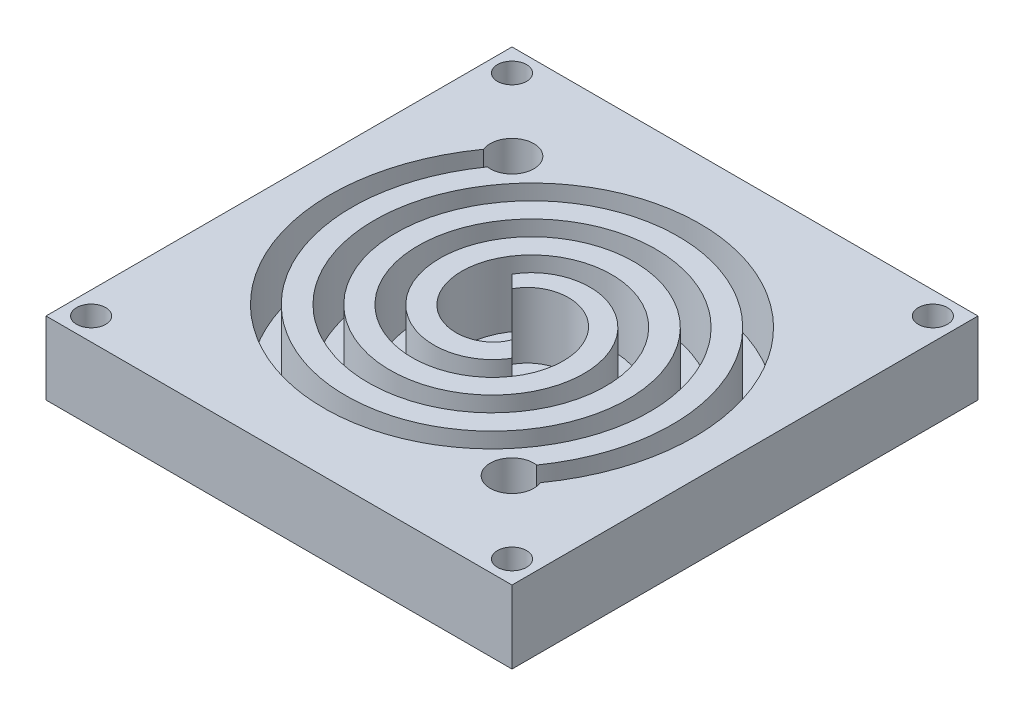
ISO-10303-21;
HEADER;
FILE_DESCRIPTION(('STEP AP214'),'2;1');
FILE_NAME('part.step','',(''),(''),'','','');
FILE_SCHEMA(('AUTOMOTIVE_DESIGN { 1 0 10303 214 1 1 1 1 }'));
ENDSEC;
DATA;
#1=APPLICATION_CONTEXT('core data for automotive mechanical design processes');
#2=APPLICATION_PROTOCOL_DEFINITION('international standard','automotive_design',2000,#1);
#3=PRODUCT_CONTEXT('',#1,'mechanical');
#4=PRODUCT('Part','Part','',(#3));
#5=PRODUCT_RELATED_PRODUCT_CATEGORY('part','',(#4));
#6=PRODUCT_DEFINITION_FORMATION('','',#4);
#7=PRODUCT_DEFINITION_CONTEXT('part definition',#1,'design');
#8=PRODUCT_DEFINITION('design','',#6,#7);
#9=PRODUCT_DEFINITION_SHAPE('','',#8);
#10=(LENGTH_UNIT() NAMED_UNIT(*) SI_UNIT(.MILLI.,.METRE.));
#11=(NAMED_UNIT(*) PLANE_ANGLE_UNIT() SI_UNIT($,.RADIAN.));
#12=(NAMED_UNIT(*) SI_UNIT($,.STERADIAN.) SOLID_ANGLE_UNIT());
#13=UNCERTAINTY_MEASURE_WITH_UNIT(LENGTH_MEASURE(1.E-05),#10,'distance_accuracy_value','');
#14=(GEOMETRIC_REPRESENTATION_CONTEXT(3) GLOBAL_UNCERTAINTY_ASSIGNED_CONTEXT((#13)) GLOBAL_UNIT_ASSIGNED_CONTEXT((#10,
#11,#12)) REPRESENTATION_CONTEXT('',''));
#15=CARTESIAN_POINT('',(0.,0.,0.));
#16=DIRECTION('',(0.,0.,1.));
#17=DIRECTION('',(1.,0.,0.));
#18=AXIS2_PLACEMENT_3D('',#15,#16,#17);
#19=CARTESIAN_POINT('',(-32.,10.,32.));
#20=DIRECTION('',(0.,1.,0.));
#21=DIRECTION('',(0.,0.,1.));
#22=AXIS2_PLACEMENT_3D('',#19,#20,#21);
#23=PLANE('',#22);
#24=CARTESIAN_POINT('',(28.9,10.,-28.9));
#25=DIRECTION('',(0.,1.,0.));
#26=DIRECTION('',(0.,0.,1.));
#27=AXIS2_PLACEMENT_3D('',#24,#25,#26);
#28=CIRCLE('',#27,2.);
#29=CARTESIAN_POINT('',(28.9,10.,-26.9));
#30=VERTEX_POINT('',#29);
#31=EDGE_CURVE('E154',#30,#30,#28,.T.);
#32=ORIENTED_EDGE('',*,*,#31,.F.);
#33=EDGE_LOOP('',(#32));
#34=FACE_BOUND('',#33,.T.);
#35=CARTESIAN_POINT('',(28.9,10.,28.9));
#36=DIRECTION('',(0.,1.,0.));
#37=DIRECTION('',(0.,0.,1.));
#38=AXIS2_PLACEMENT_3D('',#35,#36,#37);
#39=CIRCLE('',#38,2.);
#40=CARTESIAN_POINT('',(28.9,10.,30.9));
#41=VERTEX_POINT('',#40);
#42=EDGE_CURVE('E166',#41,#41,#39,.T.);
#43=ORIENTED_EDGE('',*,*,#42,.F.);
#44=EDGE_LOOP('',(#43));
#45=FACE_BOUND('',#44,.T.);
#46=CARTESIAN_POINT('',(-28.9,10.,-28.9));
#47=DIRECTION('',(0.,1.,0.));
#48=DIRECTION('',(0.,0.,1.));
#49=AXIS2_PLACEMENT_3D('',#46,#47,#48);
#50=CIRCLE('',#49,2.);
#51=CARTESIAN_POINT('',(-28.9,10.,-26.9));
#52=VERTEX_POINT('',#51);
#53=EDGE_CURVE('E178',#52,#52,#50,.T.);
#54=ORIENTED_EDGE('',*,*,#53,.F.);
#55=EDGE_LOOP('',(#54));
#56=FACE_BOUND('',#55,.T.);
#57=CARTESIAN_POINT('',(-28.9,10.,28.9));
#58=DIRECTION('',(0.,1.,0.));
#59=DIRECTION('',(0.,0.,1.));
#60=AXIS2_PLACEMENT_3D('',#57,#58,#59);
#61=CIRCLE('',#60,2.);
#62=CARTESIAN_POINT('',(-28.9,10.,30.9));
#63=VERTEX_POINT('',#62);
#64=EDGE_CURVE('E190',#63,#63,#61,.T.);
#65=ORIENTED_EDGE('',*,*,#64,.F.);
#66=EDGE_LOOP('',(#65));
#67=FACE_BOUND('',#66,.T.);
#68=DIRECTION('',(-0.707106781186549,0.,-0.707106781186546));
#69=VECTOR('',#68,1.);
#70=CARTESIAN_POINT('',(-4.965698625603,10.,-4.965698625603));
#71=LINE('',#70,#69);
#72=CARTESIAN_POINT('',(-3.23403958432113,10.,-3.23403958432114));
#73=VERTEX_POINT('',#72);
#74=CARTESIAN_POINT('',(-4.965698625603,10.,-4.965698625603));
#75=VERTEX_POINT('',#74);
#76=EDGE_CURVE('E195',#73,#75,#71,.T.);
#77=ORIENTED_EDGE('',*,*,#76,.F.);
#78=CARTESIAN_POINT('',(-20.0606193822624,10.,-20.0606193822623));
#79=CARTESIAN_POINT('',(-21.2850862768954,10.,-18.6566496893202));
#80=CARTESIAN_POINT('',(-22.3610881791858,10.,-17.1424014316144));
#81=CARTESIAN_POINT('',(-24.1871380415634,10.,-13.9517732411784));
#82=CARTESIAN_POINT('',(-24.9350531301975,10.,-12.2786531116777));
#83=CARTESIAN_POINT('',(-26.0840713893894,10.,-8.83888900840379));
#84=CARTESIAN_POINT('',(-26.4837185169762,10.,-7.07586579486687));
#85=CARTESIAN_POINT('',(-26.9294058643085,10.,-3.52675050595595));
#86=CARTESIAN_POINT('',(-26.9747288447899,10.,-1.74449547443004));
#87=CARTESIAN_POINT('',(-26.7189505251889,10.,1.77360827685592));
#88=CARTESIAN_POINT('',(-26.4178992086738,10.,3.50555276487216));
#89=CARTESIAN_POINT('',(-25.4898854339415,10.,6.85724953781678));
#90=CARTESIAN_POINT('',(-24.8637388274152,10.,8.47318227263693));
#91=CARTESIAN_POINT('',(-23.3182182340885,10.,11.5332535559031));
#92=CARTESIAN_POINT('',(-22.4003948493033,10.,12.9738059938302));
#93=CARTESIAN_POINT('',(-20.3147612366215,10.,15.6318838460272));
#94=CARTESIAN_POINT('',(-19.1491766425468,10.,16.8461964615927));
#95=CARTESIAN_POINT('',(-16.6198258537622,10.,19.0107269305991));
#96=CARTESIAN_POINT('',(-15.2588742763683,10.,19.9582308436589));
#97=CARTESIAN_POINT('',(-12.3968783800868,10.,21.5595855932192));
#98=CARTESIAN_POINT('',(-10.8991285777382,10.,22.2113276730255));
#99=CARTESIAN_POINT('',(-7.8254373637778,10.,23.2039599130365));
#100=CARTESIAN_POINT('',(-6.25314243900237,10.,23.5434294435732));
#101=CARTESIAN_POINT('',(-3.09351688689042,10.,23.9070113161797));
#102=CARTESIAN_POINT('',(-1.51004287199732,10.,23.9304474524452));
#103=CARTESIAN_POINT('',(1.61006874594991,10.,23.6699687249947));
#104=CARTESIAN_POINT('',(3.14278989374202,10.,23.386149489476));
#105=CARTESIAN_POINT('',(6.10322531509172,10.,22.5309999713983));
#106=CARTESIAN_POINT('',(7.52711619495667,10.,21.9605345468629));
#107=CARTESIAN_POINT('',(10.2176250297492,10.,20.5626333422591));
#108=CARTESIAN_POINT('',(11.4806622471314,10.,19.736799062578));
#109=CARTESIAN_POINT('',(13.8050064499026,10.,17.8678709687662));
#110=CARTESIAN_POINT('',(14.8631158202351,10.,16.8270539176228));
#111=CARTESIAN_POINT('',(16.7424925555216,10.,14.5751855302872));
#112=CARTESIAN_POINT('',(17.5610712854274,10.,13.3669983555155));
#113=CARTESIAN_POINT('',(18.9367373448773,10.,10.8326325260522));
#114=CARTESIAN_POINT('',(19.4917513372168,10.,9.50979442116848));
#115=CARTESIAN_POINT('',(20.3267638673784,10.,6.80134068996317));
#116=CARTESIAN_POINT('',(20.6053869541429,10.,5.41941208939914));
#117=CARTESIAN_POINT('',(20.8854135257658,10.,2.64866196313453));
#118=CARTESIAN_POINT('',(20.8861950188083,10.,1.26373011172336));
#119=CARTESIAN_POINT('',(20.6193853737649,10.,-1.45873073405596));
#120=CARTESIAN_POINT('',(20.3519520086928,10.,-2.79231960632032));
#121=CARTESIAN_POINT('',(19.5679025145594,10.,-5.36151489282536));
#122=CARTESIAN_POINT('',(19.0522198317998,10.,-6.59328542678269));
#123=CARTESIAN_POINT('',(17.8000981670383,10.,-8.91389269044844));
#124=CARTESIAN_POINT('',(17.0653338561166,10.,-9.9991489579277));
#125=CARTESIAN_POINT('',(15.4112642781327,10.,-11.9890292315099));
#126=CARTESIAN_POINT('',(14.4943113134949,10.,-12.8904699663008));
#127=CARTESIAN_POINT('',(12.5181487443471,10.,-14.4835524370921));
#128=CARTESIAN_POINT('',(11.4618786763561,10.,-15.1725349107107));
#129=CARTESIAN_POINT('',(9.25352172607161,10.,-16.3209563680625));
#130=CARTESIAN_POINT('',(8.10484779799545,10.,-16.7783669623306));
#131=CARTESIAN_POINT('',(5.76025595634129,10.,-17.453799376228));
#132=CARTESIAN_POINT('',(4.56809148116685,10.,-17.6705063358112));
#133=CARTESIAN_POINT('',(2.18517956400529,10.,-17.8646413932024));
#134=CARTESIAN_POINT('',(0.998379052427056,10.,-17.8415232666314));
#135=CARTESIAN_POINT('',(-1.32703757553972,10.,-17.5657186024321));
#136=CARTESIAN_POINT('',(-2.46166869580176,10.,-17.3132797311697));
#137=CARTESIAN_POINT('',(-4.63971143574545,10.,-16.5974064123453));
#138=CARTESIAN_POINT('',(-5.67846161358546,10.,-16.1353971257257));
#139=CARTESIAN_POINT('',(-8.6061411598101,10.,-14.4700736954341));
#140=CARTESIAN_POINT('',(-10.2797206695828,10.,-12.9980568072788));
#141=CARTESIAN_POINT('',(-12.8946723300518,10.,-9.58501411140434));
#142=CARTESIAN_POINT('',(-13.8172745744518,10.,-7.66824518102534));
#143=CARTESIAN_POINT('',(-14.8446179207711,10.,-3.69423912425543));
#144=CARTESIAN_POINT('',(-14.9401039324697,10.,-1.66843063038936));
#145=CARTESIAN_POINT('',(-14.3601678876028,10.,2.19870125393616));
#146=CARTESIAN_POINT('',(-13.6885607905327,10.,4.00728587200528));
#147=CARTESIAN_POINT('',(-11.7395770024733,10.,7.17231185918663));
#148=CARTESIAN_POINT('',(-10.4786960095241,10.,8.4999249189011));
#149=CARTESIAN_POINT('',(-7.59824821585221,10.,10.5312966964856));
#150=CARTESIAN_POINT('',(-6.00546980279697,10.,11.2148717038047));
#151=CARTESIAN_POINT('',(-2.74329770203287,10.,11.9023787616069));
#152=CARTESIAN_POINT('',(-1.10690770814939,10.,11.8982928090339));
#153=CARTESIAN_POINT('',(1.97450938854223,10.,11.2698980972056));
#154=CARTESIAN_POINT('',(3.38552903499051,10.,10.6514828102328));
#155=CARTESIAN_POINT('',(5.80510556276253,10.,8.94929604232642));
#156=CARTESIAN_POINT('',(6.78427839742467,10.,7.88497707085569));
#157=CARTESIAN_POINT('',(8.21564694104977,10.,5.50731422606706));
#158=CARTESIAN_POINT('',(8.64834679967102,10.,4.22448150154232));
#159=CARTESIAN_POINT('',(8.96142840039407,10.,1.64642114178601));
#160=CARTESIAN_POINT('',(8.83637254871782,10.,0.388321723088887));
#161=CARTESIAN_POINT('',(8.10258655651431,10.,-1.92376118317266));
#162=CARTESIAN_POINT('',(7.50494476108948,10.,-2.93998845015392));
#163=CARTESIAN_POINT('',(6.35262620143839,10.,-4.18813826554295));
#164=CARTESIAN_POINT('',(5.93215757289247,10.,-4.5495906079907));
#165=CARTESIAN_POINT('',(5.03784905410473,10.,-5.16231843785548));
#166=CARTESIAN_POINT('',(4.56383309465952,10.,-5.41381338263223));
#167=CARTESIAN_POINT('',(3.57621010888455,10.,-5.79974428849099));
#168=CARTESIAN_POINT('',(3.07344210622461,10.,-5.92956141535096));
#169=CARTESIAN_POINT('',(2.06661100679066,10.,-6.06940754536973));
#170=CARTESIAN_POINT('',(1.56224956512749,10.,-6.07961266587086));
#171=CARTESIAN_POINT('',(0.565940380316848,10.,-5.97728205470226));
#172=CARTESIAN_POINT('',(0.0873056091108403,10.,-5.86569087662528));
#173=CARTESIAN_POINT('',(-0.818788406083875,10.,-5.53264345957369));
#174=CARTESIAN_POINT('',(-1.24671832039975,10.,-5.31125436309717));
#175=CARTESIAN_POINT('',(-2.0364754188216,10.,-4.75701105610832));
#176=CARTESIAN_POINT('',(-2.38505150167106,10.,-4.43278252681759));
#177=CARTESIAN_POINT('',(-2.98014531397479,10.,-3.70352231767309));
#178=CARTESIAN_POINT('',(-3.22734641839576,10.,-3.2982148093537));
#179=CARTESIAN_POINT('',(-3.59697543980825,10.,-2.40877734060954));
#180=CARTESIAN_POINT('',(-3.71104612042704,10.,-1.942499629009));
#181=CARTESIAN_POINT('',(-3.78862835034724,10.,-0.988859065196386));
#182=CARTESIAN_POINT('',(-3.75276722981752,10.,-0.501231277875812));
#183=CARTESIAN_POINT('',(-3.62602904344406,10.,-0.0143638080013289));
#184=B_SPLINE_CURVE_WITH_KNOTS('',3,(#78,#79,#80,#81,#82,#83,#84,#85,#86,#87,#88,#89,#90,#91,
#92,#93,#94,#95,#96,#97,#98,#99,#100,#101,#102,#103,#104,#105,#106,#107,#108,#109,#110,#111,
#112,#113,#114,#115,#116,#117,#118,#119,#120,#121,#122,#123,#124,#125,#126,#127,#128,#129,#130,
#131,#132,#133,#134,#135,#136,#137,#138,#139,#140,#141,#142,#143,#144,#145,#146,#147,#148,#149,
#150,#151,#152,#153,#154,#155,#156,#157,#158,#159,#160,#161,#162,#163,#164,#165,#166,#167,#168,
#169,#170,#171,#172,#173,#174,#175,#176,#177,#178,#179,#180,#181,#182,#183),.UNSPECIFIED.,.F.,
.F.,(4,2,2,2,2,2,2,2,2,2,2,2,2,2,2,2,2,2,2,2,2,2,2,2,2,2,2,2,2,2,2,2,2,2,2,2,2,2,2,2,2,2,2,2,2,
2,2,2,2,2,2,2,4),(0.,0.015625,0.03125,0.046875,0.0625,0.078125,0.09375,0.109375,0.125,0.140625,
0.15625,0.171875,0.1875,0.203125,0.21875,0.234375,0.25,0.265625,0.28125,0.296875,0.3125,
0.328125,0.34375,0.359375,0.375,0.390625,0.40625,0.421875,0.4375,0.453125,0.46875,0.5,0.53125,
0.5625,0.59375,0.625,0.65625,0.6875,0.71875,0.75,0.78125,0.8125,0.84375,0.859375,0.875,0.890625,
0.90625,0.921875,0.9375,0.953125,0.96875,0.984375,1.),.UNSPECIFIED.);
#185=CARTESIAN_POINT('',(-21.7823469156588,10.,-17.878150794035));
#186=VERTEX_POINT('',#185);
#187=EDGE_CURVE('E226',#186,#73,#184,.T.);
#188=ORIENTED_EDGE('',*,*,#187,.F.);
#189=CARTESIAN_POINT('',(-19.,10.,-19.));
#190=DIRECTION('',(0.,1.,0.));
#191=DIRECTION('',(0.,0.,1.));
#192=AXIS2_PLACEMENT_3D('',#189,#190,#191);
#193=CIRCLE('',#192,3.);
#194=CARTESIAN_POINT('',(-19.4244168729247,10.,-16.030173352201));
#195=VERTEX_POINT('',#194);
#196=EDGE_CURVE('E265',#195,#186,#193,.T.);
#197=ORIENTED_EDGE('',*,*,#196,.F.);
#198=CARTESIAN_POINT('',(-17.9392990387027,10.,-17.9392990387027));
#199=CARTESIAN_POINT('',(-19.0236724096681,10.,-16.6754236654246));
#200=CARTESIAN_POINT('',(-19.9746544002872,10.,-15.3136852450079));
#201=CARTESIAN_POINT('',(-21.5808976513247,10.,-12.4528469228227));
#202=CARTESIAN_POINT('',(-22.2361400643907,10.,-10.9538316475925));
#203=CARTESIAN_POINT('',(-23.2343234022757,10.,-7.88065100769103));
#204=CARTESIAN_POINT('',(-23.5772628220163,10.,-6.3065711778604));
#205=CARTESIAN_POINT('',(-23.9469944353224,10.,-3.14659134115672));
#206=CARTESIAN_POINT('',(-23.973802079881,10.,-1.56077431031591));
#207=CARTESIAN_POINT('',(-23.719947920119,10.,1.56077431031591));
#208=CARTESIAN_POINT('',(-23.4393174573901,10.,3.09642876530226));
#209=CARTESIAN_POINT('',(-22.5910812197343,10.,6.05958680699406));
#210=CARTESIAN_POINT('',(-22.0235209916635,10.,7.4870220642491));
#211=CARTESIAN_POINT('',(-20.6325744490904,10.,10.1817111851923));
#212=CARTESIAN_POINT('',(-19.8092456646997,10.,11.4489080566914));
#213=CARTESIAN_POINT('',(-17.9470099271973,10.,13.7790153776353));
#214=CARTESIAN_POINT('',(-16.9081698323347,10.,14.8418821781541));
#215=CARTESIAN_POINT('',(-14.6623801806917,10.,16.7286678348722));
#216=CARTESIAN_POINT('',(-13.4555038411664,10.,17.5525577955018));
#217=CARTESIAN_POINT('',(-10.9262166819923,10.,18.9372656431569));
#218=CARTESIAN_POINT('',(-9.60388228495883,10.,19.4980701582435));
#219=CARTESIAN_POINT('',(-6.89910155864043,10.,20.3436572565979));
#220=CARTESIAN_POINT('',(-5.51673165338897,10.,20.6284421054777));
#221=CARTESIAN_POINT('',(-2.74784307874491,10.,20.9203808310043));
#222=CARTESIAN_POINT('',(-1.36139771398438,10.,20.9275520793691));
#223=CARTESIAN_POINT('',(1.36139771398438,10.,20.6736979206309));
#224=CARTESIAN_POINT('',(2.6976805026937,10.,20.4127038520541));
#225=CARTESIAN_POINT('',(5.26974728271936,10.,19.6422605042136));
#226=CARTESIAN_POINT('',(6.50547261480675,10.,19.1328548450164));
#227=CARTESIAN_POINT('',(8.83176182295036,10.,17.8945045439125));
#228=CARTESIAN_POINT('',(9.92227781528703,10.,17.1656136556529));
#229=CARTESIAN_POINT('',(11.9208339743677,10.,15.5249133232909));
#230=CARTESIAN_POINT('',(12.8288386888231,10.,14.6131652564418));
#231=CARTESIAN_POINT('',(14.4336632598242,10.,12.6493366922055));
#232=CARTESIAN_POINT('',(15.1304611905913,10.,11.5973224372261));
#233=CARTESIAN_POINT('',(16.2936336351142,10.,9.39958644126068));
#234=CARTESIAN_POINT('',(16.760000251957,10.,8.25393292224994));
#235=CARTESIAN_POINT('',(17.4529911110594,10.,5.91755210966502));
#236=CARTESIAN_POINT('',(17.6796213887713,10.,4.72689212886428));
#237=CARTESIAN_POINT('',(17.893767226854,10.,2.34909481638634));
#238=CARTESIAN_POINT('',(17.8813020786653,10.,1.16202111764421));
#239=CARTESIAN_POINT('',(17.6274479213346,10.,-1.16202111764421));
#240=CARTESIAN_POINT('',(17.3860902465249,10.,-2.2989322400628));
#241=CARTESIAN_POINT('',(16.6934397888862,10.,-4.47990775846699));
#242=CARTESIAN_POINT('',(16.2421886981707,10.,-5.52392316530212));
#243=CARTESIAN_POINT('',(15.1564346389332,10.,-7.48181246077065));
#244=CARTESIAN_POINT('',(14.5219816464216,10.,-8.3956475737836));
#245=CARTESIAN_POINT('',(13.1028167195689,10.,-10.0626525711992));
#246=CARTESIAN_POINT('',(12.3181606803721,10.,-10.8157951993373));
#247=CARTESIAN_POINT('',(10.6362932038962,10.,-12.138658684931));
#248=CARTESIAN_POINT('',(9.7391410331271,10.,-12.7083645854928));
#249=CARTESIAN_POINT('',(7.87295620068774,10.,-13.6500016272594));
#250=CARTESIAN_POINT('',(6.90398355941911,10.,-14.0219303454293));
#251=CARTESIAN_POINT('',(4.93600266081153,10.,-14.5623249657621));
#252=CARTESIAN_POINT('',(3.93705260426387,10.,-14.7308006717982));
#253=CARTESIAN_POINT('',(1.95034655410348,10.,-14.8671536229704));
#254=CARTESIAN_POINT('',(0.962644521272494,10.,-14.8350520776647));
#255=CARTESIAN_POINT('',(-0.962644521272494,10.,-14.5811979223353));
#256=CARTESIAN_POINT('',(-1.90018397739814,10.,-14.3594766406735));
#257=CARTESIAN_POINT('',(-3.69006823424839,10.,-13.7446190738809));
#258=CARTESIAN_POINT('',(-4.54237387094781,10.,-13.3515226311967));
#259=CARTESIAN_POINT('',(-6.92660747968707,10.,-11.951785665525));
#260=CARTESIAN_POINT('',(-8.28230053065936,10.,-10.7231091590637));
#261=CARTESIAN_POINT('',(-10.3641052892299,10.,-7.92329666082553));
#262=CARTESIAN_POINT('',(-11.0899612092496,10.,-6.35382455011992));
#263=CARTESIAN_POINT('',(-11.8655580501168,10.,-3.15466285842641));
#264=CARTESIAN_POINT('',(-11.9157290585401,10.,-1.52653573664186));
#265=CARTESIAN_POINT('',(-11.4080209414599,10.,1.52653573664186));
#266=CARTESIAN_POINT('',(-10.8511370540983,10.,2.95027959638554));
#267=CARTESIAN_POINT('',(-9.29001417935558,10.,5.39245840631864));
#268=CARTESIAN_POINT('',(-8.28712402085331,10.,6.41023756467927));
#269=CARTESIAN_POINT('',(-6.05123373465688,10.,7.92812019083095));
#270=CARTESIAN_POINT('',(-4.81967521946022,10.,8.42818939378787));
#271=CARTESIAN_POINT('',(-2.35731337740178,10.,8.89859381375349));
#272=CARTESIAN_POINT('',(-1.12778254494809,10.,8.8694790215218));
#273=CARTESIAN_POINT('',(1.12778254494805,10.,8.36177097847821));
#274=CARTESIAN_POINT('',(2.1529300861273,10.,7.88417274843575));
#275=CARTESIAN_POINT('',(3.85830910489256,10.,6.6282424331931));
#276=CARTESIAN_POINT('',(4.53817458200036,10.,5.85113886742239));
#277=CARTESIAN_POINT('',(5.49213510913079,10.,4.17917082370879));
#278=CARTESIAN_POINT('',(5.76641755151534,10.,3.28552587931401));
#279=CARTESIAN_POINT('',(5.93162960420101,10.,1.5599639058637));
#280=CARTESIAN_POINT('',(5.82322894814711,10.,0.729029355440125));
#281=CARTESIAN_POINT('',(5.31552105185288,10.,-0.729029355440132));
#282=CARTESIAN_POINT('',(4.91720840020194,10.,-1.35558055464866));
#283=CARTESIAN_POINT('',(4.20415514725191,10.,-2.08201500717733));
#284=CARTESIAN_POINT('',(3.94748360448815,10.,-2.28857538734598));
#285=CARTESIAN_POINT('',(3.41447730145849,10.,-2.62937849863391));
#286=CARTESIAN_POINT('',(3.13814224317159,10.,-2.76362118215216));
#287=CARTESIAN_POINT('',(2.58411938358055,10.,-2.95864044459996));
#288=CARTESIAN_POINT('',(2.30668071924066,10.,-3.01951915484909));
#289=CARTESIAN_POINT('',(1.76671416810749,10.,-3.07502432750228));
#290=CARTESIAN_POINT('',(1.50418600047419,10.,-3.0696505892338));
#291=CARTESIAN_POINT('',(1.00980497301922,10.,-2.99966051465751));
#292=CARTESIAN_POINT('',(0.778125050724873,10.,-2.93524127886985));
#293=CARTESIAN_POINT('',(0.355791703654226,10.,-2.7604371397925));
#294=CARTESIAN_POINT('',(0.165138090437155,9.99999999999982,-2.65005187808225));
#295=CARTESIAN_POINT('',(-0.165138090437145,10.0000000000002,-2.39619812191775));
#296=CARTESIAN_POINT('',(-0.304695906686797,10.,-2.25297776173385));
#297=CARTESIAN_POINT('',(-0.530214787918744,10.,-1.94930780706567));
#298=CARTESIAN_POINT('',(-0.616175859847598,10.,-1.78885772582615));
#299=CARTESIAN_POINT('',(-0.732065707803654,10.,-1.46608535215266));
#300=CARTESIAN_POINT('',(-0.762047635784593,10.,-1.30400941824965));
#301=CARTESIAN_POINT('',(-0.771303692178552,10.,-0.992535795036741));
#302=CARTESIAN_POINT('',(-0.750577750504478,10.,-0.84313780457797));
#303=CARTESIAN_POINT('',(-0.707106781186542,10.,-0.707106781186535));
#304=B_SPLINE_CURVE_WITH_KNOTS('',3,(#198,#199,#200,#201,#202,#203,#204,#205,#206,#207,#208,
#209,#210,#211,#212,#213,#214,#215,#216,#217,#218,#219,#220,#221,#222,#223,#224,#225,#226,#227,
#228,#229,#230,#231,#232,#233,#234,#235,#236,#237,#238,#239,#240,#241,#242,#243,#244,#245,#246,
#247,#248,#249,#250,#251,#252,#253,#254,#255,#256,#257,#258,#259,#260,#261,#262,#263,#264,#265,
#266,#267,#268,#269,#270,#271,#272,#273,#274,#275,#276,#277,#278,#279,#280,#281,#282,#283,#284,
#285,#286,#287,#288,#289,#290,#291,#292,#293,#294,#295,#296,#297,#298,#299,#300,#301,#302,#303),
.UNSPECIFIED.,.F.,.F.,(4,2,2,2,2,2,2,2,2,2,2,2,2,2,2,2,2,2,2,2,2,2,2,2,2,2,2,2,2,2,2,2,2,2,2,2,
2,2,2,2,2,2,2,2,2,2,2,2,2,2,2,2,4),(0.,0.015625,0.03125,0.046875,0.0625,0.078125,0.09375,
0.109375,0.125,0.140625,0.15625,0.171875,0.1875,0.203125,0.21875,0.234375,0.25,0.265625,0.28125,
0.296875,0.3125,0.328125,0.34375,0.359375,0.375,0.390625,0.40625,0.421875,0.4375,0.453125,
0.46875,0.5,0.53125,0.5625,0.59375,0.625,0.65625,0.6875,0.71875,0.75,0.78125,0.8125,0.84375,
0.859375,0.875,0.890625,0.90625,0.921875,0.9375,0.953125,0.96875,0.984375,1.),.UNSPECIFIED.);
#305=CARTESIAN_POINT('',(5.01515484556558,10.,5.01515484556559));
#306=VERTEX_POINT('',#305);
#307=EDGE_CURVE('E206',#195,#306,#304,.T.);
#308=ORIENTED_EDGE('',*,*,#307,.T.);
#309=DIRECTION('',(0.707106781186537,0.,0.707106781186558));
#310=VECTOR('',#309,1.);
#311=CARTESIAN_POINT('',(2.8284271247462,10.,2.82842712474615));
#312=LINE('',#311,#310);
#313=CARTESIAN_POINT('',(2.8284271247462,10.,2.82842712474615));
#314=VERTEX_POINT('',#313);
#315=EDGE_CURVE('E193',#314,#306,#312,.T.);
#316=ORIENTED_EDGE('',*,*,#315,.F.);
#317=CARTESIAN_POINT('',(20.0606193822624,10.,20.0606193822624));
#318=CARTESIAN_POINT('',(21.2838328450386,10.0000000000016,18.6579039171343));
#319=CARTESIAN_POINT('',(22.3599772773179,10.,17.1436546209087));
#320=CARTESIAN_POINT('',(24.1843924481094,10.,13.9562989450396));
#321=CARTESIAN_POINT('',(24.9326389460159,10.,12.283285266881));
#322=CARTESIAN_POINT('',(26.0811017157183,10.,8.84729798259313));
#323=CARTESIAN_POINT('',(26.4813127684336,10.,7.08441888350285));
#324=CARTESIAN_POINT('',(26.9276561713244,10.,3.53928556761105));
#325=CARTESIAN_POINT('',(26.9738020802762,10.,1.75712385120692));
#326=CARTESIAN_POINT('',(26.7199479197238,10.,-1.75712385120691));
#327=CARTESIAN_POINT('',(26.4199791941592,10.,-3.48912299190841));
#328=CARTESIAN_POINT('',(25.4951311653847,10.,-6.83743451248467));
#329=CARTESIAN_POINT('',(24.8702993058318,10.,-8.45366903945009));
#330=CARTESIAN_POINT('',(23.3290733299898,10.,-11.5111648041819));
#331=CARTESIAN_POINT('',(22.4127404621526,10.,-12.9523600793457));
#332=CARTESIAN_POINT('',(20.3323328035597,10.,-15.6089847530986));
#333=CARTESIAN_POINT('',(19.1683302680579,10.,-16.824362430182));
#334=CARTESIAN_POINT('',(16.6448604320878,10.,-18.9888282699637));
#335=CARTESIAN_POINT('',(15.2854732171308,10.,-19.9378806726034));
#336=CARTESIAN_POINT('',(12.4296687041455,10.,-21.5407604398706));
#337=CARTESIAN_POINT('',(10.9333359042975,10.,-22.1945690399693));
#338=CARTESIAN_POINT('',(7.86574853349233,10.,-23.1904355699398));
#339=CARTESIAN_POINT('',(6.29457935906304,10.,-23.5324920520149));
#340=CARTESIAN_POINT('',(3.14053730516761,10.,-23.9010425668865));
#341=CARTESIAN_POINT('',(1.55774725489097,10.,-23.9275520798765));
#342=CARTESIAN_POINT('',(-1.55774725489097,10.,-23.6736979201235));
#343=CARTESIAN_POINT('',(-3.09037472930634,10.,-23.3933655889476));
#344=CARTESIAN_POINT('',(-6.04759498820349,10.,-22.5463104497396));
#345=CARTESIAN_POINT('',(-7.47211959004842,10.,-21.9796331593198));
#346=CARTESIAN_POINT('',(-10.1612154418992,10.,-20.5910034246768));
#347=CARTESIAN_POINT('',(-11.425729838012,10.,-19.7691084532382));
#348=CARTESIAN_POINT('',(-13.7508033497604,10.,-17.9102361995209));
#349=CARTESIAN_POINT('',(-14.8113189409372,10.,-16.8733256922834));
#350=CARTESIAN_POINT('',(-16.6938236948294,10.,-14.6318169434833));
#351=CARTESIAN_POINT('',(-17.515784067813,10.,-13.4272918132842));
#352=CARTESIAN_POINT('',(-18.8971284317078,10.,-10.9030384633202));
#353=CARTESIAN_POINT('',(-19.4564991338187,10.,-9.58338654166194));
#354=CARTESIAN_POINT('',(-20.2997694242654,10.,-6.88419908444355));
#355=CARTESIAN_POINT('',(-20.5836713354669,10.,-5.5047398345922));
#356=CARTESIAN_POINT('',(-20.8744289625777,10.,-2.74178904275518));
#357=CARTESIAN_POINT('',(-20.8813020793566,10.,-1.3583706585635));
#358=CARTESIAN_POINT('',(-20.6274479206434,10.,1.3583706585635));
#359=CARTESIAN_POINT('',(-20.3667519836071,10.,2.69162646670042));
#360=CARTESIAN_POINT('',(-19.5974897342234,10.,5.25775546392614));
#361=CARTESIAN_POINT('',(-19.0889670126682,10.,6.49057014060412));
#362=CARTESIAN_POINT('',(-17.8529335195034,10.,8.81126607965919));
#363=CARTESIAN_POINT('',(-17.1254764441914,10.,9.89909959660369));
#364=CARTESIAN_POINT('',(-15.4881395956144,10.,11.8926219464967));
#365=CARTESIAN_POINT('',(-14.5783211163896,10.,12.7982754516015));
#366=CARTESIAN_POINT('',(-12.618773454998,10.,14.3988191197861));
#367=CARTESIAN_POINT('',(-11.5691104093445,10.,15.0936874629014));
#368=CARTESIAN_POINT('',(-9.376408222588,10.,16.2534964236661));
#369=CARTESIAN_POINT('',(-8.23343717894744,10.,16.7184292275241));
#370=CARTESIAN_POINT('',(-5.90264963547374,10.,17.409103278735));
#371=CARTESIAN_POINT('',(-4.71490031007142,10.,17.634850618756));
#372=CARTESIAN_POINT('',(-2.34304078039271,10.,17.847815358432));
#373=CARTESIAN_POINT('',(-1.1589940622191,10.,17.8350520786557));
#374=CARTESIAN_POINT('',(1.15899406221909,10.,17.5811979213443));
#375=CARTESIAN_POINT('',(2.29287820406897,10.,17.3401383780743));
#376=CARTESIAN_POINT('',(4.46791593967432,10.,16.6486690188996));
#377=CARTESIAN_POINT('',(5.50902069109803,10.,16.1983008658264));
#378=CARTESIAN_POINT('',(7.46131671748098,10.,15.1148636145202));
#379=CARTESIAN_POINT('',(8.3724693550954,10.,14.4818444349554));
#380=CARTESIAN_POINT('',(10.0344405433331,10.,13.0660429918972));
#381=CARTESIAN_POINT('',(10.7852319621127,10.,12.2833165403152));
#382=CARTESIAN_POINT('',(12.1038145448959,10.,10.6057299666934));
#383=CARTESIAN_POINT('',(12.6715908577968,10.,9.71092900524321));
#384=CARTESIAN_POINT('',(13.6098644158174,10.,7.84977798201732));
#385=CARTESIAN_POINT('',(13.9803593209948,10.,6.88348781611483));
#386=CARTESIAN_POINT('',(14.5184371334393,10.,4.92110018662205));
#387=CARTESIAN_POINT('',(14.6860299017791,10.,3.92506078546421));
#388=CARTESIAN_POINT('',(14.8212017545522,10.,1.94429251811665));
#389=CARTESIAN_POINT('',(14.7888020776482,10.,0.959617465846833));
#390=CARTESIAN_POINT('',(14.5349479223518,10.,-0.959617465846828));
#391=CARTESIAN_POINT('',(14.3135247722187,10.,-1.89412994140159));
#392=CARTESIAN_POINT('',(13.6998483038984,10.,-3.67807641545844));
#393=CARTESIAN_POINT('',(13.3076347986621,10.,-4.52747139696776));
#394=CARTESIAN_POINT('',(11.9113730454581,10.,-6.90331510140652));
#395=CARTESIAN_POINT('',(10.6861245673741,10.,-8.25387774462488));
#396=CARTESIAN_POINT('',(7.8948738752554,10.,-10.3271206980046));
#397=CARTESIAN_POINT('',(6.33053217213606,10.,-11.0495485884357));
#398=CARTESIAN_POINT('',(3.14255701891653,10.,-11.8205118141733));
#399=CARTESIAN_POINT('',(1.52048162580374,10.,-11.8694790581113));
#400=CARTESIAN_POINT('',(-1.5204816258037,10.,-11.3617709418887));
#401=CARTESIAN_POINT('',(-2.93817375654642,10.,-10.8060908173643));
#402=CARTESIAN_POINT('',(-5.36916602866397,10.,-9.2496015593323));
#403=CARTESIAN_POINT('',(-6.38181477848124,10.,-8.25013942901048));
#404=CARTESIAN_POINT('',(-7.8911355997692,10.,-6.02281094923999));
#405=CARTESIAN_POINT('',(-8.38777677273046,10.,-4.79638284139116));
#406=CARTESIAN_POINT('',(-8.85354757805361,10.,-2.34520753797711));
#407=CARTESIAN_POINT('',(-8.82322902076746,10.,-1.1217284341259));
#408=CARTESIAN_POINT('',(-8.31552097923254,10.,1.1217284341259));
#409=CARTESIAN_POINT('',(-7.8391265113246,10.,2.1408242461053));
#410=CARTESIAN_POINT('',(-6.58782981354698,10.,3.83501672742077));
#411=CARTESIAN_POINT('',(-5.81415427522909,10.,4.50975179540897));
#412=CARTESIAN_POINT('',(-4.15074803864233,10.,5.45515051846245));
#413=CARTESIAN_POINT('',(-3.26223350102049,10.,5.72600492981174));
#414=CARTESIAN_POINT('',(-1.54785806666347,10.,5.88658336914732));
#415=CARTESIAN_POINT('',(-0.722975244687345,10.,5.7769789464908));
#416=CARTESIAN_POINT('',(0.722975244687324,10.,5.2692710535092));
#417=CARTESIAN_POINT('',(1.34347471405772,10.,4.87216216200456));
#418=CARTESIAN_POINT('',(2.30086744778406,10.,3.926058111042));
#419=CARTESIAN_POINT('',(2.63768895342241,10.,3.37816918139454));
#420=CARTESIAN_POINT('',(2.82842712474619,10.,2.82842712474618));
#421=B_SPLINE_CURVE_WITH_KNOTS('',3,(#317,#318,#319,#320,#321,#322,#323,#324,#325,#326,#327,
#328,#329,#330,#331,#332,#333,#334,#335,#336,#337,#338,#339,#340,#341,#342,#343,#344,#345,#346,
#347,#348,#349,#350,#351,#352,#353,#354,#355,#356,#357,#358,#359,#360,#361,#362,#363,#364,#365,
#366,#367,#368,#369,#370,#371,#372,#373,#374,#375,#376,#377,#378,#379,#380,#381,#382,#383,#384,
#385,#386,#387,#388,#389,#390,#391,#392,#393,#394,#395,#396,#397,#398,#399,#400,#401,#402,#403,
#404,#405,#406,#407,#408,#409,#410,#411,#412,#413,#414,#415,#416,#417,#418,#419,#420),
.UNSPECIFIED.,.F.,.F.,(4,2,2,2,2,2,2,2,2,2,2,2,2,2,2,2,2,2,2,2,2,2,2,2,2,2,2,2,2,2,2,2,2,2,2,2,
2,2,2,2,2,2,2,2,2,2,2,2,2,2,2,4),(0.,0.015625,0.03125,0.046875,0.0625,0.078125,0.09375,0.109375,
0.125,0.140625,0.15625,0.171875,0.1875,0.203125,0.21875,0.234375,0.25,0.265625,0.28125,0.296875,
0.3125,0.328125,0.34375,0.359375,0.375,0.390625,0.40625,0.421875,0.4375,0.453125,0.46875,
0.484375,0.5,0.515625,0.53125,0.546875,0.5625,0.578125,0.59375,0.625,0.65625,0.6875,0.71875,
0.75,0.78125,0.8125,0.84375,0.875,0.90625,0.9375,0.96875,1.),.UNSPECIFIED.);
#422=CARTESIAN_POINT('',(21.7822740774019,10.0000000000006,17.877970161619));
#423=VERTEX_POINT('',#422);
#424=EDGE_CURVE('E234',#423,#314,#421,.T.);
#425=ORIENTED_EDGE('',*,*,#424,.F.);
#426=CARTESIAN_POINT('',(19.,10.,19.));
#427=DIRECTION('',(0.,1.,0.));
#428=DIRECTION('',(0.,0.,1.));
#429=AXIS2_PLACEMENT_3D('',#426,#427,#428);
#430=CIRCLE('',#429,3.);
#431=CARTESIAN_POINT('',(19.4242505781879,10.,16.0301495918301));
#432=VERTEX_POINT('',#431);
#433=EDGE_CURVE('E259',#432,#423,#430,.T.);
#434=ORIENTED_EDGE('',*,*,#433,.F.);
#435=CARTESIAN_POINT('',(17.9392990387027,10.,17.9392990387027));
#436=CARTESIAN_POINT('',(19.0225805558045,10.,16.6765163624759));
#437=CARTESIAN_POINT('',(19.973835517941,10.,15.3145833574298));
#438=CARTESIAN_POINT('',(21.5786332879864,10.,12.4565678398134));
#439=CARTESIAN_POINT('',(22.2342600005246,10.,10.9574136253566));
#440=CARTESIAN_POINT('',(23.2319043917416,10.,7.88747552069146));
#441=CARTESIAN_POINT('',(23.5753677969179,10.,6.31326444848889));
#442=CARTESIAN_POINT('',(23.9455726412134,10.,3.15669810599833));
#443=CARTESIAN_POINT('',(23.9730602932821,10.,1.57069604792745));
#444=CARTESIAN_POINT('',(23.7207343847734,10.,-1.54754146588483));
#445=CARTESIAN_POINT('',(23.4409374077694,10.,-3.08350201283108));
#446=CARTESIAN_POINT('',(22.5952590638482,10.,-6.04373422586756));
#447=CARTESIAN_POINT('',(22.0286627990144,10.,-7.47166467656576));
#448=CARTESIAN_POINT('',(20.6412082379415,10.,-10.1640895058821));
#449=CARTESIAN_POINT('',(19.8189301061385,10.,-11.4320340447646));
#450=CARTESIAN_POINT('',(17.960956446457,10.,-13.7607916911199));
#451=CARTESIAN_POINT('',(16.9231901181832,10.,-14.8247118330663));
#452=CARTESIAN_POINT('',(14.6822057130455,10.,-16.7112762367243));
#453=CARTESIAN_POINT('',(13.4763452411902,10.,-17.5365629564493));
#454=CARTESIAN_POINT('',(10.9521257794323,10.,-18.9223376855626));
#455=CARTESIAN_POINT('',(9.63065454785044,10.,-19.4848999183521));
#456=CARTESIAN_POINT('',(6.93088196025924,10.,-20.3329349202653));
#457=CARTESIAN_POINT('',(5.54911874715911,10.,-20.6198318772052));
#458=CARTESIAN_POINT('',(2.78483083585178,10.,-20.9156156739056));
#459=CARTESIAN_POINT('',(1.39862875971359,10.,-20.9252199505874));
#460=CARTESIAN_POINT('',(-1.32032965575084,10.,-20.6765409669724));
#461=CARTESIAN_POINT('',(-2.65683610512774,10.,-20.4182390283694));
#462=CARTESIAN_POINT('',(-5.22617480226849,10.,-19.6541481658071));
#463=CARTESIAN_POINT('',(-6.46268392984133,10.,-19.14760364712));
#464=CARTESIAN_POINT('',(-8.78766856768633,10.,-17.9165463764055));
#465=CARTESIAN_POINT('',(-9.87960425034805,10.,-17.1905689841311));
#466=CARTESIAN_POINT('',(-11.8785437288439,10.,-15.557787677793));
#467=CARTESIAN_POINT('',(-12.7886555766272,10.,-14.6488656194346));
#468=CARTESIAN_POINT('',(-14.395747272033,10.,-12.6932003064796));
#469=CARTESIAN_POINT('',(-15.0953609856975,10.,-11.6437665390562));
#470=CARTESIAN_POINT('',(-16.26279576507,10.,-9.45400371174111));
#471=CARTESIAN_POINT('',(-16.7326725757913,10.,-8.31051542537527));
#472=CARTESIAN_POINT('',(-17.4319349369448,10.,-5.98144919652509));
#473=CARTESIAN_POINT('',(-17.662716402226,10.,-4.79236553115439));
#474=CARTESIAN_POINT('',(-17.8850503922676,10.,-2.42074287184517));
#475=CARTESIAN_POINT('',(-17.8772827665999,10.,-1.2344877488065));
#476=CARTESIAN_POINT('',(-17.6333299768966,10.,1.08499041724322));
#477=CARTESIAN_POINT('',(-17.3970801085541,10.,2.22199527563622));
#478=CARTESIAN_POINT('',(-16.7157305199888,10.,4.40045251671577));
#479=CARTESIAN_POINT('',(-16.2698220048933,10.,5.44560464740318));
#480=CARTESIAN_POINT('',(-15.196350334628,10.,7.40339632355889));
#481=CARTESIAN_POINT('',(-14.5672637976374,10.,8.31950849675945));
#482=CARTESIAN_POINT('',(-13.1608519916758,10.,9.98912715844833));
#483=CARTESIAN_POINT('',(-12.381346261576,10.,10.7457424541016));
#484=CARTESIAN_POINT('',(-10.7121157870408,10.,12.0741155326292));
#485=CARTESIAN_POINT('',(-9.81963688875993,10.,12.6484953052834));
#486=CARTESIAN_POINT('',(-7.96533164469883,10.,13.5985980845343));
#487=CARTESIAN_POINT('',(-7.00028358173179,10.,13.9763518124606));
#488=CARTESIAN_POINT('',(-5.04275497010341,10.,14.5280899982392));
#489=CARTESIAN_POINT('',(-4.04670998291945,10.,14.7034321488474));
#490=CARTESIAN_POINT('',(-2.06835965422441,10.,14.8537808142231));
#491=CARTESIAN_POINT('',(-1.08228593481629,10.,14.8294162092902));
#492=CARTESIAN_POINT('',(0.83738106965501,10.,14.5918340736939));
#493=CARTESIAN_POINT('',(1.77479928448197,10.,14.3784890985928));
#494=CARTESIAN_POINT('',(3.5623675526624,10.,13.7816576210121));
#495=CARTESIAN_POINT('',(4.41624878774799,10.,13.3972893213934));
#496=CARTESIAN_POINT('',(6.00720349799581,10.,12.4832536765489));
#497=CARTESIAN_POINT('',(6.74776702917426,10.,11.951981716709));
#498=CARTESIAN_POINT('',(8.08881499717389,10.,10.773794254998));
#499=CARTESIAN_POINT('',(8.69240966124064,10.,10.1246113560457));
#500=CARTESIAN_POINT('',(9.74322712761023,10.,8.74359669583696));
#501=CARTESIAN_POINT('',(10.1930557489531,10.,8.00892111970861));
#502=CARTESIAN_POINT('',(10.9274070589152,10.,6.49169489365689));
#503=CARTESIAN_POINT('',(11.2139256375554,10.,5.70583350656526));
#504=CARTESIAN_POINT('',(11.6201261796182,10.,4.12121354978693));
#505=CARTESIAN_POINT('',(11.7411118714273,10.,3.31880583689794));
#506=CARTESIAN_POINT('',(11.8218382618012,10.,1.73475510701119));
#507=CARTESIAN_POINT('',(11.7821349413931,10.,0.949267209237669));
#508=CARTESIAN_POINT('',(11.553614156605,10.,-0.569997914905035));
#509=CARTESIAN_POINT('',(11.3645783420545,10.,-1.30766438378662));
#510=CARTESIAN_POINT('',(10.8552140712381,10.,-2.70427818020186));
#511=CARTESIAN_POINT('',(10.5335006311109,10.,-3.36779811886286));
#512=CARTESIAN_POINT('',(9.40746524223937,10.,-5.20240551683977));
#513=CARTESIAN_POINT('',(8.42828816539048,10.,-6.23712362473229));
#514=CARTESIAN_POINT('',(6.25489299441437,10.,-7.7824035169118));
#515=CARTESIAN_POINT('',(5.03957584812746,10.,-8.31104000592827));
#516=CARTESIAN_POINT('',(2.62871903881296,10.,-8.83689513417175));
#517=CARTESIAN_POINT('',(1.40477474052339,10.,-8.84397761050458));
#518=CARTESIAN_POINT('',(-0.822616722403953,10.,-8.41558150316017));
#519=CARTESIAN_POINT('',(-1.85639849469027,10.,-7.97800261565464));
#520=CARTESIAN_POINT('',(-3.56779374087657,10.,-6.81580224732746));
#521=CARTESIAN_POINT('',(-4.27281316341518,10.,-6.07712350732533));
#522=CARTESIAN_POINT('',(-5.27423595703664,10.,-4.49909083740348));
#523=CARTESIAN_POINT('',(-5.59054786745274,10.,-3.6356289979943));
#524=CARTESIAN_POINT('',(-5.84636157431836,10.,-1.98649846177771));
#525=CARTESIAN_POINT('',(-5.7947042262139,10.,-1.17025825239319));
#526=CARTESIAN_POINT('',(-5.41533521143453,10.,0.248091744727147));
#527=CARTESIAN_POINT('',(-5.08340819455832,10.,0.882435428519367));
#528=CARTESIAN_POINT('',(-4.28535705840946,10.,1.86622363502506));
#529=CARTESIAN_POINT('',(-3.80193247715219,10.,2.24419681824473));
#530=CARTESIAN_POINT('',(-2.84940193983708,10.,2.71867912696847));
#531=CARTESIAN_POINT('',(-2.35196945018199,10.,2.83481464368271));
#532=CARTESIAN_POINT('',(-1.4924729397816,10.,2.85598999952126));
#533=CARTESIAN_POINT('',(-1.09508482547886,10.,2.76745512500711));
#534=CARTESIAN_POINT('',(-0.501976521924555,10.,2.49524967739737));
#535=CARTESIAN_POINT('',(-0.269622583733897,10.,2.30204274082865));
#536=CARTESIAN_POINT('',(-0.00257100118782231,10.,1.95076800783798));
#537=CARTESIAN_POINT('',(0.0635281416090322,10.,1.76748427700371));
#538=CARTESIAN_POINT('',(0.0678384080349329,10.,1.65405497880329));
#539=B_SPLINE_CURVE_WITH_KNOTS('',3,(#435,#436,#437,#438,#439,#440,#441,#442,#443,#444,#445,
#446,#447,#448,#449,#450,#451,#452,#453,#454,#455,#456,#457,#458,#459,#460,#461,#462,#463,#464,
#465,#466,#467,#468,#469,#470,#471,#472,#473,#474,#475,#476,#477,#478,#479,#480,#481,#482,#483,
#484,#485,#486,#487,#488,#489,#490,#491,#492,#493,#494,#495,#496,#497,#498,#499,#500,#501,#502,
#503,#504,#505,#506,#507,#508,#509,#510,#511,#512,#513,#514,#515,#516,#517,#518,#519,#520,#521,
#522,#523,#524,#525,#526,#527,#528,#529,#530,#531,#532,#533,#534,#535,#536,#537,#538),
.UNSPECIFIED.,.F.,.F.,(4,2,2,2,2,2,2,2,2,2,2,2,2,2,2,2,2,2,2,2,2,2,2,2,2,2,2,2,2,2,2,2,2,2,2,2,
2,2,2,2,2,2,2,2,2,2,2,2,2,2,2,4),(0.,0.015625,0.03125,0.046875,0.0625,0.078125,0.09375,0.109375,
0.125,0.140625,0.15625,0.171875,0.1875,0.203125,0.21875,0.234375,0.25,0.265625,0.28125,0.296875,
0.3125,0.328125,0.34375,0.359375,0.375,0.390625,0.40625,0.421875,0.4375,0.453125,0.46875,
0.484375,0.5,0.515625,0.53125,0.546875,0.5625,0.578125,0.59375,0.625,0.65625,0.6875,0.71875,
0.75,0.78125,0.8125,0.84375,0.875,0.90625,0.9375,0.96875,1.),.UNSPECIFIED.);
#540=EDGE_CURVE('E59',#432,#75,#539,.T.);
#541=ORIENTED_EDGE('',*,*,#540,.T.);
#542=EDGE_LOOP('',(#77,#188,#197,#308,#316,#425,#434,#541));
#543=FACE_BOUND('',#542,.T.);
#544=DIRECTION('',(0.,0.,1.));
#545=VECTOR('',#544,1.);
#546=CARTESIAN_POINT('',(-32.,10.,-32.));
#547=LINE('',#546,#545);
#548=CARTESIAN_POINT('',(-32.,10.,-32.));
#549=VERTEX_POINT('',#548);
#550=CARTESIAN_POINT('',(-32.,10.,32.));
#551=VERTEX_POINT('',#550);
#552=EDGE_CURVE('E280',#549,#551,#547,.T.);
#553=ORIENTED_EDGE('',*,*,#552,.T.);
#554=DIRECTION('',(1.,0.,0.));
#555=VECTOR('',#554,1.);
#556=CARTESIAN_POINT('',(-32.,10.,32.));
#557=LINE('',#556,#555);
#558=CARTESIAN_POINT('',(32.,10.,32.));
#559=VERTEX_POINT('',#558);
#560=EDGE_CURVE('E283',#551,#559,#557,.T.);
#561=ORIENTED_EDGE('',*,*,#560,.T.);
#562=DIRECTION('',(0.,0.,-1.));
#563=VECTOR('',#562,1.);
#564=CARTESIAN_POINT('',(32.,10.,-32.));
#565=LINE('',#564,#563);
#566=CARTESIAN_POINT('',(32.,10.,-32.));
#567=VERTEX_POINT('',#566);
#568=EDGE_CURVE('E285',#559,#567,#565,.T.);
#569=ORIENTED_EDGE('',*,*,#568,.T.);
#570=DIRECTION('',(-1.,0.,0.));
#571=VECTOR('',#570,1.);
#572=CARTESIAN_POINT('',(-32.,10.,-32.));
#573=LINE('',#572,#571);
#574=EDGE_CURVE('E287',#567,#549,#573,.T.);
#575=ORIENTED_EDGE('',*,*,#574,.T.);
#576=EDGE_LOOP('',(#553,#561,#569,#575));
#577=FACE_BOUND('',#576,.T.);
#578=ADVANCED_FACE('F36',(#34,#45,#56,#67,#543,#577),#23,.T.);
#579=CARTESIAN_POINT('',(-19.,1.,-19.));
#580=DIRECTION('',(0.,1.,0.));
#581=DIRECTION('',(0.,0.,1.));
#582=AXIS2_PLACEMENT_3D('',#579,#580,#581);
#583=CYLINDRICAL_SURFACE('',#582,3.);
#584=DIRECTION('',(0.,-1.,0.));
#585=VECTOR('',#584,1.);
#586=CARTESIAN_POINT('',(-19.424416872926,5.49999999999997,-16.0301733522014));
#587=LINE('',#586,#585);
#588=CARTESIAN_POINT('',(-19.4244168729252,0.999999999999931,-16.0301733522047));
#589=VERTEX_POINT('',#588);
#590=EDGE_CURVE('E232',#195,#589,#587,.T.);
#591=ORIENTED_EDGE('',*,*,#590,.F.);
#592=ORIENTED_EDGE('',*,*,#196,.T.);
#593=DIRECTION('',(0.,1.,0.));
#594=VECTOR('',#593,1.);
#595=CARTESIAN_POINT('',(-21.7823469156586,5.49999999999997,-17.8781507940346));
#596=LINE('',#595,#594);
#597=CARTESIAN_POINT('',(-21.7823469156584,1.,-17.8781507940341));
#598=VERTEX_POINT('',#597);
#599=EDGE_CURVE('E227',#598,#186,#596,.T.);
#600=ORIENTED_EDGE('',*,*,#599,.F.);
#601=CARTESIAN_POINT('',(-19.,1.,-19.));
#602=DIRECTION('',(0.,1.,0.));
#603=DIRECTION('',(0.,0.,1.));
#604=AXIS2_PLACEMENT_3D('',#601,#602,#603);
#605=CIRCLE('',#604,3.);
#606=EDGE_CURVE('E268',#589,#598,#605,.T.);
#607=ORIENTED_EDGE('',*,*,#606,.F.);
#608=EDGE_LOOP('',(#591,#592,#600,#607));
#609=FACE_BOUND('',#608,.T.);
#610=ADVANCED_FACE('F321',(#609),#583,.F.);
#611=CARTESIAN_POINT('',(-32.,10.,-32.));
#612=DIRECTION('',(1.,0.,0.));
#613=DIRECTION('',(0.,0.,-1.));
#614=AXIS2_PLACEMENT_3D('',#611,#612,#613);
#615=PLANE('',#614);
#616=DIRECTION('',(0.,0.,1.));
#617=VECTOR('',#616,1.);
#618=CARTESIAN_POINT('',(-32.,0.,-32.));
#619=LINE('',#618,#617);
#620=CARTESIAN_POINT('',(-32.,0.,-32.));
#621=VERTEX_POINT('',#620);
#622=CARTESIAN_POINT('',(-32.,0.,32.));
#623=VERTEX_POINT('',#622);
#624=EDGE_CURVE('E271',#621,#623,#619,.T.);
#625=ORIENTED_EDGE('',*,*,#624,.T.);
#626=DIRECTION('',(0.,-1.,0.));
#627=VECTOR('',#626,1.);
#628=CARTESIAN_POINT('',(-32.,10.,32.));
#629=LINE('',#628,#627);
#630=EDGE_CURVE('E13',#551,#623,#629,.T.);
#631=ORIENTED_EDGE('',*,*,#630,.F.);
#632=ORIENTED_EDGE('',*,*,#552,.F.);
#633=DIRECTION('',(0.,-1.,0.));
#634=VECTOR('',#633,1.);
#635=CARTESIAN_POINT('',(-32.,10.,-32.));
#636=LINE('',#635,#634);
#637=EDGE_CURVE('E289',#549,#621,#636,.T.);
#638=ORIENTED_EDGE('',*,*,#637,.T.);
#639=EDGE_LOOP('',(#625,#631,#632,#638));
#640=FACE_BOUND('',#639,.T.);
#641=ADVANCED_FACE('F38',(#640),#615,.F.);
#642=CARTESIAN_POINT('',(-32.,10.,32.));
#643=DIRECTION('',(0.,0.,-1.));
#644=DIRECTION('',(-1.,0.,0.));
#645=AXIS2_PLACEMENT_3D('',#642,#643,#644);
#646=PLANE('',#645);
#647=DIRECTION('',(1.,0.,0.));
#648=VECTOR('',#647,1.);
#649=CARTESIAN_POINT('',(-32.,0.,32.));
#650=LINE('',#649,#648);
#651=CARTESIAN_POINT('',(32.,0.,32.));
#652=VERTEX_POINT('',#651);
#653=EDGE_CURVE('E274',#623,#652,#650,.T.);
#654=ORIENTED_EDGE('',*,*,#653,.T.);
#655=DIRECTION('',(0.,-1.,0.));
#656=VECTOR('',#655,1.);
#657=CARTESIAN_POINT('',(32.,10.,32.));
#658=LINE('',#657,#656);
#659=EDGE_CURVE('E44',#559,#652,#658,.T.);
#660=ORIENTED_EDGE('',*,*,#659,.F.);
#661=ORIENTED_EDGE('',*,*,#560,.F.);
#662=ORIENTED_EDGE('',*,*,#630,.T.);
#663=EDGE_LOOP('',(#654,#660,#661,#662));
#664=FACE_BOUND('',#663,.T.);
#665=ADVANCED_FACE('F314',(#664),#646,.F.);
#666=CARTESIAN_POINT('',(32.,10.,-32.));
#667=DIRECTION('',(-1.,0.,0.));
#668=DIRECTION('',(0.,0.,1.));
#669=AXIS2_PLACEMENT_3D('',#666,#667,#668);
#670=PLANE('',#669);
#671=DIRECTION('',(0.,0.,-1.));
#672=VECTOR('',#671,1.);
#673=CARTESIAN_POINT('',(32.,0.,-32.));
#674=LINE('',#673,#672);
#675=CARTESIAN_POINT('',(32.,0.,-32.));
#676=VERTEX_POINT('',#675);
#677=EDGE_CURVE('E276',#652,#676,#674,.T.);
#678=ORIENTED_EDGE('',*,*,#677,.T.);
#679=DIRECTION('',(0.,-1.,0.));
#680=VECTOR('',#679,1.);
#681=CARTESIAN_POINT('',(32.,10.,-32.));
#682=LINE('',#681,#680);
#683=EDGE_CURVE('E292',#567,#676,#682,.T.);
#684=ORIENTED_EDGE('',*,*,#683,.F.);
#685=ORIENTED_EDGE('',*,*,#568,.F.);
#686=ORIENTED_EDGE('',*,*,#659,.T.);
#687=EDGE_LOOP('',(#678,#684,#685,#686));
#688=FACE_BOUND('',#687,.T.);
#689=ADVANCED_FACE('F299',(#688),#670,.F.);
#690=CARTESIAN_POINT('',(-32.,10.,-32.));
#691=DIRECTION('',(0.,0.,1.));
#692=DIRECTION('',(1.,0.,0.));
#693=AXIS2_PLACEMENT_3D('',#690,#691,#692);
#694=PLANE('',#693);
#695=DIRECTION('',(-1.,0.,0.));
#696=VECTOR('',#695,1.);
#697=CARTESIAN_POINT('',(-32.,0.,-32.));
#698=LINE('',#697,#696);
#699=EDGE_CURVE('E278',#676,#621,#698,.T.);
#700=ORIENTED_EDGE('',*,*,#699,.T.);
#701=ORIENTED_EDGE('',*,*,#637,.F.);
#702=ORIENTED_EDGE('',*,*,#574,.F.);
#703=ORIENTED_EDGE('',*,*,#683,.T.);
#704=EDGE_LOOP('',(#700,#701,#702,#703));
#705=FACE_BOUND('',#704,.T.);
#706=ADVANCED_FACE('F308',(#705),#694,.F.);
#707=CARTESIAN_POINT('',(-32.,0.,32.));
#708=DIRECTION('',(0.,1.,0.));
#709=DIRECTION('',(0.,0.,1.));
#710=AXIS2_PLACEMENT_3D('',#707,#708,#709);
#711=PLANE('',#710);
#712=ORIENTED_EDGE('',*,*,#624,.F.);
#713=ORIENTED_EDGE('',*,*,#699,.F.);
#714=ORIENTED_EDGE('',*,*,#677,.F.);
#715=ORIENTED_EDGE('',*,*,#653,.F.);
#716=EDGE_LOOP('',(#712,#713,#714,#715));
#717=FACE_BOUND('',#716,.T.);
#718=ADVANCED_FACE('F305',(#717),#711,.F.);
#719=CARTESIAN_POINT('',(-19.,1.,-19.));
#720=DIRECTION('',(0.,1.,0.));
#721=DIRECTION('',(0.,0.,1.));
#722=AXIS2_PLACEMENT_3D('',#719,#720,#721);
#723=PLANE('',#722);
#724=CARTESIAN_POINT('',(-20.0606193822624,1.,-20.0606193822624));
#725=CARTESIAN_POINT('',(-21.2850862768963,0.99999999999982,-18.6566496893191));
#726=CARTESIAN_POINT('',(-22.3610881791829,1.,-17.1424014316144));
#727=CARTESIAN_POINT('',(-24.1871380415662,1.,-13.9517732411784));
#728=CARTESIAN_POINT('',(-24.9350531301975,1.,-12.2786531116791));
#729=CARTESIAN_POINT('',(-26.0840713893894,1.,-8.83888900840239));
#730=CARTESIAN_POINT('',(-26.4837185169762,1.,-7.07586579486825));
#731=CARTESIAN_POINT('',(-26.9294058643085,1.,-3.52675050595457));
#732=CARTESIAN_POINT('',(-26.9747288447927,1.,-1.7444954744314));
#733=CARTESIAN_POINT('',(-26.7189505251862,1.,1.77360827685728));
#734=CARTESIAN_POINT('',(-26.4178992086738,1.,3.50555276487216));
#735=CARTESIAN_POINT('',(-25.4898854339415,1.,6.85724953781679));
#736=CARTESIAN_POINT('',(-24.8637388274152,1.,8.47318227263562));
#737=CARTESIAN_POINT('',(-23.3182182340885,1.,11.5332535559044));
#738=CARTESIAN_POINT('',(-22.4003948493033,1.,12.9738059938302));
#739=CARTESIAN_POINT('',(-20.3147612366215,1.,15.6318838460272));
#740=CARTESIAN_POINT('',(-19.1491766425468,1.,16.8461964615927));
#741=CARTESIAN_POINT('',(-16.6198258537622,1.,19.0107269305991));
#742=CARTESIAN_POINT('',(-15.2588742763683,1.,19.9582308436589));
#743=CARTESIAN_POINT('',(-12.3968783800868,1.,21.5595855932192));
#744=CARTESIAN_POINT('',(-10.8991285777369,1.,22.211327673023));
#745=CARTESIAN_POINT('',(-7.82543736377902,1.,23.2039599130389));
#746=CARTESIAN_POINT('',(-6.25314243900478,1.,23.5434294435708));
#747=CARTESIAN_POINT('',(-3.093516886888,1.,23.9070113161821));
#748=CARTESIAN_POINT('',(-1.51004287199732,1.,23.9304474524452));
#749=CARTESIAN_POINT('',(1.61006874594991,1.,23.6699687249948));
#750=CARTESIAN_POINT('',(3.14278989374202,1.,23.386149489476));
#751=CARTESIAN_POINT('',(6.10322531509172,1.,22.5309999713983));
#752=CARTESIAN_POINT('',(7.52711619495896,1.,21.9605345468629));
#753=CARTESIAN_POINT('',(10.217625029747,1.,20.5626333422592));
#754=CARTESIAN_POINT('',(11.4806622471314,1.,19.736799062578));
#755=CARTESIAN_POINT('',(13.8050064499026,1.,17.8678709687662));
#756=CARTESIAN_POINT('',(14.8631158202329,1.00000000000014,16.8270539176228));
#757=CARTESIAN_POINT('',(16.7424925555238,0.999999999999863,14.5751855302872));
#758=CARTESIAN_POINT('',(17.5610712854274,1.00000000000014,13.3669983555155));
#759=CARTESIAN_POINT('',(18.9367373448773,0.999999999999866,10.8326325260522));
#760=CARTESIAN_POINT('',(19.4917513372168,1.00000000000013,9.50979442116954));
#761=CARTESIAN_POINT('',(20.3267638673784,0.999999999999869,6.80134068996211));
#762=CARTESIAN_POINT('',(20.6053869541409,1.00000000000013,5.41941208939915));
#763=CARTESIAN_POINT('',(20.8854135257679,0.999999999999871,2.64866196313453));
#764=CARTESIAN_POINT('',(20.8861950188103,1.,1.26373011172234));
#765=CARTESIAN_POINT('',(20.6193853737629,1.,-1.45873073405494));
#766=CARTESIAN_POINT('',(20.3519520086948,1.,-2.79231960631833));
#767=CARTESIAN_POINT('',(19.5679025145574,1.,-5.36151489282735));
#768=CARTESIAN_POINT('',(19.0522198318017,1.,-6.59328542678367));
#769=CARTESIAN_POINT('',(17.8000981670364,1.,-8.91389269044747));
#770=CARTESIAN_POINT('',(17.0653338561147,1.,-9.99914895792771));
#771=CARTESIAN_POINT('',(15.4112642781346,1.,-11.9890292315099));
#772=CARTESIAN_POINT('',(14.4943113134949,1.,-12.8904699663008));
#773=CARTESIAN_POINT('',(12.5181487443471,1.,-14.4835524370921));
#774=CARTESIAN_POINT('',(11.461878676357,1.,-15.1725349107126));
#775=CARTESIAN_POINT('',(9.25352172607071,1.,-16.3209563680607));
#776=CARTESIAN_POINT('',(8.10484779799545,1.,-16.7783669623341));
#777=CARTESIAN_POINT('',(5.76025595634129,1.,-17.4537993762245));
#778=CARTESIAN_POINT('',(4.56809148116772,1.,-17.6705063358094));
#779=CARTESIAN_POINT('',(2.18517956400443,1.,-17.8646413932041));
#780=CARTESIAN_POINT('',(0.998379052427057,1.,-17.8415232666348));
#781=CARTESIAN_POINT('',(-1.32703757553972,1.,-17.5657186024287));
#782=CARTESIAN_POINT('',(-2.46166869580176,1.,-17.3132797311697));
#783=CARTESIAN_POINT('',(-4.63971143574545,1.,-16.5974064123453));
#784=CARTESIAN_POINT('',(-5.67846161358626,1.,-16.1353971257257));
#785=CARTESIAN_POINT('',(-8.60614115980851,1.,-14.4700736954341));
#786=CARTESIAN_POINT('',(-10.2797206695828,1.,-12.9980568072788));
#787=CARTESIAN_POINT('',(-12.8946723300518,1.,-9.58501411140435));
#788=CARTESIAN_POINT('',(-13.8172745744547,1.,-7.66824518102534));
#789=CARTESIAN_POINT('',(-14.8446179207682,1.,-3.69423912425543));
#790=CARTESIAN_POINT('',(-14.9401039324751,1.,-1.66843063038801));
#791=CARTESIAN_POINT('',(-14.3601678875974,1.,2.19870125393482));
#792=CARTESIAN_POINT('',(-13.6885607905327,1.,4.00728587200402));
#793=CARTESIAN_POINT('',(-11.7395770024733,1.,7.17231185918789));
#794=CARTESIAN_POINT('',(-10.4786960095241,1.,8.4999249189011));
#795=CARTESIAN_POINT('',(-7.59824821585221,1.,10.5312966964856));
#796=CARTESIAN_POINT('',(-6.00546980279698,0.999999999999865,11.2148717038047));
#797=CARTESIAN_POINT('',(-2.74329770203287,1.00000000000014,11.9023787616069));
#798=CARTESIAN_POINT('',(-1.10690770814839,1.,11.8982928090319));
#799=CARTESIAN_POINT('',(1.97450938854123,1.,11.2698980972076));
#800=CARTESIAN_POINT('',(3.3855290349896,1.,10.6514828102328));
#801=CARTESIAN_POINT('',(5.80510556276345,1.,8.94929604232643));
#802=CARTESIAN_POINT('',(6.78427839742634,1.,7.88497707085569));
#803=CARTESIAN_POINT('',(8.21564694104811,1.,5.50731422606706));
#804=CARTESIAN_POINT('',(8.64834679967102,1.,4.22448150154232));
#805=CARTESIAN_POINT('',(8.96142840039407,1.,1.64642114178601));
#806=CARTESIAN_POINT('',(8.83637254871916,1.,0.388321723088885));
#807=CARTESIAN_POINT('',(8.10258655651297,1.,-1.92376118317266));
#808=CARTESIAN_POINT('',(7.50494476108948,1.,-2.93998845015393));
#809=CARTESIAN_POINT('',(6.35262620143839,1.,-4.18813826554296));
#810=CARTESIAN_POINT('',(5.93215757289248,1.,-4.54959060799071));
#811=CARTESIAN_POINT('',(5.03784905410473,1.,-5.16231843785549));
#812=CARTESIAN_POINT('',(4.56383309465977,1.,-5.41381338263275));
#813=CARTESIAN_POINT('',(3.5762101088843,1.,-5.79974428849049));
#814=CARTESIAN_POINT('',(3.07344210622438,1.,-5.92956141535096));
#815=CARTESIAN_POINT('',(2.06661100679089,1.,-6.06940754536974));
#816=CARTESIAN_POINT('',(1.56224956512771,1.,-6.07961266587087));
#817=CARTESIAN_POINT('',(0.565940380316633,1.,-5.97728205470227));
#818=CARTESIAN_POINT('',(0.0873056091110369,1.,-5.86569087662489));
#819=CARTESIAN_POINT('',(-0.818788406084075,1.,-5.53264345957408));
#820=CARTESIAN_POINT('',(-1.24671832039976,0.999999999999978,-5.31125436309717));
#821=CARTESIAN_POINT('',(-2.0364754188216,1.00000000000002,-4.75701105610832));
#822=CARTESIAN_POINT('',(-2.38505150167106,1.,-4.43278252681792));
#823=CARTESIAN_POINT('',(-2.98014531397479,1.,-3.70352231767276));
#824=CARTESIAN_POINT('',(-3.22734641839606,1.,-3.2982148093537));
#825=CARTESIAN_POINT('',(-3.59697543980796,1.,-2.40877734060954));
#826=CARTESIAN_POINT('',(-3.7110461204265,1.,-1.94249962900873));
#827=CARTESIAN_POINT('',(-3.78862835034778,1.,-0.988859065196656));
#828=CARTESIAN_POINT('',(-3.75276722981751,1.,-0.501231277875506));
#829=CARTESIAN_POINT('',(-3.62602904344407,1.,-0.0143638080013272));
#830=B_SPLINE_CURVE_WITH_KNOTS('',3,(#724,#725,#726,#727,#728,#729,#730,#731,#732,#733,#734,
#735,#736,#737,#738,#739,#740,#741,#742,#743,#744,#745,#746,#747,#748,#749,#750,#751,#752,#753,
#754,#755,#756,#757,#758,#759,#760,#761,#762,#763,#764,#765,#766,#767,#768,#769,#770,#771,#772,
#773,#774,#775,#776,#777,#778,#779,#780,#781,#782,#783,#784,#785,#786,#787,#788,#789,#790,#791,
#792,#793,#794,#795,#796,#797,#798,#799,#800,#801,#802,#803,#804,#805,#806,#807,#808,#809,#810,
#811,#812,#813,#814,#815,#816,#817,#818,#819,#820,#821,#822,#823,#824,#825,#826,#827,#828,#829),
.UNSPECIFIED.,.F.,.F.,(4,2,2,2,2,2,2,2,2,2,2,2,2,2,2,2,2,2,2,2,2,2,2,2,2,2,2,2,2,2,2,2,2,2,2,2,
2,2,2,2,2,2,2,2,2,2,2,2,2,2,2,2,4),(0.,0.015625,0.03125,0.046875,0.0625,0.078125,0.09375,
0.109375,0.125,0.140625,0.15625,0.171875,0.1875,0.203125,0.21875,0.234375,0.25,0.265625,0.28125,
0.296875,0.3125,0.328125,0.34375,0.359375,0.375,0.390625,0.40625,0.421875,0.4375,0.453125,
0.46875,0.5,0.53125,0.5625,0.59375,0.625,0.65625,0.6875,0.71875,0.75,0.78125,0.8125,0.84375,
0.859375,0.875,0.890625,0.90625,0.921875,0.9375,0.953125,0.96875,0.984375,1.),.UNSPECIFIED.);
#831=CARTESIAN_POINT('',(-3.23403958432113,1.,-3.23403958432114));
#832=VERTEX_POINT('',#831);
#833=EDGE_CURVE('E51',#598,#832,#830,.T.);
#834=ORIENTED_EDGE('',*,*,#833,.T.);
#835=DIRECTION('',(-0.707106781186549,0.,-0.707106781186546));
#836=VECTOR('',#835,1.);
#837=CARTESIAN_POINT('',(-4.965698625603,1.,-4.965698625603));
#838=LINE('',#837,#836);
#839=CARTESIAN_POINT('',(-4.965698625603,1.,-4.965698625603));
#840=VERTEX_POINT('',#839);
#841=EDGE_CURVE('E200',#832,#840,#838,.T.);
#842=ORIENTED_EDGE('',*,*,#841,.T.);
#843=CARTESIAN_POINT('',(17.9392990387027,1.,17.9392990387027));
#844=CARTESIAN_POINT('',(19.0225805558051,0.999999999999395,16.6765163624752));
#845=CARTESIAN_POINT('',(19.973835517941,1.,15.3145833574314));
#846=CARTESIAN_POINT('',(21.5786332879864,1.,12.4565678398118));
#847=CARTESIAN_POINT('',(22.2342600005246,1.,10.9574136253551));
#848=CARTESIAN_POINT('',(23.2319043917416,1.,7.88747552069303));
#849=CARTESIAN_POINT('',(23.5753677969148,1.,6.31326444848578));
#850=CARTESIAN_POINT('',(23.9455726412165,1.,3.15669810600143));
#851=CARTESIAN_POINT('',(23.973060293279,1.,1.57069604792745));
#852=CARTESIAN_POINT('',(23.7207343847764,1.,-1.54754146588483));
#853=CARTESIAN_POINT('',(23.4409374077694,1.,-3.08350201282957));
#854=CARTESIAN_POINT('',(22.5952590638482,1.,-6.04373422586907));
#855=CARTESIAN_POINT('',(22.0286627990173,1.,-7.47166467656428));
#856=CARTESIAN_POINT('',(20.6412082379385,1.,-10.1640895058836));
#857=CARTESIAN_POINT('',(19.8189301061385,1.,-11.432034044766));
#858=CARTESIAN_POINT('',(17.960956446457,1.,-13.7607916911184));
#859=CARTESIAN_POINT('',(16.9231901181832,1.,-14.8247118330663));
#860=CARTESIAN_POINT('',(14.6822057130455,1.,-16.7112762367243));
#861=CARTESIAN_POINT('',(13.4763452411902,1.,-17.5365629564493));
#862=CARTESIAN_POINT('',(10.9521257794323,1.,-18.9223376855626));
#863=CARTESIAN_POINT('',(9.63065454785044,1.,-19.4848999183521));
#864=CARTESIAN_POINT('',(6.93088196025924,1.,-20.3329349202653));
#865=CARTESIAN_POINT('',(5.54911874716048,1.,-20.6198318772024));
#866=CARTESIAN_POINT('',(2.7848308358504,1.,-20.9156156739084));
#867=CARTESIAN_POINT('',(1.39862875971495,1.,-20.925219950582));
#868=CARTESIAN_POINT('',(-1.3203296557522,1.,-20.6765409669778));
#869=CARTESIAN_POINT('',(-2.65683610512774,1.,-20.4182390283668));
#870=CARTESIAN_POINT('',(-5.22617480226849,1.,-19.6541481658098));
#871=CARTESIAN_POINT('',(-6.46268392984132,1.,-19.1476036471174));
#872=CARTESIAN_POINT('',(-8.78766856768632,1.,-17.9165463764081));
#873=CARTESIAN_POINT('',(-9.87960425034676,1.,-17.1905689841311));
#874=CARTESIAN_POINT('',(-11.8785437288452,1.,-15.557787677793));
#875=CARTESIAN_POINT('',(-12.7886555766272,1.,-14.6488656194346));
#876=CARTESIAN_POINT('',(-14.395747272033,1.,-12.6932003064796));
#877=CARTESIAN_POINT('',(-15.0953609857,1.,-11.6437665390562));
#878=CARTESIAN_POINT('',(-16.2627957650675,1.,-9.45400371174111));
#879=CARTESIAN_POINT('',(-16.7326725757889,1.,-8.3105154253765));
#880=CARTESIAN_POINT('',(-17.4319349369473,1.,-5.98144919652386));
#881=CARTESIAN_POINT('',(-17.662716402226,1.,-4.79236553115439));
#882=CARTESIAN_POINT('',(-17.8850503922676,1.,-2.42074287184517));
#883=CARTESIAN_POINT('',(-17.8772827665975,1.,-1.2344877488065));
#884=CARTESIAN_POINT('',(-17.6333299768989,1.,1.08499041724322));
#885=CARTESIAN_POINT('',(-17.3970801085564,1.,2.22199527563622));
#886=CARTESIAN_POINT('',(-16.7157305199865,1.,4.40045251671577));
#887=CARTESIAN_POINT('',(-16.2698220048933,1.,5.44560464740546));
#888=CARTESIAN_POINT('',(-15.196350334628,1.,7.40339632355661));
#889=CARTESIAN_POINT('',(-14.5672637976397,1.,8.31950849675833));
#890=CARTESIAN_POINT('',(-13.1608519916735,1.,9.98912715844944));
#891=CARTESIAN_POINT('',(-12.381346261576,1.,10.7457424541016));
#892=CARTESIAN_POINT('',(-10.7121157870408,1.,12.0741155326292));
#893=CARTESIAN_POINT('',(-9.81963688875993,1.,12.6484953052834));
#894=CARTESIAN_POINT('',(-7.96533164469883,1.,13.5985980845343));
#895=CARTESIAN_POINT('',(-7.00028358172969,1.,13.9763518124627));
#896=CARTESIAN_POINT('',(-5.04275497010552,1.,14.5280899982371));
#897=CARTESIAN_POINT('',(-4.04670998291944,1.,14.7034321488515));
#898=CARTESIAN_POINT('',(-2.0683596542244,1.,14.853780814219));
#899=CARTESIAN_POINT('',(-1.08228593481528,1.,14.8294162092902));
#900=CARTESIAN_POINT('',(0.837381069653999,1.,14.5918340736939));
#901=CARTESIAN_POINT('',(1.77479928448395,1.,14.3784890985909));
#902=CARTESIAN_POINT('',(3.56236755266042,1.,13.7816576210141));
#903=CARTESIAN_POINT('',(4.41624878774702,1.,13.3972893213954));
#904=CARTESIAN_POINT('',(6.00720349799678,1.,12.4832536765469));
#905=CARTESIAN_POINT('',(6.74776702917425,1.,11.951981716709));
#906=CARTESIAN_POINT('',(8.08881499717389,1.,10.773794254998));
#907=CARTESIAN_POINT('',(8.69240966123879,1.,10.1246113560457));
#908=CARTESIAN_POINT('',(9.74322712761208,1.,8.74359669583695));
#909=CARTESIAN_POINT('',(10.1930557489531,1.,8.0089211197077));
#910=CARTESIAN_POINT('',(10.9274070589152,1.,6.49169489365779));
#911=CARTESIAN_POINT('',(11.2139256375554,1.,5.70583350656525));
#912=CARTESIAN_POINT('',(11.6201261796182,1.,4.12121354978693));
#913=CARTESIAN_POINT('',(11.7411118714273,1.,3.31880583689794));
#914=CARTESIAN_POINT('',(11.8218382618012,1.,1.73475510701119));
#915=CARTESIAN_POINT('',(11.7821349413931,1.,0.949267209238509));
#916=CARTESIAN_POINT('',(11.5536141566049,1.,-0.569997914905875));
#917=CARTESIAN_POINT('',(11.3645783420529,1.,-1.3076643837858));
#918=CARTESIAN_POINT('',(10.8552140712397,1.,-2.70427818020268));
#919=CARTESIAN_POINT('',(10.5335006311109,1.,-3.36779811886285));
#920=CARTESIAN_POINT('',(9.40746524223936,1.,-5.20240551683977));
#921=CARTESIAN_POINT('',(8.42828816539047,1.,-6.23712362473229));
#922=CARTESIAN_POINT('',(6.25489299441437,1.,-7.7824035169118));
#923=CARTESIAN_POINT('',(5.03957584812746,1.,-8.31104000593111));
#924=CARTESIAN_POINT('',(2.62871903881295,1.,-8.8368951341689));
#925=CARTESIAN_POINT('',(1.40477474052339,1.,-8.84397761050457));
#926=CARTESIAN_POINT('',(-0.822616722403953,1.,-8.41558150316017));
#927=CARTESIAN_POINT('',(-1.85639849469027,1.,-7.97800261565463));
#928=CARTESIAN_POINT('',(-3.56779374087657,1.,-6.81580224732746));
#929=CARTESIAN_POINT('',(-4.27281316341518,1.,-6.07712350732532));
#930=CARTESIAN_POINT('',(-5.27423595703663,1.,-4.49909083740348));
#931=CARTESIAN_POINT('',(-5.59054786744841,1.,-3.63562899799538));
#932=CARTESIAN_POINT('',(-5.84636157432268,1.,-1.98649846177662));
#933=CARTESIAN_POINT('',(-5.79470422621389,1.,-1.17025825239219));
#934=CARTESIAN_POINT('',(-5.41533521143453,1.,0.248091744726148));
#935=CARTESIAN_POINT('',(-5.08340819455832,1.,0.882435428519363));
#936=CARTESIAN_POINT('',(-4.28535705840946,1.,1.86622363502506));
#937=CARTESIAN_POINT('',(-3.80193247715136,1.,2.24419681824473));
#938=CARTESIAN_POINT('',(-2.84940193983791,1.,2.71867912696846));
#939=CARTESIAN_POINT('',(-2.35196945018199,1.,2.8348146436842));
#940=CARTESIAN_POINT('',(-1.4924729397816,1.,2.85598999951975));
#941=CARTESIAN_POINT('',(-1.09508482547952,1.,2.76745512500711));
#942=CARTESIAN_POINT('',(-0.501976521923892,1.,2.49524967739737));
#943=CARTESIAN_POINT('',(-0.2696225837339,1.,2.30204274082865));
#944=CARTESIAN_POINT('',(-0.00257100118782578,1.,1.95076800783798));
#945=CARTESIAN_POINT('',(0.0635281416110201,1.,1.7674842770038));
#946=CARTESIAN_POINT('',(0.0678384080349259,1.,1.65405497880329));
#947=B_SPLINE_CURVE_WITH_KNOTS('',3,(#843,#844,#845,#846,#847,#848,#849,#850,#851,#852,#853,
#854,#855,#856,#857,#858,#859,#860,#861,#862,#863,#864,#865,#866,#867,#868,#869,#870,#871,#872,
#873,#874,#875,#876,#877,#878,#879,#880,#881,#882,#883,#884,#885,#886,#887,#888,#889,#890,#891,
#892,#893,#894,#895,#896,#897,#898,#899,#900,#901,#902,#903,#904,#905,#906,#907,#908,#909,#910,
#911,#912,#913,#914,#915,#916,#917,#918,#919,#920,#921,#922,#923,#924,#925,#926,#927,#928,#929,
#930,#931,#932,#933,#934,#935,#936,#937,#938,#939,#940,#941,#942,#943,#944,#945,#946),
.UNSPECIFIED.,.F.,.F.,(4,2,2,2,2,2,2,2,2,2,2,2,2,2,2,2,2,2,2,2,2,2,2,2,2,2,2,2,2,2,2,2,2,2,2,2,
2,2,2,2,2,2,2,2,2,2,2,2,2,2,2,4),(0.,0.015625,0.03125,0.046875,0.0625,0.078125,0.09375,0.109375,
0.125,0.140625,0.15625,0.171875,0.1875,0.203125,0.21875,0.234375,0.25,0.265625,0.28125,0.296875,
0.3125,0.328125,0.34375,0.359375,0.375,0.390625,0.40625,0.421875,0.4375,0.453125,0.46875,
0.484375,0.5,0.515625,0.53125,0.546875,0.5625,0.578125,0.59375,0.625,0.65625,0.6875,0.71875,
0.75,0.78125,0.8125,0.84375,0.875,0.90625,0.9375,0.96875,1.),.UNSPECIFIED.);
#948=CARTESIAN_POINT('',(19.424250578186,0.999999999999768,16.0301495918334));
#949=VERTEX_POINT('',#948);
#950=EDGE_CURVE('E630',#949,#840,#947,.T.);
#951=ORIENTED_EDGE('',*,*,#950,.F.);
#952=CARTESIAN_POINT('',(19.,1.,19.));
#953=DIRECTION('',(0.,1.,0.));
#954=DIRECTION('',(0.,0.,1.));
#955=AXIS2_PLACEMENT_3D('',#952,#953,#954);
#956=CIRCLE('',#955,3.);
#957=CARTESIAN_POINT('',(21.7822740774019,0.99999999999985,17.8779701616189));
#958=VERTEX_POINT('',#957);
#959=EDGE_CURVE('E262',#949,#958,#956,.T.);
#960=ORIENTED_EDGE('',*,*,#959,.T.);
#961=CARTESIAN_POINT('',(20.0606193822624,1.,20.0606193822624));
#962=CARTESIAN_POINT('',(21.2838328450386,0.999999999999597,18.6579039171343));
#963=CARTESIAN_POINT('',(22.3599772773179,1.,17.1436546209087));
#964=CARTESIAN_POINT('',(24.1843924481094,1.,13.9562989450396));
#965=CARTESIAN_POINT('',(24.9326389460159,1.,12.283285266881));
#966=CARTESIAN_POINT('',(26.0811017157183,1.,8.84729798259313));
#967=CARTESIAN_POINT('',(26.4813127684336,1.,7.08441888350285));
#968=CARTESIAN_POINT('',(26.9276561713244,1.,3.53928556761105));
#969=CARTESIAN_POINT('',(26.9738020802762,1.,1.75712385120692));
#970=CARTESIAN_POINT('',(26.7199479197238,1.,-1.75712385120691));
#971=CARTESIAN_POINT('',(26.4199791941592,1.,-3.48912299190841));
#972=CARTESIAN_POINT('',(25.4951311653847,1.,-6.83743451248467));
#973=CARTESIAN_POINT('',(24.8702993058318,1.,-8.45366903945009));
#974=CARTESIAN_POINT('',(23.3290733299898,1.,-11.5111648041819));
#975=CARTESIAN_POINT('',(22.4127404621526,1.,-12.9523600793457));
#976=CARTESIAN_POINT('',(20.3323328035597,1.,-15.6089847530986));
#977=CARTESIAN_POINT('',(19.1683302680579,1.,-16.824362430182));
#978=CARTESIAN_POINT('',(16.6448604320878,1.,-18.9888282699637));
#979=CARTESIAN_POINT('',(15.2854732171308,1.,-19.9378806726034));
#980=CARTESIAN_POINT('',(12.4296687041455,1.,-21.5407604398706));
#981=CARTESIAN_POINT('',(10.9333359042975,1.,-22.1945690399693));
#982=CARTESIAN_POINT('',(7.86574853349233,1.,-23.1904355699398));
#983=CARTESIAN_POINT('',(6.29457935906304,1.,-23.5324920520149));
#984=CARTESIAN_POINT('',(3.14053730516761,1.,-23.9010425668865));
#985=CARTESIAN_POINT('',(1.55774725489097,1.,-23.9275520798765));
#986=CARTESIAN_POINT('',(-1.55774725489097,1.,-23.6736979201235));
#987=CARTESIAN_POINT('',(-3.09037472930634,1.,-23.3933655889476));
#988=CARTESIAN_POINT('',(-6.04759498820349,1.,-22.5463104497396));
#989=CARTESIAN_POINT('',(-7.47211959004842,1.,-21.9796331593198));
#990=CARTESIAN_POINT('',(-10.1612154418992,1.,-20.5910034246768));
#991=CARTESIAN_POINT('',(-11.425729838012,1.,-19.7691084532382));
#992=CARTESIAN_POINT('',(-13.7508033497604,1.,-17.9102361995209));
#993=CARTESIAN_POINT('',(-14.8113189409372,1.,-16.8733256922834));
#994=CARTESIAN_POINT('',(-16.6938236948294,1.,-14.6318169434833));
#995=CARTESIAN_POINT('',(-17.515784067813,1.,-13.4272918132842));
#996=CARTESIAN_POINT('',(-18.8971284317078,1.,-10.9030384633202));
#997=CARTESIAN_POINT('',(-19.4564991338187,1.,-9.58338654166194));
#998=CARTESIAN_POINT('',(-20.2997694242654,1.,-6.88419908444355));
#999=CARTESIAN_POINT('',(-20.5836713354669,1.,-5.5047398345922));
#1000=CARTESIAN_POINT('',(-20.8744289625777,1.,-2.74178904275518));
#1001=CARTESIAN_POINT('',(-20.8813020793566,1.,-1.3583706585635));
#1002=CARTESIAN_POINT('',(-20.6274479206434,1.,1.3583706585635));
#1003=CARTESIAN_POINT('',(-20.3667519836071,1.,2.69162646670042));
#1004=CARTESIAN_POINT('',(-19.5974897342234,1.,5.25775546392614));
#1005=CARTESIAN_POINT('',(-19.0889670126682,1.,6.49057014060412));
#1006=CARTESIAN_POINT('',(-17.8529335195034,1.,8.81126607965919));
#1007=CARTESIAN_POINT('',(-17.1254764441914,1.,9.89909959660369));
#1008=CARTESIAN_POINT('',(-15.4881395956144,1.,11.8926219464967));
#1009=CARTESIAN_POINT('',(-14.5783211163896,1.,12.7982754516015));
#1010=CARTESIAN_POINT('',(-12.618773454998,1.,14.3988191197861));
#1011=CARTESIAN_POINT('',(-11.5691104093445,1.,15.0936874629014));
#1012=CARTESIAN_POINT('',(-9.376408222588,1.,16.2534964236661));
#1013=CARTESIAN_POINT('',(-8.23343717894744,1.,16.7184292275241));
#1014=CARTESIAN_POINT('',(-5.90264963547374,1.,17.409103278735));
#1015=CARTESIAN_POINT('',(-4.71490031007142,1.,17.634850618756));
#1016=CARTESIAN_POINT('',(-2.34304078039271,1.,17.847815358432));
#1017=CARTESIAN_POINT('',(-1.1589940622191,1.,17.8350520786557));
#1018=CARTESIAN_POINT('',(1.15899406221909,1.,17.5811979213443));
#1019=CARTESIAN_POINT('',(2.29287820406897,1.,17.3401383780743));
#1020=CARTESIAN_POINT('',(4.46791593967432,1.,16.6486690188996));
#1021=CARTESIAN_POINT('',(5.50902069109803,1.,16.1983008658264));
#1022=CARTESIAN_POINT('',(7.46131671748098,1.,15.1148636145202));
#1023=CARTESIAN_POINT('',(8.3724693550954,1.,14.4818444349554));
#1024=CARTESIAN_POINT('',(10.0344405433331,1.,13.0660429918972));
#1025=CARTESIAN_POINT('',(10.7852319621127,1.,12.2833165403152));
#1026=CARTESIAN_POINT('',(12.1038145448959,1.,10.6057299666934));
#1027=CARTESIAN_POINT('',(12.6715908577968,1.,9.71092900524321));
#1028=CARTESIAN_POINT('',(13.6098644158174,1.,7.84977798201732));
#1029=CARTESIAN_POINT('',(13.9803593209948,1.,6.88348781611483));
#1030=CARTESIAN_POINT('',(14.5184371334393,1.,4.92110018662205));
#1031=CARTESIAN_POINT('',(14.6860299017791,1.,3.92506078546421));
#1032=CARTESIAN_POINT('',(14.8212017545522,1.,1.94429251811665));
#1033=CARTESIAN_POINT('',(14.7888020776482,1.,0.959617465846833));
#1034=CARTESIAN_POINT('',(14.5349479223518,1.,-0.959617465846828));
#1035=CARTESIAN_POINT('',(14.3135247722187,1.,-1.89412994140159));
#1036=CARTESIAN_POINT('',(13.6998483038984,1.,-3.67807641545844));
#1037=CARTESIAN_POINT('',(13.3076347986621,1.,-4.52747139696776));
#1038=CARTESIAN_POINT('',(11.9113730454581,1.,-6.90331510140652));
#1039=CARTESIAN_POINT('',(10.6861245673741,1.,-8.25387774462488));
#1040=CARTESIAN_POINT('',(7.8948738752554,1.,-10.3271206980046));
#1041=CARTESIAN_POINT('',(6.33053217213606,1.,-11.0495485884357));
#1042=CARTESIAN_POINT('',(3.14255701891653,1.,-11.8205118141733));
#1043=CARTESIAN_POINT('',(1.52048162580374,1.,-11.8694790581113));
#1044=CARTESIAN_POINT('',(-1.5204816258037,1.,-11.3617709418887));
#1045=CARTESIAN_POINT('',(-2.93817375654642,1.,-10.8060908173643));
#1046=CARTESIAN_POINT('',(-5.36916602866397,1.,-9.2496015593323));
#1047=CARTESIAN_POINT('',(-6.38181477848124,1.,-8.25013942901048));
#1048=CARTESIAN_POINT('',(-7.8911355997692,1.,-6.02281094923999));
#1049=CARTESIAN_POINT('',(-8.38777677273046,1.,-4.79638284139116));
#1050=CARTESIAN_POINT('',(-8.85354757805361,1.,-2.34520753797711));
#1051=CARTESIAN_POINT('',(-8.82322902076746,1.,-1.1217284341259));
#1052=CARTESIAN_POINT('',(-8.31552097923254,1.,1.1217284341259));
#1053=CARTESIAN_POINT('',(-7.8391265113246,1.,2.1408242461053));
#1054=CARTESIAN_POINT('',(-6.58782981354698,1.,3.83501672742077));
#1055=CARTESIAN_POINT('',(-5.81415427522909,1.,4.50975179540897));
#1056=CARTESIAN_POINT('',(-4.15074803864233,1.,5.45515051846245));
#1057=CARTESIAN_POINT('',(-3.26223350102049,1.,5.72600492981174));
#1058=CARTESIAN_POINT('',(-1.54785806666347,1.,5.88658336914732));
#1059=CARTESIAN_POINT('',(-0.722975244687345,1.,5.7769789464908));
#1060=CARTESIAN_POINT('',(0.722975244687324,1.,5.2692710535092));
#1061=CARTESIAN_POINT('',(1.34347471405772,1.,4.87216216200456));
#1062=CARTESIAN_POINT('',(2.30086744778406,1.,3.926058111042));
#1063=CARTESIAN_POINT('',(2.63768895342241,1.,3.37816918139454));
#1064=CARTESIAN_POINT('',(2.82842712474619,1.,2.82842712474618));
#1065=B_SPLINE_CURVE_WITH_KNOTS('',3,(#961,#962,#963,#964,#965,#966,#967,#968,#969,#970,#971,
#972,#973,#974,#975,#976,#977,#978,#979,#980,#981,#982,#983,#984,#985,#986,#987,#988,#989,#990,
#991,#992,#993,#994,#995,#996,#997,#998,#999,#1000,#1001,#1002,#1003,#1004,#1005,#1006,#1007,
#1008,#1009,#1010,#1011,#1012,#1013,#1014,#1015,#1016,#1017,#1018,#1019,#1020,#1021,#1022,#1023,
#1024,#1025,#1026,#1027,#1028,#1029,#1030,#1031,#1032,#1033,#1034,#1035,#1036,#1037,#1038,#1039,
#1040,#1041,#1042,#1043,#1044,#1045,#1046,#1047,#1048,#1049,#1050,#1051,#1052,#1053,#1054,#1055,
#1056,#1057,#1058,#1059,#1060,#1061,#1062,#1063,#1064),.UNSPECIFIED.,.F.,.F.,(4,2,2,2,2,2,2,2,2,
2,2,2,2,2,2,2,2,2,2,2,2,2,2,2,2,2,2,2,2,2,2,2,2,2,2,2,2,2,2,2,2,2,2,2,2,2,2,2,2,2,2,4),(0.,
0.015625,0.03125,0.046875,0.0625,0.078125,0.09375,0.109375,0.125,0.140625,0.15625,0.171875,
0.1875,0.203125,0.21875,0.234375,0.25,0.265625,0.28125,0.296875,0.3125,0.328125,0.34375,
0.359375,0.375,0.390625,0.40625,0.421875,0.4375,0.453125,0.46875,0.484375,0.5,0.515625,0.53125,
0.546875,0.5625,0.578125,0.59375,0.625,0.65625,0.6875,0.71875,0.75,0.78125,0.8125,0.84375,0.875,
0.90625,0.9375,0.96875,1.),.UNSPECIFIED.);
#1066=CARTESIAN_POINT('',(2.8284271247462,1.,2.82842712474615));
#1067=VERTEX_POINT('',#1066);
#1068=EDGE_CURVE('E239',#958,#1067,#1065,.T.);
#1069=ORIENTED_EDGE('',*,*,#1068,.T.);
#1070=DIRECTION('',(0.707106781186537,0.,0.707106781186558));
#1071=VECTOR('',#1070,1.);
#1072=CARTESIAN_POINT('',(2.8284271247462,1.,2.82842712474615));
#1073=LINE('',#1072,#1071);
#1074=CARTESIAN_POINT('',(5.01515484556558,1.,5.01515484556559));
#1075=VERTEX_POINT('',#1074);
#1076=EDGE_CURVE('E197',#1067,#1075,#1073,.T.);
#1077=ORIENTED_EDGE('',*,*,#1076,.T.);
#1078=CARTESIAN_POINT('',(-17.9392990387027,1.,-17.9392990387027));
#1079=CARTESIAN_POINT('',(-19.0236724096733,0.99999999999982,-16.6754236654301));
#1080=CARTESIAN_POINT('',(-19.9746544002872,1.,-15.3136852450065));
#1081=CARTESIAN_POINT('',(-21.5808976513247,1.,-12.4528469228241));
#1082=CARTESIAN_POINT('',(-22.2361400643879,1.,-10.9538316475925));
#1083=CARTESIAN_POINT('',(-23.2343234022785,1.,-7.88065100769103));
#1084=CARTESIAN_POINT('',(-23.5772628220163,1.,-6.3065711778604));
#1085=CARTESIAN_POINT('',(-23.9469944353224,1.,-3.14659134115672));
#1086=CARTESIAN_POINT('',(-23.9738020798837,1.,-1.56077431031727));
#1087=CARTESIAN_POINT('',(-23.7199479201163,1.,1.56077431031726));
#1088=CARTESIAN_POINT('',(-23.4393174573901,1.,3.09642876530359));
#1089=CARTESIAN_POINT('',(-22.5910812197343,1.,6.05958680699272));
#1090=CARTESIAN_POINT('',(-22.0235209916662,1.,7.48702206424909));
#1091=CARTESIAN_POINT('',(-20.6325744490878,1.,10.1817111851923));
#1092=CARTESIAN_POINT('',(-19.8092456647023,1.,11.4489080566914));
#1093=CARTESIAN_POINT('',(-17.9470099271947,1.,13.7790153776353));
#1094=CARTESIAN_POINT('',(-16.9081698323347,1.,14.8418821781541));
#1095=CARTESIAN_POINT('',(-14.6623801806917,1.,16.7286678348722));
#1096=CARTESIAN_POINT('',(-13.4555038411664,1.,17.5525577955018));
#1097=CARTESIAN_POINT('',(-10.9262166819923,1.,18.9372656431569));
#1098=CARTESIAN_POINT('',(-9.6038822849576,1.,19.4980701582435));
#1099=CARTESIAN_POINT('',(-6.89910155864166,1.,20.3436572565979));
#1100=CARTESIAN_POINT('',(-5.51673165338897,1.,20.6284421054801));
#1101=CARTESIAN_POINT('',(-2.74784307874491,1.,20.9203808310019));
#1102=CARTESIAN_POINT('',(-1.36139771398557,1.,20.9275520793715));
#1103=CARTESIAN_POINT('',(1.36139771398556,1.,20.6736979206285));
#1104=CARTESIAN_POINT('',(2.69768050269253,1.,20.4127038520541));
#1105=CARTESIAN_POINT('',(5.26974728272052,1.,19.6422605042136));
#1106=CARTESIAN_POINT('',(6.50547261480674,1.,19.1328548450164));
#1107=CARTESIAN_POINT('',(8.83176182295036,1.,17.8945045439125));
#1108=CARTESIAN_POINT('',(9.92227781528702,1.,17.1656136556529));
#1109=CARTESIAN_POINT('',(11.9208339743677,1.,15.5249133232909));
#1110=CARTESIAN_POINT('',(12.8288386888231,1.,14.6131652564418));
#1111=CARTESIAN_POINT('',(14.4336632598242,1.,12.6493366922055));
#1112=CARTESIAN_POINT('',(15.1304611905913,1.,11.597322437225));
#1113=CARTESIAN_POINT('',(16.2936336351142,1.,9.39958644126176));
#1114=CARTESIAN_POINT('',(16.760000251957,1.,8.25393292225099));
#1115=CARTESIAN_POINT('',(17.4529911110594,1.,5.91755210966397));
#1116=CARTESIAN_POINT('',(17.6796213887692,1.00000000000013,4.72689212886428));
#1117=CARTESIAN_POINT('',(17.893767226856,0.999999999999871,2.34909481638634));
#1118=CARTESIAN_POINT('',(17.8813020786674,1.,1.16202111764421));
#1119=CARTESIAN_POINT('',(17.6274479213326,1.,-1.16202111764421));
#1120=CARTESIAN_POINT('',(17.3860902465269,0.999999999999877,-2.2989322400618));
#1121=CARTESIAN_POINT('',(16.6934397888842,1.00000000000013,-4.47990775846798));
#1122=CARTESIAN_POINT('',(16.2421886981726,1.,-5.52392316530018));
#1123=CARTESIAN_POINT('',(15.1564346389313,1.,-7.48181246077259));
#1124=CARTESIAN_POINT('',(14.5219816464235,1.,-8.3956475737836));
#1125=CARTESIAN_POINT('',(13.102816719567,1.,-10.0626525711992));
#1126=CARTESIAN_POINT('',(12.318160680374,1.,-10.8157951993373));
#1127=CARTESIAN_POINT('',(10.6362932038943,1.,-12.138658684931));
#1128=CARTESIAN_POINT('',(9.73914103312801,1.,-12.708364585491));
#1129=CARTESIAN_POINT('',(7.87295620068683,1.,-13.6500016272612));
#1130=CARTESIAN_POINT('',(6.90398355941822,1.,-14.0219303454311));
#1131=CARTESIAN_POINT('',(4.93600266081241,1.,-14.5623249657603));
#1132=CARTESIAN_POINT('',(3.93705260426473,1.,-14.7308006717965));
#1133=CARTESIAN_POINT('',(1.95034655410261,1.,-14.8671536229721));
#1134=CARTESIAN_POINT('',(0.962644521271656,1.,-14.8350520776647));
#1135=CARTESIAN_POINT('',(-0.962644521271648,1.,-14.5811979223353));
#1136=CARTESIAN_POINT('',(-1.90018397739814,1.,-14.3594766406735));
#1137=CARTESIAN_POINT('',(-3.69006823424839,1.,-13.7446190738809));
#1138=CARTESIAN_POINT('',(-4.54237387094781,1.,-13.3515226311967));
#1139=CARTESIAN_POINT('',(-6.92660747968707,1.,-11.951785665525));
#1140=CARTESIAN_POINT('',(-8.28230053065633,1.,-10.7231091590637));
#1141=CARTESIAN_POINT('',(-10.3641052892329,1.,-7.92329666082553));
#1142=CARTESIAN_POINT('',(-11.0899612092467,1.,-6.35382455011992));
#1143=CARTESIAN_POINT('',(-11.8655580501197,1.,-3.15466285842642));
#1144=CARTESIAN_POINT('',(-11.9157290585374,1.,-1.52653573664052));
#1145=CARTESIAN_POINT('',(-11.4080209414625,1.,1.52653573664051));
#1146=CARTESIAN_POINT('',(-10.8511370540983,1.,2.95027959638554));
#1147=CARTESIAN_POINT('',(-9.29001417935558,1.,5.39245840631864));
#1148=CARTESIAN_POINT('',(-8.28712402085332,1.,6.41023756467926));
#1149=CARTESIAN_POINT('',(-6.05123373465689,1.,7.92812019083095));
#1150=CARTESIAN_POINT('',(-4.81967521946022,1.,8.4281893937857));
#1151=CARTESIAN_POINT('',(-2.35731337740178,1.,8.89859381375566));
#1152=CARTESIAN_POINT('',(-1.12778254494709,0.999999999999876,8.8694790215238));
#1153=CARTESIAN_POINT('',(1.12778254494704,1.00000000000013,8.3617709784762));
#1154=CARTESIAN_POINT('',(2.1529300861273,1.,7.88417274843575));
#1155=CARTESIAN_POINT('',(3.85830910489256,1.,6.6282424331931));
#1156=CARTESIAN_POINT('',(4.53817458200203,1.,5.85113886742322));
#1157=CARTESIAN_POINT('',(5.49213510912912,1.,4.17917082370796));
#1158=CARTESIAN_POINT('',(5.76641755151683,1.,3.28552587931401));
#1159=CARTESIAN_POINT('',(5.9316296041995,1.,1.55996390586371));
#1160=CARTESIAN_POINT('',(5.82322894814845,1.,0.729029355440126));
#1161=CARTESIAN_POINT('',(5.31552105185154,1.,-0.72902935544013));
#1162=CARTESIAN_POINT('',(4.91720840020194,1.,-1.35558055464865));
#1163=CARTESIAN_POINT('',(4.20415514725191,1.,-2.08201500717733));
#1164=CARTESIAN_POINT('',(3.94748360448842,1.,-2.28857538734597));
#1165=CARTESIAN_POINT('',(3.41447730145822,1.,-2.6293784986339));
#1166=CARTESIAN_POINT('',(3.13814224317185,1.,-2.76362118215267));
#1167=CARTESIAN_POINT('',(2.58411938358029,1.,-2.95864044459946));
#1168=CARTESIAN_POINT('',(2.30668071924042,1.,-3.01951915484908));
#1169=CARTESIAN_POINT('',(1.76671416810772,1.,-3.07502432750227));
#1170=CARTESIAN_POINT('',(1.5041860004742,1.,-3.06965058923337));
#1171=CARTESIAN_POINT('',(1.00980497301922,1.,-2.99966051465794));
#1172=CARTESIAN_POINT('',(0.778125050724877,1.,-2.93524127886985));
#1173=CARTESIAN_POINT('',(0.35579170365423,1.,-2.7604371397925));
#1174=CARTESIAN_POINT('',(0.165138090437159,1.,-2.65005187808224));
#1175=CARTESIAN_POINT('',(-0.165138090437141,1.,-2.39619812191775));
#1176=CARTESIAN_POINT('',(-0.304695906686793,1.,-2.25297776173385));
#1177=CARTESIAN_POINT('',(-0.530214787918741,1.,-1.94930780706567));
#1178=CARTESIAN_POINT('',(-0.616175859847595,1.,-1.78885772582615));
#1179=CARTESIAN_POINT('',(-0.732065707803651,1.,-1.46608535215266));
#1180=CARTESIAN_POINT('',(-0.762047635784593,1.,-1.30400941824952));
#1181=CARTESIAN_POINT('',(-0.771303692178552,1.,-0.992535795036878));
#1182=CARTESIAN_POINT('',(-0.75057775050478,1.,-0.84313780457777));
#1183=CARTESIAN_POINT('',(-0.707106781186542,1.,-0.707106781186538));
#1184=B_SPLINE_CURVE_WITH_KNOTS('',3,(#1078,#1079,#1080,#1081,#1082,#1083,#1084,#1085,#1086,
#1087,#1088,#1089,#1090,#1091,#1092,#1093,#1094,#1095,#1096,#1097,#1098,#1099,#1100,#1101,#1102,
#1103,#1104,#1105,#1106,#1107,#1108,#1109,#1110,#1111,#1112,#1113,#1114,#1115,#1116,#1117,#1118,
#1119,#1120,#1121,#1122,#1123,#1124,#1125,#1126,#1127,#1128,#1129,#1130,#1131,#1132,#1133,#1134,
#1135,#1136,#1137,#1138,#1139,#1140,#1141,#1142,#1143,#1144,#1145,#1146,#1147,#1148,#1149,#1150,
#1151,#1152,#1153,#1154,#1155,#1156,#1157,#1158,#1159,#1160,#1161,#1162,#1163,#1164,#1165,#1166,
#1167,#1168,#1169,#1170,#1171,#1172,#1173,#1174,#1175,#1176,#1177,#1178,#1179,#1180,#1181,#1182,
#1183),.UNSPECIFIED.,.F.,.F.,(4,2,2,2,2,2,2,2,2,2,2,2,2,2,2,2,2,2,2,2,2,2,2,2,2,2,2,2,2,2,2,2,2,
2,2,2,2,2,2,2,2,2,2,2,2,2,2,2,2,2,2,2,4),(0.,0.015625,0.03125,0.046875,0.0625,0.078125,0.09375,
0.109375,0.125,0.140625,0.15625,0.171875,0.1875,0.203125,0.21875,0.234375,0.25,0.265625,0.28125,
0.296875,0.3125,0.328125,0.34375,0.359375,0.375,0.390625,0.40625,0.421875,0.4375,0.453125,
0.46875,0.5,0.53125,0.5625,0.59375,0.625,0.65625,0.6875,0.71875,0.75,0.78125,0.8125,0.84375,
0.859375,0.875,0.890625,0.90625,0.921875,0.9375,0.953125,0.96875,0.984375,1.),.UNSPECIFIED.);
#1185=EDGE_CURVE('E229',#589,#1075,#1184,.T.);
#1186=ORIENTED_EDGE('',*,*,#1185,.F.);
#1187=ORIENTED_EDGE('',*,*,#606,.T.);
#1188=EDGE_LOOP('',(#834,#842,#951,#960,#1069,#1077,#1186,#1187));
#1189=FACE_BOUND('',#1188,.T.);
#1190=ADVANCED_FACE('F340',(#1189),#723,.T.);
#1191=CARTESIAN_POINT('',(19.,1.,19.));
#1192=DIRECTION('',(0.,1.,0.));
#1193=DIRECTION('',(0.,0.,1.));
#1194=AXIS2_PLACEMENT_3D('',#1191,#1192,#1193);
#1195=CYLINDRICAL_SURFACE('',#1194,3.);
#1196=ORIENTED_EDGE('',*,*,#433,.T.);
#1197=DIRECTION('',(0.,-1.,0.));
#1198=VECTOR('',#1197,1.);
#1199=CARTESIAN_POINT('',(21.7822740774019,5.50000000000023,17.877970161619));
#1200=LINE('',#1199,#1198);
#1201=EDGE_CURVE('E256',#423,#958,#1200,.T.);
#1202=ORIENTED_EDGE('',*,*,#1201,.T.);
#1203=ORIENTED_EDGE('',*,*,#959,.F.);
#1204=DIRECTION('',(0.,1.,0.));
#1205=VECTOR('',#1204,1.);
#1206=CARTESIAN_POINT('',(19.4242505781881,5.49999999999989,16.0301495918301));
#1207=LINE('',#1206,#1205);
#1208=EDGE_CURVE('E238',#949,#432,#1207,.T.);
#1209=ORIENTED_EDGE('',*,*,#1208,.T.);
#1210=EDGE_LOOP('',(#1196,#1202,#1203,#1209));
#1211=FACE_BOUND('',#1210,.T.);
#1212=ADVANCED_FACE('F345',(#1211),#1195,.F.);
#1213=CARTESIAN_POINT('',(20.0606193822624,10.,20.0606193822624));
#1214=CARTESIAN_POINT('',(21.2838328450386,10.0000000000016,18.6579039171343));
#1215=CARTESIAN_POINT('',(22.3599772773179,10.,17.1436546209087));
#1216=CARTESIAN_POINT('',(24.1843924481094,10.,13.9562989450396));
#1217=CARTESIAN_POINT('',(24.9326389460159,10.,12.283285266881));
#1218=CARTESIAN_POINT('',(26.0811017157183,10.,8.84729798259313));
#1219=CARTESIAN_POINT('',(26.4813127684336,10.,7.08441888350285));
#1220=CARTESIAN_POINT('',(26.9276561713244,10.,3.53928556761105));
#1221=CARTESIAN_POINT('',(26.9738020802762,10.,1.75712385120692));
#1222=CARTESIAN_POINT('',(26.7199479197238,10.,-1.75712385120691));
#1223=CARTESIAN_POINT('',(26.4199791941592,10.,-3.48912299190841));
#1224=CARTESIAN_POINT('',(25.4951311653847,10.,-6.83743451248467));
#1225=CARTESIAN_POINT('',(24.8702993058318,10.,-8.45366903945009));
#1226=CARTESIAN_POINT('',(23.3290733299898,10.,-11.5111648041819));
#1227=CARTESIAN_POINT('',(22.4127404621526,10.,-12.9523600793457));
#1228=CARTESIAN_POINT('',(20.3323328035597,10.,-15.6089847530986));
#1229=CARTESIAN_POINT('',(19.1683302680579,10.,-16.824362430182));
#1230=CARTESIAN_POINT('',(16.6448604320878,10.,-18.9888282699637));
#1231=CARTESIAN_POINT('',(15.2854732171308,10.,-19.9378806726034));
#1232=CARTESIAN_POINT('',(12.4296687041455,10.,-21.5407604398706));
#1233=CARTESIAN_POINT('',(10.9333359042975,10.,-22.1945690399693));
#1234=CARTESIAN_POINT('',(7.86574853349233,10.,-23.1904355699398));
#1235=CARTESIAN_POINT('',(6.29457935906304,10.,-23.5324920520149));
#1236=CARTESIAN_POINT('',(3.14053730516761,10.,-23.9010425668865));
#1237=CARTESIAN_POINT('',(1.55774725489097,10.,-23.9275520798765));
#1238=CARTESIAN_POINT('',(-1.55774725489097,10.,-23.6736979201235));
#1239=CARTESIAN_POINT('',(-3.09037472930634,10.,-23.3933655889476));
#1240=CARTESIAN_POINT('',(-6.04759498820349,10.,-22.5463104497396));
#1241=CARTESIAN_POINT('',(-7.47211959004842,10.,-21.9796331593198));
#1242=CARTESIAN_POINT('',(-10.1612154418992,10.,-20.5910034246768));
#1243=CARTESIAN_POINT('',(-11.425729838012,10.,-19.7691084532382));
#1244=CARTESIAN_POINT('',(-13.7508033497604,10.,-17.9102361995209));
#1245=CARTESIAN_POINT('',(-14.8113189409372,10.,-16.8733256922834));
#1246=CARTESIAN_POINT('',(-16.6938236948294,10.,-14.6318169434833));
#1247=CARTESIAN_POINT('',(-17.515784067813,10.,-13.4272918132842));
#1248=CARTESIAN_POINT('',(-18.8971284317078,10.,-10.9030384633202));
#1249=CARTESIAN_POINT('',(-19.4564991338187,10.,-9.58338654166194));
#1250=CARTESIAN_POINT('',(-20.2997694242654,10.,-6.88419908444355));
#1251=CARTESIAN_POINT('',(-20.5836713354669,10.,-5.5047398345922));
#1252=CARTESIAN_POINT('',(-20.8744289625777,10.,-2.74178904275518));
#1253=CARTESIAN_POINT('',(-20.8813020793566,10.,-1.3583706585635));
#1254=CARTESIAN_POINT('',(-20.6274479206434,10.,1.3583706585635));
#1255=CARTESIAN_POINT('',(-20.3667519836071,10.,2.69162646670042));
#1256=CARTESIAN_POINT('',(-19.5974897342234,10.,5.25775546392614));
#1257=CARTESIAN_POINT('',(-19.0889670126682,10.,6.49057014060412));
#1258=CARTESIAN_POINT('',(-17.8529335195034,10.,8.81126607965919));
#1259=CARTESIAN_POINT('',(-17.1254764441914,10.,9.89909959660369));
#1260=CARTESIAN_POINT('',(-15.4881395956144,10.,11.8926219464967));
#1261=CARTESIAN_POINT('',(-14.5783211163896,10.,12.7982754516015));
#1262=CARTESIAN_POINT('',(-12.618773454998,10.,14.3988191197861));
#1263=CARTESIAN_POINT('',(-11.5691104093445,10.,15.0936874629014));
#1264=CARTESIAN_POINT('',(-9.376408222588,10.,16.2534964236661));
#1265=CARTESIAN_POINT('',(-8.23343717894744,10.,16.7184292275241));
#1266=CARTESIAN_POINT('',(-5.90264963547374,10.,17.409103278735));
#1267=CARTESIAN_POINT('',(-4.71490031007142,10.,17.634850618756));
#1268=CARTESIAN_POINT('',(-2.34304078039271,10.,17.847815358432));
#1269=CARTESIAN_POINT('',(-1.1589940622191,10.,17.8350520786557));
#1270=CARTESIAN_POINT('',(1.15899406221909,10.,17.5811979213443));
#1271=CARTESIAN_POINT('',(2.29287820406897,10.,17.3401383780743));
#1272=CARTESIAN_POINT('',(4.46791593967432,10.,16.6486690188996));
#1273=CARTESIAN_POINT('',(5.50902069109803,10.,16.1983008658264));
#1274=CARTESIAN_POINT('',(7.46131671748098,10.,15.1148636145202));
#1275=CARTESIAN_POINT('',(8.3724693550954,10.,14.4818444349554));
#1276=CARTESIAN_POINT('',(10.0344405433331,10.,13.0660429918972));
#1277=CARTESIAN_POINT('',(10.7852319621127,10.,12.2833165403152));
#1278=CARTESIAN_POINT('',(12.1038145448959,10.,10.6057299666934));
#1279=CARTESIAN_POINT('',(12.6715908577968,10.,9.71092900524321));
#1280=CARTESIAN_POINT('',(13.6098644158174,10.,7.84977798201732));
#1281=CARTESIAN_POINT('',(13.9803593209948,10.,6.88348781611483));
#1282=CARTESIAN_POINT('',(14.5184371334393,10.,4.92110018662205));
#1283=CARTESIAN_POINT('',(14.6860299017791,10.,3.92506078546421));
#1284=CARTESIAN_POINT('',(14.8212017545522,10.,1.94429251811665));
#1285=CARTESIAN_POINT('',(14.7888020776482,10.,0.959617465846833));
#1286=CARTESIAN_POINT('',(14.5349479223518,10.,-0.959617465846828));
#1287=CARTESIAN_POINT('',(14.3135247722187,10.,-1.89412994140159));
#1288=CARTESIAN_POINT('',(13.6998483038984,10.,-3.67807641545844));
#1289=CARTESIAN_POINT('',(13.3076347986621,10.,-4.52747139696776));
#1290=CARTESIAN_POINT('',(11.9113730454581,10.,-6.90331510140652));
#1291=CARTESIAN_POINT('',(10.6861245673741,10.,-8.25387774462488));
#1292=CARTESIAN_POINT('',(7.8948738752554,10.,-10.3271206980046));
#1293=CARTESIAN_POINT('',(6.33053217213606,10.,-11.0495485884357));
#1294=CARTESIAN_POINT('',(3.14255701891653,10.,-11.8205118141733));
#1295=CARTESIAN_POINT('',(1.52048162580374,10.,-11.8694790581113));
#1296=CARTESIAN_POINT('',(-1.5204816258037,10.,-11.3617709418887));
#1297=CARTESIAN_POINT('',(-2.93817375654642,10.,-10.8060908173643));
#1298=CARTESIAN_POINT('',(-5.36916602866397,10.,-9.2496015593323));
#1299=CARTESIAN_POINT('',(-6.38181477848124,10.,-8.25013942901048));
#1300=CARTESIAN_POINT('',(-7.8911355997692,10.,-6.02281094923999));
#1301=CARTESIAN_POINT('',(-8.38777677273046,10.,-4.79638284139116));
#1302=CARTESIAN_POINT('',(-8.85354757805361,10.,-2.34520753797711));
#1303=CARTESIAN_POINT('',(-8.82322902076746,10.,-1.1217284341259));
#1304=CARTESIAN_POINT('',(-8.31552097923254,10.,1.1217284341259));
#1305=CARTESIAN_POINT('',(-7.8391265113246,10.,2.1408242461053));
#1306=CARTESIAN_POINT('',(-6.58782981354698,10.,3.83501672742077));
#1307=CARTESIAN_POINT('',(-5.81415427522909,10.,4.50975179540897));
#1308=CARTESIAN_POINT('',(-4.15074803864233,10.,5.45515051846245));
#1309=CARTESIAN_POINT('',(-3.26223350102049,10.,5.72600492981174));
#1310=CARTESIAN_POINT('',(-1.54785806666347,10.,5.88658336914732));
#1311=CARTESIAN_POINT('',(-0.722975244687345,10.,5.7769789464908));
#1312=CARTESIAN_POINT('',(0.722975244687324,10.,5.2692710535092));
#1313=CARTESIAN_POINT('',(1.34347471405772,10.,4.87216216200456));
#1314=CARTESIAN_POINT('',(2.30086744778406,10.,3.926058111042));
#1315=CARTESIAN_POINT('',(2.63768895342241,10.,3.37816918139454));
#1316=CARTESIAN_POINT('',(2.82842712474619,10.,2.82842712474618));
#1317=CARTESIAN_POINT('',(20.0606193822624,1.,20.0606193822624));
#1318=CARTESIAN_POINT('',(21.2838328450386,0.999999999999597,18.6579039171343));
#1319=CARTESIAN_POINT('',(22.3599772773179,1.,17.1436546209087));
#1320=CARTESIAN_POINT('',(24.1843924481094,1.,13.9562989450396));
#1321=CARTESIAN_POINT('',(24.9326389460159,1.,12.283285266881));
#1322=CARTESIAN_POINT('',(26.0811017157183,1.,8.84729798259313));
#1323=CARTESIAN_POINT('',(26.4813127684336,1.,7.08441888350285));
#1324=CARTESIAN_POINT('',(26.9276561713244,1.,3.53928556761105));
#1325=CARTESIAN_POINT('',(26.9738020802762,1.,1.75712385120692));
#1326=CARTESIAN_POINT('',(26.7199479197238,1.,-1.75712385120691));
#1327=CARTESIAN_POINT('',(26.4199791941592,1.,-3.48912299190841));
#1328=CARTESIAN_POINT('',(25.4951311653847,1.,-6.83743451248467));
#1329=CARTESIAN_POINT('',(24.8702993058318,1.,-8.45366903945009));
#1330=CARTESIAN_POINT('',(23.3290733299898,1.,-11.5111648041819));
#1331=CARTESIAN_POINT('',(22.4127404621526,1.,-12.9523600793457));
#1332=CARTESIAN_POINT('',(20.3323328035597,1.,-15.6089847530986));
#1333=CARTESIAN_POINT('',(19.1683302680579,1.,-16.824362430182));
#1334=CARTESIAN_POINT('',(16.6448604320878,1.,-18.9888282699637));
#1335=CARTESIAN_POINT('',(15.2854732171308,1.,-19.9378806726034));
#1336=CARTESIAN_POINT('',(12.4296687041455,1.,-21.5407604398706));
#1337=CARTESIAN_POINT('',(10.9333359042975,1.,-22.1945690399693));
#1338=CARTESIAN_POINT('',(7.86574853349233,1.,-23.1904355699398));
#1339=CARTESIAN_POINT('',(6.29457935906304,1.,-23.5324920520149));
#1340=CARTESIAN_POINT('',(3.14053730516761,1.,-23.9010425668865));
#1341=CARTESIAN_POINT('',(1.55774725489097,1.,-23.9275520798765));
#1342=CARTESIAN_POINT('',(-1.55774725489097,1.,-23.6736979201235));
#1343=CARTESIAN_POINT('',(-3.09037472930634,1.,-23.3933655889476));
#1344=CARTESIAN_POINT('',(-6.04759498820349,1.,-22.5463104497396));
#1345=CARTESIAN_POINT('',(-7.47211959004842,1.,-21.9796331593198));
#1346=CARTESIAN_POINT('',(-10.1612154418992,1.,-20.5910034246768));
#1347=CARTESIAN_POINT('',(-11.425729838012,1.,-19.7691084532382));
#1348=CARTESIAN_POINT('',(-13.7508033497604,1.,-17.9102361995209));
#1349=CARTESIAN_POINT('',(-14.8113189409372,1.,-16.8733256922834));
#1350=CARTESIAN_POINT('',(-16.6938236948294,1.,-14.6318169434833));
#1351=CARTESIAN_POINT('',(-17.515784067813,1.,-13.4272918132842));
#1352=CARTESIAN_POINT('',(-18.8971284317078,1.,-10.9030384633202));
#1353=CARTESIAN_POINT('',(-19.4564991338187,1.,-9.58338654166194));
#1354=CARTESIAN_POINT('',(-20.2997694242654,1.,-6.88419908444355));
#1355=CARTESIAN_POINT('',(-20.5836713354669,1.,-5.5047398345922));
#1356=CARTESIAN_POINT('',(-20.8744289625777,1.,-2.74178904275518));
#1357=CARTESIAN_POINT('',(-20.8813020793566,1.,-1.3583706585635));
#1358=CARTESIAN_POINT('',(-20.6274479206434,1.,1.3583706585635));
#1359=CARTESIAN_POINT('',(-20.3667519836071,1.,2.69162646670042));
#1360=CARTESIAN_POINT('',(-19.5974897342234,1.,5.25775546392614));
#1361=CARTESIAN_POINT('',(-19.0889670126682,1.,6.49057014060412));
#1362=CARTESIAN_POINT('',(-17.8529335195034,1.,8.81126607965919));
#1363=CARTESIAN_POINT('',(-17.1254764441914,1.,9.89909959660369));
#1364=CARTESIAN_POINT('',(-15.4881395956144,1.,11.8926219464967));
#1365=CARTESIAN_POINT('',(-14.5783211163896,1.,12.7982754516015));
#1366=CARTESIAN_POINT('',(-12.618773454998,1.,14.3988191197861));
#1367=CARTESIAN_POINT('',(-11.5691104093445,1.,15.0936874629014));
#1368=CARTESIAN_POINT('',(-9.376408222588,1.,16.2534964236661));
#1369=CARTESIAN_POINT('',(-8.23343717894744,1.,16.7184292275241));
#1370=CARTESIAN_POINT('',(-5.90264963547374,1.,17.409103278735));
#1371=CARTESIAN_POINT('',(-4.71490031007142,1.,17.634850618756));
#1372=CARTESIAN_POINT('',(-2.34304078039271,1.,17.847815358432));
#1373=CARTESIAN_POINT('',(-1.1589940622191,1.,17.8350520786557));
#1374=CARTESIAN_POINT('',(1.15899406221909,1.,17.5811979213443));
#1375=CARTESIAN_POINT('',(2.29287820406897,1.,17.3401383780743));
#1376=CARTESIAN_POINT('',(4.46791593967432,1.,16.6486690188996));
#1377=CARTESIAN_POINT('',(5.50902069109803,1.,16.1983008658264));
#1378=CARTESIAN_POINT('',(7.46131671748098,1.,15.1148636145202));
#1379=CARTESIAN_POINT('',(8.3724693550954,1.,14.4818444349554));
#1380=CARTESIAN_POINT('',(10.0344405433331,1.,13.0660429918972));
#1381=CARTESIAN_POINT('',(10.7852319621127,1.,12.2833165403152));
#1382=CARTESIAN_POINT('',(12.1038145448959,1.,10.6057299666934));
#1383=CARTESIAN_POINT('',(12.6715908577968,1.,9.71092900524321));
#1384=CARTESIAN_POINT('',(13.6098644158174,1.,7.84977798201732));
#1385=CARTESIAN_POINT('',(13.9803593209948,1.,6.88348781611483));
#1386=CARTESIAN_POINT('',(14.5184371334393,1.,4.92110018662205));
#1387=CARTESIAN_POINT('',(14.6860299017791,1.,3.92506078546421));
#1388=CARTESIAN_POINT('',(14.8212017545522,1.,1.94429251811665));
#1389=CARTESIAN_POINT('',(14.7888020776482,1.,0.959617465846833));
#1390=CARTESIAN_POINT('',(14.5349479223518,1.,-0.959617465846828));
#1391=CARTESIAN_POINT('',(14.3135247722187,1.,-1.89412994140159));
#1392=CARTESIAN_POINT('',(13.6998483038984,1.,-3.67807641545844));
#1393=CARTESIAN_POINT('',(13.3076347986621,1.,-4.52747139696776));
#1394=CARTESIAN_POINT('',(11.9113730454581,1.,-6.90331510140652));
#1395=CARTESIAN_POINT('',(10.6861245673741,1.,-8.25387774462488));
#1396=CARTESIAN_POINT('',(7.8948738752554,1.,-10.3271206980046));
#1397=CARTESIAN_POINT('',(6.33053217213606,1.,-11.0495485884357));
#1398=CARTESIAN_POINT('',(3.14255701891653,1.,-11.8205118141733));
#1399=CARTESIAN_POINT('',(1.52048162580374,1.,-11.8694790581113));
#1400=CARTESIAN_POINT('',(-1.5204816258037,1.,-11.3617709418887));
#1401=CARTESIAN_POINT('',(-2.93817375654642,1.,-10.8060908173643));
#1402=CARTESIAN_POINT('',(-5.36916602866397,1.,-9.2496015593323));
#1403=CARTESIAN_POINT('',(-6.38181477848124,1.,-8.25013942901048));
#1404=CARTESIAN_POINT('',(-7.8911355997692,1.,-6.02281094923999));
#1405=CARTESIAN_POINT('',(-8.38777677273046,1.,-4.79638284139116));
#1406=CARTESIAN_POINT('',(-8.85354757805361,1.,-2.34520753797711));
#1407=CARTESIAN_POINT('',(-8.82322902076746,1.,-1.1217284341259));
#1408=CARTESIAN_POINT('',(-8.31552097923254,1.,1.1217284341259));
#1409=CARTESIAN_POINT('',(-7.8391265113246,1.,2.1408242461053));
#1410=CARTESIAN_POINT('',(-6.58782981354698,1.,3.83501672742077));
#1411=CARTESIAN_POINT('',(-5.81415427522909,1.,4.50975179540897));
#1412=CARTESIAN_POINT('',(-4.15074803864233,1.,5.45515051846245));
#1413=CARTESIAN_POINT('',(-3.26223350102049,1.,5.72600492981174));
#1414=CARTESIAN_POINT('',(-1.54785806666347,1.,5.88658336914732));
#1415=CARTESIAN_POINT('',(-0.722975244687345,1.,5.7769789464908));
#1416=CARTESIAN_POINT('',(0.722975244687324,1.,5.2692710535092));
#1417=CARTESIAN_POINT('',(1.34347471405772,1.,4.87216216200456));
#1418=CARTESIAN_POINT('',(2.30086744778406,1.,3.926058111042));
#1419=CARTESIAN_POINT('',(2.63768895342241,1.,3.37816918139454));
#1420=CARTESIAN_POINT('',(2.82842712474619,1.,2.82842712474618));
#1421=B_SPLINE_SURFACE_WITH_KNOTS('',1,3,((#1213,#1214,#1215,#1216,#1217,#1218,#1219,#1220,
#1221,#1222,#1223,#1224,#1225,#1226,#1227,#1228,#1229,#1230,#1231,#1232,#1233,#1234,#1235,#1236,
#1237,#1238,#1239,#1240,#1241,#1242,#1243,#1244,#1245,#1246,#1247,#1248,#1249,#1250,#1251,#1252,
#1253,#1254,#1255,#1256,#1257,#1258,#1259,#1260,#1261,#1262,#1263,#1264,#1265,#1266,#1267,#1268,
#1269,#1270,#1271,#1272,#1273,#1274,#1275,#1276,#1277,#1278,#1279,#1280,#1281,#1282,#1283,#1284,
#1285,#1286,#1287,#1288,#1289,#1290,#1291,#1292,#1293,#1294,#1295,#1296,#1297,#1298,#1299,#1300,
#1301,#1302,#1303,#1304,#1305,#1306,#1307,#1308,#1309,#1310,#1311,#1312,#1313,#1314,#1315,
#1316),(#1317,#1318,#1319,#1320,#1321,#1322,#1323,#1324,#1325,#1326,#1327,#1328,#1329,#1330,
#1331,#1332,#1333,#1334,#1335,#1336,#1337,#1338,#1339,#1340,#1341,#1342,#1343,#1344,#1345,#1346,
#1347,#1348,#1349,#1350,#1351,#1352,#1353,#1354,#1355,#1356,#1357,#1358,#1359,#1360,#1361,#1362,
#1363,#1364,#1365,#1366,#1367,#1368,#1369,#1370,#1371,#1372,#1373,#1374,#1375,#1376,#1377,#1378,
#1379,#1380,#1381,#1382,#1383,#1384,#1385,#1386,#1387,#1388,#1389,#1390,#1391,#1392,#1393,#1394,
#1395,#1396,#1397,#1398,#1399,#1400,#1401,#1402,#1403,#1404,#1405,#1406,#1407,#1408,#1409,#1410,
#1411,#1412,#1413,#1414,#1415,#1416,#1417,#1418,#1419,#1420)),.UNSPECIFIED.,.F.,.F.,.F.,(2,2),
(4,2,2,2,2,2,2,2,2,2,2,2,2,2,2,2,2,2,2,2,2,2,2,2,2,2,2,2,2,2,2,2,2,2,2,2,2,2,2,2,2,2,2,2,2,2,2,
2,2,2,2,4),(0.,0.375),(0.,0.015625,0.03125,0.046875,0.0625,0.078125,0.09375,0.109375,0.125,
0.140625,0.15625,0.171875,0.1875,0.203125,0.21875,0.234375,0.25,0.265625,0.28125,0.296875,
0.3125,0.328125,0.34375,0.359375,0.375,0.390625,0.40625,0.421875,0.4375,0.453125,0.46875,
0.484375,0.5,0.515625,0.53125,0.546875,0.5625,0.578125,0.59375,0.625,0.65625,0.6875,0.71875,
0.75,0.78125,0.8125,0.84375,0.875,0.90625,0.9375,0.96875,1.),.UNSPECIFIED.);
#1422=DIRECTION('',(0.,-1.,0.));
#1423=VECTOR('',#1422,1.);
#1424=CARTESIAN_POINT('',(2.82842712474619,5.5,2.82842712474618));
#1425=LINE('',#1424,#1423);
#1426=EDGE_CURVE('E235',#314,#1067,#1425,.T.);
#1427=ORIENTED_EDGE('',*,*,#424,.T.);
#1428=ORIENTED_EDGE('',*,*,#1426,.T.);
#1429=ORIENTED_EDGE('',*,*,#1068,.F.);
#1430=ORIENTED_EDGE('',*,*,#1201,.F.);
#1431=EDGE_LOOP('',(#1427,#1428,#1429,#1430));
#1432=FACE_BOUND('',#1431,.T.);
#1433=ADVANCED_FACE('F351',(#1432),#1421,.F.);
#1434=CARTESIAN_POINT('',(17.9392990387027,1.,17.9392990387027));
#1435=CARTESIAN_POINT('',(19.0225805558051,0.999999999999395,16.6765163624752));
#1436=CARTESIAN_POINT('',(19.973835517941,1.,15.3145833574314));
#1437=CARTESIAN_POINT('',(21.5786332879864,1.,12.4565678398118));
#1438=CARTESIAN_POINT('',(22.2342600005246,1.,10.9574136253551));
#1439=CARTESIAN_POINT('',(23.2319043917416,1.,7.88747552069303));
#1440=CARTESIAN_POINT('',(23.5753677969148,1.,6.31326444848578));
#1441=CARTESIAN_POINT('',(23.9455726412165,1.,3.15669810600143));
#1442=CARTESIAN_POINT('',(23.973060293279,1.,1.57069604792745));
#1443=CARTESIAN_POINT('',(23.7207343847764,1.,-1.54754146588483));
#1444=CARTESIAN_POINT('',(23.4409374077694,1.,-3.08350201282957));
#1445=CARTESIAN_POINT('',(22.5952590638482,1.,-6.04373422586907));
#1446=CARTESIAN_POINT('',(22.0286627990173,1.,-7.47166467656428));
#1447=CARTESIAN_POINT('',(20.6412082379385,1.,-10.1640895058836));
#1448=CARTESIAN_POINT('',(19.8189301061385,1.,-11.432034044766));
#1449=CARTESIAN_POINT('',(17.960956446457,1.,-13.7607916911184));
#1450=CARTESIAN_POINT('',(16.9231901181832,1.,-14.8247118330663));
#1451=CARTESIAN_POINT('',(14.6822057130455,1.,-16.7112762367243));
#1452=CARTESIAN_POINT('',(13.4763452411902,1.,-17.5365629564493));
#1453=CARTESIAN_POINT('',(10.9521257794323,1.,-18.9223376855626));
#1454=CARTESIAN_POINT('',(9.63065454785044,1.,-19.4848999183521));
#1455=CARTESIAN_POINT('',(6.93088196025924,1.,-20.3329349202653));
#1456=CARTESIAN_POINT('',(5.54911874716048,1.,-20.6198318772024));
#1457=CARTESIAN_POINT('',(2.7848308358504,1.,-20.9156156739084));
#1458=CARTESIAN_POINT('',(1.39862875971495,1.,-20.925219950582));
#1459=CARTESIAN_POINT('',(-1.3203296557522,1.,-20.6765409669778));
#1460=CARTESIAN_POINT('',(-2.65683610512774,1.,-20.4182390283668));
#1461=CARTESIAN_POINT('',(-5.22617480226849,1.,-19.6541481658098));
#1462=CARTESIAN_POINT('',(-6.46268392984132,1.,-19.1476036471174));
#1463=CARTESIAN_POINT('',(-8.78766856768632,1.,-17.9165463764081));
#1464=CARTESIAN_POINT('',(-9.87960425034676,1.,-17.1905689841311));
#1465=CARTESIAN_POINT('',(-11.8785437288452,1.,-15.557787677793));
#1466=CARTESIAN_POINT('',(-12.7886555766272,1.,-14.6488656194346));
#1467=CARTESIAN_POINT('',(-14.395747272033,1.,-12.6932003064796));
#1468=CARTESIAN_POINT('',(-15.0953609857,1.,-11.6437665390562));
#1469=CARTESIAN_POINT('',(-16.2627957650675,1.,-9.45400371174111));
#1470=CARTESIAN_POINT('',(-16.7326725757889,1.,-8.3105154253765));
#1471=CARTESIAN_POINT('',(-17.4319349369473,1.,-5.98144919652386));
#1472=CARTESIAN_POINT('',(-17.662716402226,1.,-4.79236553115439));
#1473=CARTESIAN_POINT('',(-17.8850503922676,1.,-2.42074287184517));
#1474=CARTESIAN_POINT('',(-17.8772827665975,1.,-1.2344877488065));
#1475=CARTESIAN_POINT('',(-17.6333299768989,1.,1.08499041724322));
#1476=CARTESIAN_POINT('',(-17.3970801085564,1.,2.22199527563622));
#1477=CARTESIAN_POINT('',(-16.7157305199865,1.,4.40045251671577));
#1478=CARTESIAN_POINT('',(-16.2698220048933,1.,5.44560464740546));
#1479=CARTESIAN_POINT('',(-15.196350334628,1.,7.40339632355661));
#1480=CARTESIAN_POINT('',(-14.5672637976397,1.,8.31950849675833));
#1481=CARTESIAN_POINT('',(-13.1608519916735,1.,9.98912715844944));
#1482=CARTESIAN_POINT('',(-12.381346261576,1.,10.7457424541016));
#1483=CARTESIAN_POINT('',(-10.7121157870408,1.,12.0741155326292));
#1484=CARTESIAN_POINT('',(-9.81963688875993,1.,12.6484953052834));
#1485=CARTESIAN_POINT('',(-7.96533164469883,1.,13.5985980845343));
#1486=CARTESIAN_POINT('',(-7.00028358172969,1.,13.9763518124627));
#1487=CARTESIAN_POINT('',(-5.04275497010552,1.,14.5280899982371));
#1488=CARTESIAN_POINT('',(-4.04670998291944,1.,14.7034321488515));
#1489=CARTESIAN_POINT('',(-2.0683596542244,1.,14.853780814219));
#1490=CARTESIAN_POINT('',(-1.08228593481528,1.,14.8294162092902));
#1491=CARTESIAN_POINT('',(0.837381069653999,1.,14.5918340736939));
#1492=CARTESIAN_POINT('',(1.77479928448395,1.,14.3784890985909));
#1493=CARTESIAN_POINT('',(3.56236755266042,1.,13.7816576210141));
#1494=CARTESIAN_POINT('',(4.41624878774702,1.,13.3972893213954));
#1495=CARTESIAN_POINT('',(6.00720349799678,1.,12.4832536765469));
#1496=CARTESIAN_POINT('',(6.74776702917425,1.,11.951981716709));
#1497=CARTESIAN_POINT('',(8.08881499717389,1.,10.773794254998));
#1498=CARTESIAN_POINT('',(8.69240966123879,1.,10.1246113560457));
#1499=CARTESIAN_POINT('',(9.74322712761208,1.,8.74359669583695));
#1500=CARTESIAN_POINT('',(10.1930557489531,1.,8.0089211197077));
#1501=CARTESIAN_POINT('',(10.9274070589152,1.,6.49169489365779));
#1502=CARTESIAN_POINT('',(11.2139256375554,1.,5.70583350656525));
#1503=CARTESIAN_POINT('',(11.6201261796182,1.,4.12121354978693));
#1504=CARTESIAN_POINT('',(11.7411118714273,1.,3.31880583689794));
#1505=CARTESIAN_POINT('',(11.8218382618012,1.,1.73475510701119));
#1506=CARTESIAN_POINT('',(11.7821349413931,1.,0.949267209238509));
#1507=CARTESIAN_POINT('',(11.5536141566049,1.,-0.569997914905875));
#1508=CARTESIAN_POINT('',(11.3645783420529,1.,-1.3076643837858));
#1509=CARTESIAN_POINT('',(10.8552140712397,1.,-2.70427818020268));
#1510=CARTESIAN_POINT('',(10.5335006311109,1.,-3.36779811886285));
#1511=CARTESIAN_POINT('',(9.40746524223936,1.,-5.20240551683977));
#1512=CARTESIAN_POINT('',(8.42828816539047,1.,-6.23712362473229));
#1513=CARTESIAN_POINT('',(6.25489299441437,1.,-7.7824035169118));
#1514=CARTESIAN_POINT('',(5.03957584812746,1.,-8.31104000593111));
#1515=CARTESIAN_POINT('',(2.62871903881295,1.,-8.8368951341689));
#1516=CARTESIAN_POINT('',(1.40477474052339,1.,-8.84397761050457));
#1517=CARTESIAN_POINT('',(-0.822616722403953,1.,-8.41558150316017));
#1518=CARTESIAN_POINT('',(-1.85639849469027,1.,-7.97800261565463));
#1519=CARTESIAN_POINT('',(-3.56779374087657,1.,-6.81580224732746));
#1520=CARTESIAN_POINT('',(-4.27281316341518,1.,-6.07712350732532));
#1521=CARTESIAN_POINT('',(-5.27423595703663,1.,-4.49909083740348));
#1522=CARTESIAN_POINT('',(-5.59054786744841,1.,-3.63562899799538));
#1523=CARTESIAN_POINT('',(-5.84636157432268,1.,-1.98649846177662));
#1524=CARTESIAN_POINT('',(-5.79470422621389,1.,-1.17025825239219));
#1525=CARTESIAN_POINT('',(-5.41533521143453,1.,0.248091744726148));
#1526=CARTESIAN_POINT('',(-5.08340819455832,1.,0.882435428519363));
#1527=CARTESIAN_POINT('',(-4.28535705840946,1.,1.86622363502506));
#1528=CARTESIAN_POINT('',(-3.80193247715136,1.,2.24419681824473));
#1529=CARTESIAN_POINT('',(-2.84940193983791,1.,2.71867912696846));
#1530=CARTESIAN_POINT('',(-2.35196945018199,1.,2.8348146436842));
#1531=CARTESIAN_POINT('',(-1.4924729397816,1.,2.85598999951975));
#1532=CARTESIAN_POINT('',(-1.09508482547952,1.,2.76745512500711));
#1533=CARTESIAN_POINT('',(-0.501976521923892,1.,2.49524967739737));
#1534=CARTESIAN_POINT('',(-0.2696225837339,1.,2.30204274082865));
#1535=CARTESIAN_POINT('',(-0.00257100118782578,1.,1.95076800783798));
#1536=CARTESIAN_POINT('',(0.0635281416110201,1.,1.7674842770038));
#1537=CARTESIAN_POINT('',(0.0678384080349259,1.,1.65405497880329));
#1538=CARTESIAN_POINT('',(17.9392990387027,10.,17.9392990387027));
#1539=CARTESIAN_POINT('',(19.0225805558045,10.,16.6765163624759));
#1540=CARTESIAN_POINT('',(19.973835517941,10.,15.3145833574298));
#1541=CARTESIAN_POINT('',(21.5786332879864,10.,12.4565678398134));
#1542=CARTESIAN_POINT('',(22.2342600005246,10.,10.9574136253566));
#1543=CARTESIAN_POINT('',(23.2319043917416,10.,7.88747552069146));
#1544=CARTESIAN_POINT('',(23.5753677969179,10.,6.31326444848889));
#1545=CARTESIAN_POINT('',(23.9455726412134,10.,3.15669810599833));
#1546=CARTESIAN_POINT('',(23.9730602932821,10.,1.57069604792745));
#1547=CARTESIAN_POINT('',(23.7207343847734,10.,-1.54754146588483));
#1548=CARTESIAN_POINT('',(23.4409374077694,10.,-3.08350201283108));
#1549=CARTESIAN_POINT('',(22.5952590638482,10.,-6.04373422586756));
#1550=CARTESIAN_POINT('',(22.0286627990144,10.,-7.47166467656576));
#1551=CARTESIAN_POINT('',(20.6412082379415,10.,-10.1640895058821));
#1552=CARTESIAN_POINT('',(19.8189301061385,10.,-11.4320340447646));
#1553=CARTESIAN_POINT('',(17.960956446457,10.,-13.7607916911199));
#1554=CARTESIAN_POINT('',(16.9231901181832,10.,-14.8247118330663));
#1555=CARTESIAN_POINT('',(14.6822057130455,10.,-16.7112762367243));
#1556=CARTESIAN_POINT('',(13.4763452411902,10.,-17.5365629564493));
#1557=CARTESIAN_POINT('',(10.9521257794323,10.,-18.9223376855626));
#1558=CARTESIAN_POINT('',(9.63065454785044,10.,-19.4848999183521));
#1559=CARTESIAN_POINT('',(6.93088196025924,10.,-20.3329349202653));
#1560=CARTESIAN_POINT('',(5.54911874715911,10.,-20.6198318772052));
#1561=CARTESIAN_POINT('',(2.78483083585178,10.,-20.9156156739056));
#1562=CARTESIAN_POINT('',(1.39862875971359,10.,-20.9252199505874));
#1563=CARTESIAN_POINT('',(-1.32032965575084,10.,-20.6765409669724));
#1564=CARTESIAN_POINT('',(-2.65683610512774,10.,-20.4182390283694));
#1565=CARTESIAN_POINT('',(-5.22617480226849,10.,-19.6541481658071));
#1566=CARTESIAN_POINT('',(-6.46268392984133,10.,-19.14760364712));
#1567=CARTESIAN_POINT('',(-8.78766856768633,10.,-17.9165463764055));
#1568=CARTESIAN_POINT('',(-9.87960425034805,10.,-17.1905689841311));
#1569=CARTESIAN_POINT('',(-11.8785437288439,10.,-15.557787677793));
#1570=CARTESIAN_POINT('',(-12.7886555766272,10.,-14.6488656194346));
#1571=CARTESIAN_POINT('',(-14.395747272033,10.,-12.6932003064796));
#1572=CARTESIAN_POINT('',(-15.0953609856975,10.,-11.6437665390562));
#1573=CARTESIAN_POINT('',(-16.26279576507,10.,-9.45400371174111));
#1574=CARTESIAN_POINT('',(-16.7326725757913,10.,-8.31051542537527));
#1575=CARTESIAN_POINT('',(-17.4319349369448,10.,-5.98144919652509));
#1576=CARTESIAN_POINT('',(-17.662716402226,10.,-4.79236553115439));
#1577=CARTESIAN_POINT('',(-17.8850503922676,10.,-2.42074287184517));
#1578=CARTESIAN_POINT('',(-17.8772827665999,10.,-1.2344877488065));
#1579=CARTESIAN_POINT('',(-17.6333299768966,10.,1.08499041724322));
#1580=CARTESIAN_POINT('',(-17.3970801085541,10.,2.22199527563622));
#1581=CARTESIAN_POINT('',(-16.7157305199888,10.,4.40045251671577));
#1582=CARTESIAN_POINT('',(-16.2698220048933,10.,5.44560464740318));
#1583=CARTESIAN_POINT('',(-15.196350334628,10.,7.40339632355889));
#1584=CARTESIAN_POINT('',(-14.5672637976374,10.,8.31950849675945));
#1585=CARTESIAN_POINT('',(-13.1608519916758,10.,9.98912715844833));
#1586=CARTESIAN_POINT('',(-12.381346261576,10.,10.7457424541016));
#1587=CARTESIAN_POINT('',(-10.7121157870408,10.,12.0741155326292));
#1588=CARTESIAN_POINT('',(-9.81963688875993,10.,12.6484953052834));
#1589=CARTESIAN_POINT('',(-7.96533164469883,10.,13.5985980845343));
#1590=CARTESIAN_POINT('',(-7.00028358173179,10.,13.9763518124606));
#1591=CARTESIAN_POINT('',(-5.04275497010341,10.,14.5280899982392));
#1592=CARTESIAN_POINT('',(-4.04670998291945,10.,14.7034321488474));
#1593=CARTESIAN_POINT('',(-2.06835965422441,10.,14.8537808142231));
#1594=CARTESIAN_POINT('',(-1.08228593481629,10.,14.8294162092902));
#1595=CARTESIAN_POINT('',(0.83738106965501,10.,14.5918340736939));
#1596=CARTESIAN_POINT('',(1.77479928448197,10.,14.3784890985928));
#1597=CARTESIAN_POINT('',(3.5623675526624,10.,13.7816576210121));
#1598=CARTESIAN_POINT('',(4.41624878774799,10.,13.3972893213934));
#1599=CARTESIAN_POINT('',(6.00720349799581,10.,12.4832536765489));
#1600=CARTESIAN_POINT('',(6.74776702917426,10.,11.951981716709));
#1601=CARTESIAN_POINT('',(8.08881499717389,10.,10.773794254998));
#1602=CARTESIAN_POINT('',(8.69240966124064,10.,10.1246113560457));
#1603=CARTESIAN_POINT('',(9.74322712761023,10.,8.74359669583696));
#1604=CARTESIAN_POINT('',(10.1930557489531,10.,8.00892111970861));
#1605=CARTESIAN_POINT('',(10.9274070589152,10.,6.49169489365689));
#1606=CARTESIAN_POINT('',(11.2139256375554,10.,5.70583350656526));
#1607=CARTESIAN_POINT('',(11.6201261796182,10.,4.12121354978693));
#1608=CARTESIAN_POINT('',(11.7411118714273,10.,3.31880583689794));
#1609=CARTESIAN_POINT('',(11.8218382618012,10.,1.73475510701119));
#1610=CARTESIAN_POINT('',(11.7821349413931,10.,0.949267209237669));
#1611=CARTESIAN_POINT('',(11.553614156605,10.,-0.569997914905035));
#1612=CARTESIAN_POINT('',(11.3645783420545,10.,-1.30766438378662));
#1613=CARTESIAN_POINT('',(10.8552140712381,10.,-2.70427818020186));
#1614=CARTESIAN_POINT('',(10.5335006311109,10.,-3.36779811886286));
#1615=CARTESIAN_POINT('',(9.40746524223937,10.,-5.20240551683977));
#1616=CARTESIAN_POINT('',(8.42828816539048,10.,-6.23712362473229));
#1617=CARTESIAN_POINT('',(6.25489299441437,10.,-7.7824035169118));
#1618=CARTESIAN_POINT('',(5.03957584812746,10.,-8.31104000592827));
#1619=CARTESIAN_POINT('',(2.62871903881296,10.,-8.83689513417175));
#1620=CARTESIAN_POINT('',(1.40477474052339,10.,-8.84397761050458));
#1621=CARTESIAN_POINT('',(-0.822616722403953,10.,-8.41558150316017));
#1622=CARTESIAN_POINT('',(-1.85639849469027,10.,-7.97800261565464));
#1623=CARTESIAN_POINT('',(-3.56779374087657,10.,-6.81580224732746));
#1624=CARTESIAN_POINT('',(-4.27281316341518,10.,-6.07712350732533));
#1625=CARTESIAN_POINT('',(-5.27423595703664,10.,-4.49909083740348));
#1626=CARTESIAN_POINT('',(-5.59054786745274,10.,-3.6356289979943));
#1627=CARTESIAN_POINT('',(-5.84636157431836,10.,-1.98649846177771));
#1628=CARTESIAN_POINT('',(-5.7947042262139,10.,-1.17025825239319));
#1629=CARTESIAN_POINT('',(-5.41533521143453,10.,0.248091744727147));
#1630=CARTESIAN_POINT('',(-5.08340819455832,10.,0.882435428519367));
#1631=CARTESIAN_POINT('',(-4.28535705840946,10.,1.86622363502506));
#1632=CARTESIAN_POINT('',(-3.80193247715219,10.,2.24419681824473));
#1633=CARTESIAN_POINT('',(-2.84940193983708,10.,2.71867912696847));
#1634=CARTESIAN_POINT('',(-2.35196945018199,10.,2.83481464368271));
#1635=CARTESIAN_POINT('',(-1.4924729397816,10.,2.85598999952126));
#1636=CARTESIAN_POINT('',(-1.09508482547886,10.,2.76745512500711));
#1637=CARTESIAN_POINT('',(-0.501976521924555,10.,2.49524967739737));
#1638=CARTESIAN_POINT('',(-0.269622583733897,10.,2.30204274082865));
#1639=CARTESIAN_POINT('',(-0.00257100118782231,10.,1.95076800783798));
#1640=CARTESIAN_POINT('',(0.0635281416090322,10.,1.76748427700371));
#1641=CARTESIAN_POINT('',(0.0678384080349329,10.,1.65405497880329));
#1642=B_SPLINE_SURFACE_WITH_KNOTS('',1,3,((#1434,#1435,#1436,#1437,#1438,#1439,#1440,#1441,
#1442,#1443,#1444,#1445,#1446,#1447,#1448,#1449,#1450,#1451,#1452,#1453,#1454,#1455,#1456,#1457,
#1458,#1459,#1460,#1461,#1462,#1463,#1464,#1465,#1466,#1467,#1468,#1469,#1470,#1471,#1472,#1473,
#1474,#1475,#1476,#1477,#1478,#1479,#1480,#1481,#1482,#1483,#1484,#1485,#1486,#1487,#1488,#1489,
#1490,#1491,#1492,#1493,#1494,#1495,#1496,#1497,#1498,#1499,#1500,#1501,#1502,#1503,#1504,#1505,
#1506,#1507,#1508,#1509,#1510,#1511,#1512,#1513,#1514,#1515,#1516,#1517,#1518,#1519,#1520,#1521,
#1522,#1523,#1524,#1525,#1526,#1527,#1528,#1529,#1530,#1531,#1532,#1533,#1534,#1535,#1536,
#1537),(#1538,#1539,#1540,#1541,#1542,#1543,#1544,#1545,#1546,#1547,#1548,#1549,#1550,#1551,
#1552,#1553,#1554,#1555,#1556,#1557,#1558,#1559,#1560,#1561,#1562,#1563,#1564,#1565,#1566,#1567,
#1568,#1569,#1570,#1571,#1572,#1573,#1574,#1575,#1576,#1577,#1578,#1579,#1580,#1581,#1582,#1583,
#1584,#1585,#1586,#1587,#1588,#1589,#1590,#1591,#1592,#1593,#1594,#1595,#1596,#1597,#1598,#1599,
#1600,#1601,#1602,#1603,#1604,#1605,#1606,#1607,#1608,#1609,#1610,#1611,#1612,#1613,#1614,#1615,
#1616,#1617,#1618,#1619,#1620,#1621,#1622,#1623,#1624,#1625,#1626,#1627,#1628,#1629,#1630,#1631,
#1632,#1633,#1634,#1635,#1636,#1637,#1638,#1639,#1640,#1641)),.UNSPECIFIED.,.F.,.F.,.F.,(2,2),
(4,2,2,2,2,2,2,2,2,2,2,2,2,2,2,2,2,2,2,2,2,2,2,2,2,2,2,2,2,2,2,2,2,2,2,2,2,2,2,2,2,2,2,2,2,2,2,
2,2,2,2,4),(0.5,0.875),(0.,0.015625,0.03125,0.046875,0.0625,0.078125,0.09375,0.109375,0.125,
0.140625,0.15625,0.171875,0.1875,0.203125,0.21875,0.234375,0.25,0.265625,0.28125,0.296875,
0.3125,0.328125,0.34375,0.359375,0.375,0.390625,0.40625,0.421875,0.4375,0.453125,0.46875,
0.484375,0.5,0.515625,0.53125,0.546875,0.5625,0.578125,0.59375,0.625,0.65625,0.6875,0.71875,
0.75,0.78125,0.8125,0.84375,0.875,0.90625,0.9375,0.96875,1.),.UNSPECIFIED.);
#1643=DIRECTION('',(0.,1.,0.));
#1644=VECTOR('',#1643,1.);
#1645=CARTESIAN_POINT('',(-4.965698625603,1.,-4.965698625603));
#1646=LINE('',#1645,#1644);
#1647=EDGE_CURVE('E204',#840,#75,#1646,.T.);
#1648=ORIENTED_EDGE('',*,*,#950,.T.);
#1649=ORIENTED_EDGE('',*,*,#1647,.T.);
#1650=ORIENTED_EDGE('',*,*,#540,.F.);
#1651=ORIENTED_EDGE('',*,*,#1208,.F.);
#1652=EDGE_LOOP('',(#1648,#1649,#1650,#1651));
#1653=FACE_BOUND('',#1652,.T.);
#1654=ADVANCED_FACE('F358',(#1653),#1642,.F.);
#1655=CARTESIAN_POINT('',(-17.9392990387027,10.,-17.9392990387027));
#1656=CARTESIAN_POINT('',(-19.0236724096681,10.,-16.6754236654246));
#1657=CARTESIAN_POINT('',(-19.9746544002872,10.,-15.3136852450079));
#1658=CARTESIAN_POINT('',(-21.5808976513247,10.,-12.4528469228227));
#1659=CARTESIAN_POINT('',(-22.2361400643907,10.,-10.9538316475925));
#1660=CARTESIAN_POINT('',(-23.2343234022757,10.,-7.88065100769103));
#1661=CARTESIAN_POINT('',(-23.5772628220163,10.,-6.3065711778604));
#1662=CARTESIAN_POINT('',(-23.9469944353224,10.,-3.14659134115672));
#1663=CARTESIAN_POINT('',(-23.973802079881,10.,-1.56077431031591));
#1664=CARTESIAN_POINT('',(-23.719947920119,10.,1.56077431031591));
#1665=CARTESIAN_POINT('',(-23.4393174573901,10.,3.09642876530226));
#1666=CARTESIAN_POINT('',(-22.5910812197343,10.,6.05958680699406));
#1667=CARTESIAN_POINT('',(-22.0235209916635,10.,7.4870220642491));
#1668=CARTESIAN_POINT('',(-20.6325744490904,10.,10.1817111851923));
#1669=CARTESIAN_POINT('',(-19.8092456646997,10.,11.4489080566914));
#1670=CARTESIAN_POINT('',(-17.9470099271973,10.,13.7790153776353));
#1671=CARTESIAN_POINT('',(-16.9081698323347,10.,14.8418821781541));
#1672=CARTESIAN_POINT('',(-14.6623801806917,10.,16.7286678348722));
#1673=CARTESIAN_POINT('',(-13.4555038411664,10.,17.5525577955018));
#1674=CARTESIAN_POINT('',(-10.9262166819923,10.,18.9372656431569));
#1675=CARTESIAN_POINT('',(-9.60388228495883,10.,19.4980701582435));
#1676=CARTESIAN_POINT('',(-6.89910155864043,10.,20.3436572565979));
#1677=CARTESIAN_POINT('',(-5.51673165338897,10.,20.6284421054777));
#1678=CARTESIAN_POINT('',(-2.74784307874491,10.,20.9203808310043));
#1679=CARTESIAN_POINT('',(-1.36139771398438,10.,20.9275520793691));
#1680=CARTESIAN_POINT('',(1.36139771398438,10.,20.6736979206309));
#1681=CARTESIAN_POINT('',(2.6976805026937,10.,20.4127038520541));
#1682=CARTESIAN_POINT('',(5.26974728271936,10.,19.6422605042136));
#1683=CARTESIAN_POINT('',(6.50547261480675,10.,19.1328548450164));
#1684=CARTESIAN_POINT('',(8.83176182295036,10.,17.8945045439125));
#1685=CARTESIAN_POINT('',(9.92227781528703,10.,17.1656136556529));
#1686=CARTESIAN_POINT('',(11.9208339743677,10.,15.5249133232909));
#1687=CARTESIAN_POINT('',(12.8288386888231,10.,14.6131652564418));
#1688=CARTESIAN_POINT('',(14.4336632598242,10.,12.6493366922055));
#1689=CARTESIAN_POINT('',(15.1304611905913,10.,11.5973224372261));
#1690=CARTESIAN_POINT('',(16.2936336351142,10.,9.39958644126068));
#1691=CARTESIAN_POINT('',(16.760000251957,10.,8.25393292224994));
#1692=CARTESIAN_POINT('',(17.4529911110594,10.,5.91755210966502));
#1693=CARTESIAN_POINT('',(17.6796213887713,10.,4.72689212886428));
#1694=CARTESIAN_POINT('',(17.893767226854,10.,2.34909481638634));
#1695=CARTESIAN_POINT('',(17.8813020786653,10.,1.16202111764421));
#1696=CARTESIAN_POINT('',(17.6274479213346,10.,-1.16202111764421));
#1697=CARTESIAN_POINT('',(17.3860902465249,10.,-2.2989322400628));
#1698=CARTESIAN_POINT('',(16.6934397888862,10.,-4.47990775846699));
#1699=CARTESIAN_POINT('',(16.2421886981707,10.,-5.52392316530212));
#1700=CARTESIAN_POINT('',(15.1564346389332,10.,-7.48181246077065));
#1701=CARTESIAN_POINT('',(14.5219816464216,10.,-8.3956475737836));
#1702=CARTESIAN_POINT('',(13.1028167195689,10.,-10.0626525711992));
#1703=CARTESIAN_POINT('',(12.3181606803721,10.,-10.8157951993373));
#1704=CARTESIAN_POINT('',(10.6362932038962,10.,-12.138658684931));
#1705=CARTESIAN_POINT('',(9.7391410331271,10.,-12.7083645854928));
#1706=CARTESIAN_POINT('',(7.87295620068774,10.,-13.6500016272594));
#1707=CARTESIAN_POINT('',(6.90398355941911,10.,-14.0219303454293));
#1708=CARTESIAN_POINT('',(4.93600266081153,10.,-14.5623249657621));
#1709=CARTESIAN_POINT('',(3.93705260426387,10.,-14.7308006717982));
#1710=CARTESIAN_POINT('',(1.95034655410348,10.,-14.8671536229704));
#1711=CARTESIAN_POINT('',(0.962644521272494,10.,-14.8350520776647));
#1712=CARTESIAN_POINT('',(-0.962644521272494,10.,-14.5811979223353));
#1713=CARTESIAN_POINT('',(-1.90018397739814,10.,-14.3594766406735));
#1714=CARTESIAN_POINT('',(-3.69006823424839,10.,-13.7446190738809));
#1715=CARTESIAN_POINT('',(-4.54237387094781,10.,-13.3515226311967));
#1716=CARTESIAN_POINT('',(-6.92660747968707,10.,-11.951785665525));
#1717=CARTESIAN_POINT('',(-8.28230053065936,10.,-10.7231091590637));
#1718=CARTESIAN_POINT('',(-10.3641052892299,10.,-7.92329666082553));
#1719=CARTESIAN_POINT('',(-11.0899612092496,10.,-6.35382455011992));
#1720=CARTESIAN_POINT('',(-11.8655580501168,10.,-3.15466285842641));
#1721=CARTESIAN_POINT('',(-11.9157290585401,10.,-1.52653573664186));
#1722=CARTESIAN_POINT('',(-11.4080209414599,10.,1.52653573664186));
#1723=CARTESIAN_POINT('',(-10.8511370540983,10.,2.95027959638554));
#1724=CARTESIAN_POINT('',(-9.29001417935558,10.,5.39245840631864));
#1725=CARTESIAN_POINT('',(-8.28712402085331,10.,6.41023756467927));
#1726=CARTESIAN_POINT('',(-6.05123373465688,10.,7.92812019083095));
#1727=CARTESIAN_POINT('',(-4.81967521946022,10.,8.42818939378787));
#1728=CARTESIAN_POINT('',(-2.35731337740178,10.,8.89859381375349));
#1729=CARTESIAN_POINT('',(-1.12778254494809,10.,8.8694790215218));
#1730=CARTESIAN_POINT('',(1.12778254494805,10.,8.36177097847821));
#1731=CARTESIAN_POINT('',(2.1529300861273,10.,7.88417274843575));
#1732=CARTESIAN_POINT('',(3.85830910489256,10.,6.6282424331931));
#1733=CARTESIAN_POINT('',(4.53817458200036,10.,5.85113886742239));
#1734=CARTESIAN_POINT('',(5.49213510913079,10.,4.17917082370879));
#1735=CARTESIAN_POINT('',(5.76641755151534,10.,3.28552587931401));
#1736=CARTESIAN_POINT('',(5.93162960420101,10.,1.5599639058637));
#1737=CARTESIAN_POINT('',(5.82322894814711,10.,0.729029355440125));
#1738=CARTESIAN_POINT('',(5.31552105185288,10.,-0.729029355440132));
#1739=CARTESIAN_POINT('',(4.91720840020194,10.,-1.35558055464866));
#1740=CARTESIAN_POINT('',(4.20415514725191,10.,-2.08201500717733));
#1741=CARTESIAN_POINT('',(3.94748360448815,10.,-2.28857538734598));
#1742=CARTESIAN_POINT('',(3.41447730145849,10.,-2.62937849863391));
#1743=CARTESIAN_POINT('',(3.13814224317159,10.,-2.76362118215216));
#1744=CARTESIAN_POINT('',(2.58411938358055,10.,-2.95864044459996));
#1745=CARTESIAN_POINT('',(2.30668071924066,10.,-3.01951915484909));
#1746=CARTESIAN_POINT('',(1.76671416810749,10.,-3.07502432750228));
#1747=CARTESIAN_POINT('',(1.50418600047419,10.,-3.0696505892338));
#1748=CARTESIAN_POINT('',(1.00980497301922,10.,-2.99966051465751));
#1749=CARTESIAN_POINT('',(0.778125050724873,10.,-2.93524127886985));
#1750=CARTESIAN_POINT('',(0.355791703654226,10.,-2.7604371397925));
#1751=CARTESIAN_POINT('',(0.165138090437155,9.99999999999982,-2.65005187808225));
#1752=CARTESIAN_POINT('',(-0.165138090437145,10.0000000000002,-2.39619812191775));
#1753=CARTESIAN_POINT('',(-0.304695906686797,10.,-2.25297776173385));
#1754=CARTESIAN_POINT('',(-0.530214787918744,10.,-1.94930780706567));
#1755=CARTESIAN_POINT('',(-0.616175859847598,10.,-1.78885772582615));
#1756=CARTESIAN_POINT('',(-0.732065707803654,10.,-1.46608535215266));
#1757=CARTESIAN_POINT('',(-0.762047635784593,10.,-1.30400941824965));
#1758=CARTESIAN_POINT('',(-0.771303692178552,10.,-0.992535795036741));
#1759=CARTESIAN_POINT('',(-0.750577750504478,10.,-0.84313780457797));
#1760=CARTESIAN_POINT('',(-0.707106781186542,10.,-0.707106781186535));
#1761=CARTESIAN_POINT('',(-17.9392990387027,1.,-17.9392990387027));
#1762=CARTESIAN_POINT('',(-19.0236724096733,0.99999999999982,-16.6754236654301));
#1763=CARTESIAN_POINT('',(-19.9746544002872,1.,-15.3136852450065));
#1764=CARTESIAN_POINT('',(-21.5808976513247,1.,-12.4528469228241));
#1765=CARTESIAN_POINT('',(-22.2361400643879,1.,-10.9538316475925));
#1766=CARTESIAN_POINT('',(-23.2343234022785,1.,-7.88065100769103));
#1767=CARTESIAN_POINT('',(-23.5772628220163,1.,-6.3065711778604));
#1768=CARTESIAN_POINT('',(-23.9469944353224,1.,-3.14659134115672));
#1769=CARTESIAN_POINT('',(-23.9738020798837,1.,-1.56077431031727));
#1770=CARTESIAN_POINT('',(-23.7199479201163,1.,1.56077431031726));
#1771=CARTESIAN_POINT('',(-23.4393174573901,1.,3.09642876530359));
#1772=CARTESIAN_POINT('',(-22.5910812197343,1.,6.05958680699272));
#1773=CARTESIAN_POINT('',(-22.0235209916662,1.,7.48702206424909));
#1774=CARTESIAN_POINT('',(-20.6325744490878,1.,10.1817111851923));
#1775=CARTESIAN_POINT('',(-19.8092456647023,1.,11.4489080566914));
#1776=CARTESIAN_POINT('',(-17.9470099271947,1.,13.7790153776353));
#1777=CARTESIAN_POINT('',(-16.9081698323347,1.,14.8418821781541));
#1778=CARTESIAN_POINT('',(-14.6623801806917,1.,16.7286678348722));
#1779=CARTESIAN_POINT('',(-13.4555038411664,1.,17.5525577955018));
#1780=CARTESIAN_POINT('',(-10.9262166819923,1.,18.9372656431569));
#1781=CARTESIAN_POINT('',(-9.6038822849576,1.,19.4980701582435));
#1782=CARTESIAN_POINT('',(-6.89910155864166,1.,20.3436572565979));
#1783=CARTESIAN_POINT('',(-5.51673165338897,1.,20.6284421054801));
#1784=CARTESIAN_POINT('',(-2.74784307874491,1.,20.9203808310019));
#1785=CARTESIAN_POINT('',(-1.36139771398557,1.,20.9275520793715));
#1786=CARTESIAN_POINT('',(1.36139771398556,1.,20.6736979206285));
#1787=CARTESIAN_POINT('',(2.69768050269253,1.,20.4127038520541));
#1788=CARTESIAN_POINT('',(5.26974728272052,1.,19.6422605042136));
#1789=CARTESIAN_POINT('',(6.50547261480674,1.,19.1328548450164));
#1790=CARTESIAN_POINT('',(8.83176182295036,1.,17.8945045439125));
#1791=CARTESIAN_POINT('',(9.92227781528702,1.,17.1656136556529));
#1792=CARTESIAN_POINT('',(11.9208339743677,1.,15.5249133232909));
#1793=CARTESIAN_POINT('',(12.8288386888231,1.,14.6131652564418));
#1794=CARTESIAN_POINT('',(14.4336632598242,1.,12.6493366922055));
#1795=CARTESIAN_POINT('',(15.1304611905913,1.,11.597322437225));
#1796=CARTESIAN_POINT('',(16.2936336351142,1.,9.39958644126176));
#1797=CARTESIAN_POINT('',(16.760000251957,1.,8.25393292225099));
#1798=CARTESIAN_POINT('',(17.4529911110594,1.,5.91755210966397));
#1799=CARTESIAN_POINT('',(17.6796213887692,1.00000000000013,4.72689212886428));
#1800=CARTESIAN_POINT('',(17.893767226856,0.999999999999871,2.34909481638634));
#1801=CARTESIAN_POINT('',(17.8813020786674,1.,1.16202111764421));
#1802=CARTESIAN_POINT('',(17.6274479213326,1.,-1.16202111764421));
#1803=CARTESIAN_POINT('',(17.3860902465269,0.999999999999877,-2.2989322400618));
#1804=CARTESIAN_POINT('',(16.6934397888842,1.00000000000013,-4.47990775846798));
#1805=CARTESIAN_POINT('',(16.2421886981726,1.,-5.52392316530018));
#1806=CARTESIAN_POINT('',(15.1564346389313,1.,-7.48181246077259));
#1807=CARTESIAN_POINT('',(14.5219816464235,1.,-8.3956475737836));
#1808=CARTESIAN_POINT('',(13.102816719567,1.,-10.0626525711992));
#1809=CARTESIAN_POINT('',(12.318160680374,1.,-10.8157951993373));
#1810=CARTESIAN_POINT('',(10.6362932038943,1.,-12.138658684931));
#1811=CARTESIAN_POINT('',(9.73914103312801,1.,-12.708364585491));
#1812=CARTESIAN_POINT('',(7.87295620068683,1.,-13.6500016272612));
#1813=CARTESIAN_POINT('',(6.90398355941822,1.,-14.0219303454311));
#1814=CARTESIAN_POINT('',(4.93600266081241,1.,-14.5623249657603));
#1815=CARTESIAN_POINT('',(3.93705260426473,1.,-14.7308006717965));
#1816=CARTESIAN_POINT('',(1.95034655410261,1.,-14.8671536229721));
#1817=CARTESIAN_POINT('',(0.962644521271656,1.,-14.8350520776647));
#1818=CARTESIAN_POINT('',(-0.962644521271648,1.,-14.5811979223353));
#1819=CARTESIAN_POINT('',(-1.90018397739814,1.,-14.3594766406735));
#1820=CARTESIAN_POINT('',(-3.69006823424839,1.,-13.7446190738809));
#1821=CARTESIAN_POINT('',(-4.54237387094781,1.,-13.3515226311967));
#1822=CARTESIAN_POINT('',(-6.92660747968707,1.,-11.951785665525));
#1823=CARTESIAN_POINT('',(-8.28230053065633,1.,-10.7231091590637));
#1824=CARTESIAN_POINT('',(-10.3641052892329,1.,-7.92329666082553));
#1825=CARTESIAN_POINT('',(-11.0899612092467,1.,-6.35382455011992));
#1826=CARTESIAN_POINT('',(-11.8655580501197,1.,-3.15466285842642));
#1827=CARTESIAN_POINT('',(-11.9157290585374,1.,-1.52653573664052));
#1828=CARTESIAN_POINT('',(-11.4080209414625,1.,1.52653573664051));
#1829=CARTESIAN_POINT('',(-10.8511370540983,1.,2.95027959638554));
#1830=CARTESIAN_POINT('',(-9.29001417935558,1.,5.39245840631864));
#1831=CARTESIAN_POINT('',(-8.28712402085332,1.,6.41023756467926));
#1832=CARTESIAN_POINT('',(-6.05123373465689,1.,7.92812019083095));
#1833=CARTESIAN_POINT('',(-4.81967521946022,1.,8.4281893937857));
#1834=CARTESIAN_POINT('',(-2.35731337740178,1.,8.89859381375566));
#1835=CARTESIAN_POINT('',(-1.12778254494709,0.999999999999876,8.8694790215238));
#1836=CARTESIAN_POINT('',(1.12778254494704,1.00000000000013,8.3617709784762));
#1837=CARTESIAN_POINT('',(2.1529300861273,1.,7.88417274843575));
#1838=CARTESIAN_POINT('',(3.85830910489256,1.,6.6282424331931));
#1839=CARTESIAN_POINT('',(4.53817458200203,1.,5.85113886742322));
#1840=CARTESIAN_POINT('',(5.49213510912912,1.,4.17917082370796));
#1841=CARTESIAN_POINT('',(5.76641755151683,1.,3.28552587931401));
#1842=CARTESIAN_POINT('',(5.9316296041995,1.,1.55996390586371));
#1843=CARTESIAN_POINT('',(5.82322894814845,1.,0.729029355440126));
#1844=CARTESIAN_POINT('',(5.31552105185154,1.,-0.72902935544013));
#1845=CARTESIAN_POINT('',(4.91720840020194,1.,-1.35558055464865));
#1846=CARTESIAN_POINT('',(4.20415514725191,1.,-2.08201500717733));
#1847=CARTESIAN_POINT('',(3.94748360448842,1.,-2.28857538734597));
#1848=CARTESIAN_POINT('',(3.41447730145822,1.,-2.6293784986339));
#1849=CARTESIAN_POINT('',(3.13814224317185,1.,-2.76362118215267));
#1850=CARTESIAN_POINT('',(2.58411938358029,1.,-2.95864044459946));
#1851=CARTESIAN_POINT('',(2.30668071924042,1.,-3.01951915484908));
#1852=CARTESIAN_POINT('',(1.76671416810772,1.,-3.07502432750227));
#1853=CARTESIAN_POINT('',(1.5041860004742,1.,-3.06965058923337));
#1854=CARTESIAN_POINT('',(1.00980497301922,1.,-2.99966051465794));
#1855=CARTESIAN_POINT('',(0.778125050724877,1.,-2.93524127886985));
#1856=CARTESIAN_POINT('',(0.35579170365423,1.,-2.7604371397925));
#1857=CARTESIAN_POINT('',(0.165138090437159,1.,-2.65005187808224));
#1858=CARTESIAN_POINT('',(-0.165138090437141,1.,-2.39619812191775));
#1859=CARTESIAN_POINT('',(-0.304695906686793,1.,-2.25297776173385));
#1860=CARTESIAN_POINT('',(-0.530214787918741,1.,-1.94930780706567));
#1861=CARTESIAN_POINT('',(-0.616175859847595,1.,-1.78885772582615));
#1862=CARTESIAN_POINT('',(-0.732065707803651,1.,-1.46608535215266));
#1863=CARTESIAN_POINT('',(-0.762047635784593,1.,-1.30400941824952));
#1864=CARTESIAN_POINT('',(-0.771303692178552,1.,-0.992535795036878));
#1865=CARTESIAN_POINT('',(-0.75057775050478,1.,-0.84313780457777));
#1866=CARTESIAN_POINT('',(-0.707106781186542,1.,-0.707106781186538));
#1867=B_SPLINE_SURFACE_WITH_KNOTS('',1,3,((#1655,#1656,#1657,#1658,#1659,#1660,#1661,#1662,
#1663,#1664,#1665,#1666,#1667,#1668,#1669,#1670,#1671,#1672,#1673,#1674,#1675,#1676,#1677,#1678,
#1679,#1680,#1681,#1682,#1683,#1684,#1685,#1686,#1687,#1688,#1689,#1690,#1691,#1692,#1693,#1694,
#1695,#1696,#1697,#1698,#1699,#1700,#1701,#1702,#1703,#1704,#1705,#1706,#1707,#1708,#1709,#1710,
#1711,#1712,#1713,#1714,#1715,#1716,#1717,#1718,#1719,#1720,#1721,#1722,#1723,#1724,#1725,#1726,
#1727,#1728,#1729,#1730,#1731,#1732,#1733,#1734,#1735,#1736,#1737,#1738,#1739,#1740,#1741,#1742,
#1743,#1744,#1745,#1746,#1747,#1748,#1749,#1750,#1751,#1752,#1753,#1754,#1755,#1756,#1757,#1758,
#1759,#1760),(#1761,#1762,#1763,#1764,#1765,#1766,#1767,#1768,#1769,#1770,#1771,#1772,#1773,
#1774,#1775,#1776,#1777,#1778,#1779,#1780,#1781,#1782,#1783,#1784,#1785,#1786,#1787,#1788,#1789,
#1790,#1791,#1792,#1793,#1794,#1795,#1796,#1797,#1798,#1799,#1800,#1801,#1802,#1803,#1804,#1805,
#1806,#1807,#1808,#1809,#1810,#1811,#1812,#1813,#1814,#1815,#1816,#1817,#1818,#1819,#1820,#1821,
#1822,#1823,#1824,#1825,#1826,#1827,#1828,#1829,#1830,#1831,#1832,#1833,#1834,#1835,#1836,#1837,
#1838,#1839,#1840,#1841,#1842,#1843,#1844,#1845,#1846,#1847,#1848,#1849,#1850,#1851,#1852,#1853,
#1854,#1855,#1856,#1857,#1858,#1859,#1860,#1861,#1862,#1863,#1864,#1865,#1866)),.UNSPECIFIED.,
.F.,.F.,.F.,(2,2),(4,2,2,2,2,2,2,2,2,2,2,2,2,2,2,2,2,2,2,2,2,2,2,2,2,2,2,2,2,2,2,2,2,2,2,2,2,2,
2,2,2,2,2,2,2,2,2,2,2,2,2,2,4),(0.,0.375),(0.,0.015625,0.03125,0.046875,0.0625,0.078125,0.09375,
0.109375,0.125,0.140625,0.15625,0.171875,0.1875,0.203125,0.21875,0.234375,0.25,0.265625,0.28125,
0.296875,0.3125,0.328125,0.34375,0.359375,0.375,0.390625,0.40625,0.421875,0.4375,0.453125,
0.46875,0.5,0.53125,0.5625,0.59375,0.625,0.65625,0.6875,0.71875,0.75,0.78125,0.8125,0.84375,
0.859375,0.875,0.890625,0.90625,0.921875,0.9375,0.953125,0.96875,0.984375,1.),.UNSPECIFIED.);
#1868=DIRECTION('',(0.,1.,0.));
#1869=VECTOR('',#1868,1.);
#1870=CARTESIAN_POINT('',(5.01515484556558,1.,5.01515484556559));
#1871=LINE('',#1870,#1869);
#1872=EDGE_CURVE('E203',#1075,#306,#1871,.T.);
#1873=ORIENTED_EDGE('',*,*,#1872,.T.);
#1874=ORIENTED_EDGE('',*,*,#307,.F.);
#1875=ORIENTED_EDGE('',*,*,#590,.T.);
#1876=ORIENTED_EDGE('',*,*,#1185,.T.);
#1877=EDGE_LOOP('',(#1873,#1874,#1875,#1876));
#1878=FACE_BOUND('',#1877,.T.);
#1879=ADVANCED_FACE('F369',(#1878),#1867,.T.);
#1880=CARTESIAN_POINT('',(-20.0606193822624,1.,-20.0606193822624));
#1881=CARTESIAN_POINT('',(-21.2850862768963,0.99999999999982,-18.6566496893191));
#1882=CARTESIAN_POINT('',(-22.3610881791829,1.,-17.1424014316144));
#1883=CARTESIAN_POINT('',(-24.1871380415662,1.,-13.9517732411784));
#1884=CARTESIAN_POINT('',(-24.9350531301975,1.,-12.2786531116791));
#1885=CARTESIAN_POINT('',(-26.0840713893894,1.,-8.83888900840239));
#1886=CARTESIAN_POINT('',(-26.4837185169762,1.,-7.07586579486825));
#1887=CARTESIAN_POINT('',(-26.9294058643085,1.,-3.52675050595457));
#1888=CARTESIAN_POINT('',(-26.9747288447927,1.,-1.7444954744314));
#1889=CARTESIAN_POINT('',(-26.7189505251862,1.,1.77360827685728));
#1890=CARTESIAN_POINT('',(-26.4178992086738,1.,3.50555276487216));
#1891=CARTESIAN_POINT('',(-25.4898854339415,1.,6.85724953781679));
#1892=CARTESIAN_POINT('',(-24.8637388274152,1.,8.47318227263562));
#1893=CARTESIAN_POINT('',(-23.3182182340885,1.,11.5332535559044));
#1894=CARTESIAN_POINT('',(-22.4003948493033,1.,12.9738059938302));
#1895=CARTESIAN_POINT('',(-20.3147612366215,1.,15.6318838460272));
#1896=CARTESIAN_POINT('',(-19.1491766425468,1.,16.8461964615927));
#1897=CARTESIAN_POINT('',(-16.6198258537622,1.,19.0107269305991));
#1898=CARTESIAN_POINT('',(-15.2588742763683,1.,19.9582308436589));
#1899=CARTESIAN_POINT('',(-12.3968783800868,1.,21.5595855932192));
#1900=CARTESIAN_POINT('',(-10.8991285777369,1.,22.211327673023));
#1901=CARTESIAN_POINT('',(-7.82543736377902,1.,23.2039599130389));
#1902=CARTESIAN_POINT('',(-6.25314243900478,1.,23.5434294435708));
#1903=CARTESIAN_POINT('',(-3.093516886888,1.,23.9070113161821));
#1904=CARTESIAN_POINT('',(-1.51004287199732,1.,23.9304474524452));
#1905=CARTESIAN_POINT('',(1.61006874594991,1.,23.6699687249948));
#1906=CARTESIAN_POINT('',(3.14278989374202,1.,23.386149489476));
#1907=CARTESIAN_POINT('',(6.10322531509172,1.,22.5309999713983));
#1908=CARTESIAN_POINT('',(7.52711619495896,1.,21.9605345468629));
#1909=CARTESIAN_POINT('',(10.217625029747,1.,20.5626333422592));
#1910=CARTESIAN_POINT('',(11.4806622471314,1.,19.736799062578));
#1911=CARTESIAN_POINT('',(13.8050064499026,1.,17.8678709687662));
#1912=CARTESIAN_POINT('',(14.8631158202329,1.00000000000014,16.8270539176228));
#1913=CARTESIAN_POINT('',(16.7424925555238,0.999999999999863,14.5751855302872));
#1914=CARTESIAN_POINT('',(17.5610712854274,1.00000000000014,13.3669983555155));
#1915=CARTESIAN_POINT('',(18.9367373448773,0.999999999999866,10.8326325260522));
#1916=CARTESIAN_POINT('',(19.4917513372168,1.00000000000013,9.50979442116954));
#1917=CARTESIAN_POINT('',(20.3267638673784,0.999999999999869,6.80134068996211));
#1918=CARTESIAN_POINT('',(20.6053869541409,1.00000000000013,5.41941208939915));
#1919=CARTESIAN_POINT('',(20.8854135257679,0.999999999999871,2.64866196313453));
#1920=CARTESIAN_POINT('',(20.8861950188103,1.,1.26373011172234));
#1921=CARTESIAN_POINT('',(20.6193853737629,1.,-1.45873073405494));
#1922=CARTESIAN_POINT('',(20.3519520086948,1.,-2.79231960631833));
#1923=CARTESIAN_POINT('',(19.5679025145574,1.,-5.36151489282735));
#1924=CARTESIAN_POINT('',(19.0522198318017,1.,-6.59328542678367));
#1925=CARTESIAN_POINT('',(17.8000981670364,1.,-8.91389269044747));
#1926=CARTESIAN_POINT('',(17.0653338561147,1.,-9.99914895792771));
#1927=CARTESIAN_POINT('',(15.4112642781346,1.,-11.9890292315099));
#1928=CARTESIAN_POINT('',(14.4943113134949,1.,-12.8904699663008));
#1929=CARTESIAN_POINT('',(12.5181487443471,1.,-14.4835524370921));
#1930=CARTESIAN_POINT('',(11.461878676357,1.,-15.1725349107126));
#1931=CARTESIAN_POINT('',(9.25352172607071,1.,-16.3209563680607));
#1932=CARTESIAN_POINT('',(8.10484779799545,1.,-16.7783669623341));
#1933=CARTESIAN_POINT('',(5.76025595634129,1.,-17.4537993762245));
#1934=CARTESIAN_POINT('',(4.56809148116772,1.,-17.6705063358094));
#1935=CARTESIAN_POINT('',(2.18517956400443,1.,-17.8646413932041));
#1936=CARTESIAN_POINT('',(0.998379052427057,1.,-17.8415232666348));
#1937=CARTESIAN_POINT('',(-1.32703757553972,1.,-17.5657186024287));
#1938=CARTESIAN_POINT('',(-2.46166869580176,1.,-17.3132797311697));
#1939=CARTESIAN_POINT('',(-4.63971143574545,1.,-16.5974064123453));
#1940=CARTESIAN_POINT('',(-5.67846161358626,1.,-16.1353971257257));
#1941=CARTESIAN_POINT('',(-8.60614115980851,1.,-14.4700736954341));
#1942=CARTESIAN_POINT('',(-10.2797206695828,1.,-12.9980568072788));
#1943=CARTESIAN_POINT('',(-12.8946723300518,1.,-9.58501411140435));
#1944=CARTESIAN_POINT('',(-13.8172745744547,1.,-7.66824518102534));
#1945=CARTESIAN_POINT('',(-14.8446179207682,1.,-3.69423912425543));
#1946=CARTESIAN_POINT('',(-14.9401039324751,1.,-1.66843063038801));
#1947=CARTESIAN_POINT('',(-14.3601678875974,1.,2.19870125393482));
#1948=CARTESIAN_POINT('',(-13.6885607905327,1.,4.00728587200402));
#1949=CARTESIAN_POINT('',(-11.7395770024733,1.,7.17231185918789));
#1950=CARTESIAN_POINT('',(-10.4786960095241,1.,8.4999249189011));
#1951=CARTESIAN_POINT('',(-7.59824821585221,1.,10.5312966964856));
#1952=CARTESIAN_POINT('',(-6.00546980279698,0.999999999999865,11.2148717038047));
#1953=CARTESIAN_POINT('',(-2.74329770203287,1.00000000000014,11.9023787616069));
#1954=CARTESIAN_POINT('',(-1.10690770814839,1.,11.8982928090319));
#1955=CARTESIAN_POINT('',(1.97450938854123,1.,11.2698980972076));
#1956=CARTESIAN_POINT('',(3.3855290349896,1.,10.6514828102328));
#1957=CARTESIAN_POINT('',(5.80510556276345,1.,8.94929604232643));
#1958=CARTESIAN_POINT('',(6.78427839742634,1.,7.88497707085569));
#1959=CARTESIAN_POINT('',(8.21564694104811,1.,5.50731422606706));
#1960=CARTESIAN_POINT('',(8.64834679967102,1.,4.22448150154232));
#1961=CARTESIAN_POINT('',(8.96142840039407,1.,1.64642114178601));
#1962=CARTESIAN_POINT('',(8.83637254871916,1.,0.388321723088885));
#1963=CARTESIAN_POINT('',(8.10258655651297,1.,-1.92376118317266));
#1964=CARTESIAN_POINT('',(7.50494476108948,1.,-2.93998845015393));
#1965=CARTESIAN_POINT('',(6.35262620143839,1.,-4.18813826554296));
#1966=CARTESIAN_POINT('',(5.93215757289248,1.,-4.54959060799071));
#1967=CARTESIAN_POINT('',(5.03784905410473,1.,-5.16231843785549));
#1968=CARTESIAN_POINT('',(4.56383309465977,1.,-5.41381338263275));
#1969=CARTESIAN_POINT('',(3.5762101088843,1.,-5.79974428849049));
#1970=CARTESIAN_POINT('',(3.07344210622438,1.,-5.92956141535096));
#1971=CARTESIAN_POINT('',(2.06661100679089,1.,-6.06940754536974));
#1972=CARTESIAN_POINT('',(1.56224956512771,1.,-6.07961266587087));
#1973=CARTESIAN_POINT('',(0.565940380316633,1.,-5.97728205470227));
#1974=CARTESIAN_POINT('',(0.0873056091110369,1.,-5.86569087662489));
#1975=CARTESIAN_POINT('',(-0.818788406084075,1.,-5.53264345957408));
#1976=CARTESIAN_POINT('',(-1.24671832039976,0.999999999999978,-5.31125436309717));
#1977=CARTESIAN_POINT('',(-2.0364754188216,1.00000000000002,-4.75701105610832));
#1978=CARTESIAN_POINT('',(-2.38505150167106,1.,-4.43278252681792));
#1979=CARTESIAN_POINT('',(-2.98014531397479,1.,-3.70352231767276));
#1980=CARTESIAN_POINT('',(-3.22734641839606,1.,-3.2982148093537));
#1981=CARTESIAN_POINT('',(-3.59697543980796,1.,-2.40877734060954));
#1982=CARTESIAN_POINT('',(-3.7110461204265,1.,-1.94249962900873));
#1983=CARTESIAN_POINT('',(-3.78862835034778,1.,-0.988859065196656));
#1984=CARTESIAN_POINT('',(-3.75276722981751,1.,-0.501231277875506));
#1985=CARTESIAN_POINT('',(-3.62602904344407,1.,-0.0143638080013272));
#1986=CARTESIAN_POINT('',(-20.0606193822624,10.,-20.0606193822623));
#1987=CARTESIAN_POINT('',(-21.2850862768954,10.,-18.6566496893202));
#1988=CARTESIAN_POINT('',(-22.3610881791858,10.,-17.1424014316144));
#1989=CARTESIAN_POINT('',(-24.1871380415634,10.,-13.9517732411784));
#1990=CARTESIAN_POINT('',(-24.9350531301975,10.,-12.2786531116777));
#1991=CARTESIAN_POINT('',(-26.0840713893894,10.,-8.83888900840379));
#1992=CARTESIAN_POINT('',(-26.4837185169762,10.,-7.07586579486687));
#1993=CARTESIAN_POINT('',(-26.9294058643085,10.,-3.52675050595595));
#1994=CARTESIAN_POINT('',(-26.9747288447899,10.,-1.74449547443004));
#1995=CARTESIAN_POINT('',(-26.7189505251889,10.,1.77360827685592));
#1996=CARTESIAN_POINT('',(-26.4178992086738,10.,3.50555276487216));
#1997=CARTESIAN_POINT('',(-25.4898854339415,10.,6.85724953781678));
#1998=CARTESIAN_POINT('',(-24.8637388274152,10.,8.47318227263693));
#1999=CARTESIAN_POINT('',(-23.3182182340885,10.,11.5332535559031));
#2000=CARTESIAN_POINT('',(-22.4003948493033,10.,12.9738059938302));
#2001=CARTESIAN_POINT('',(-20.3147612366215,10.,15.6318838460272));
#2002=CARTESIAN_POINT('',(-19.1491766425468,10.,16.8461964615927));
#2003=CARTESIAN_POINT('',(-16.6198258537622,10.,19.0107269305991));
#2004=CARTESIAN_POINT('',(-15.2588742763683,10.,19.9582308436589));
#2005=CARTESIAN_POINT('',(-12.3968783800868,10.,21.5595855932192));
#2006=CARTESIAN_POINT('',(-10.8991285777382,10.,22.2113276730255));
#2007=CARTESIAN_POINT('',(-7.8254373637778,10.,23.2039599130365));
#2008=CARTESIAN_POINT('',(-6.25314243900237,10.,23.5434294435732));
#2009=CARTESIAN_POINT('',(-3.09351688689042,10.,23.9070113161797));
#2010=CARTESIAN_POINT('',(-1.51004287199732,10.,23.9304474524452));
#2011=CARTESIAN_POINT('',(1.61006874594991,10.,23.6699687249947));
#2012=CARTESIAN_POINT('',(3.14278989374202,10.,23.386149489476));
#2013=CARTESIAN_POINT('',(6.10322531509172,10.,22.5309999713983));
#2014=CARTESIAN_POINT('',(7.52711619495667,10.,21.9605345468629));
#2015=CARTESIAN_POINT('',(10.2176250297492,10.,20.5626333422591));
#2016=CARTESIAN_POINT('',(11.4806622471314,10.,19.736799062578));
#2017=CARTESIAN_POINT('',(13.8050064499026,10.,17.8678709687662));
#2018=CARTESIAN_POINT('',(14.8631158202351,10.,16.8270539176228));
#2019=CARTESIAN_POINT('',(16.7424925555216,10.,14.5751855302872));
#2020=CARTESIAN_POINT('',(17.5610712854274,10.,13.3669983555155));
#2021=CARTESIAN_POINT('',(18.9367373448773,10.,10.8326325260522));
#2022=CARTESIAN_POINT('',(19.4917513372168,10.,9.50979442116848));
#2023=CARTESIAN_POINT('',(20.3267638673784,10.,6.80134068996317));
#2024=CARTESIAN_POINT('',(20.6053869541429,10.,5.41941208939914));
#2025=CARTESIAN_POINT('',(20.8854135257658,10.,2.64866196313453));
#2026=CARTESIAN_POINT('',(20.8861950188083,10.,1.26373011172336));
#2027=CARTESIAN_POINT('',(20.6193853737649,10.,-1.45873073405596));
#2028=CARTESIAN_POINT('',(20.3519520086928,10.,-2.79231960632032));
#2029=CARTESIAN_POINT('',(19.5679025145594,10.,-5.36151489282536));
#2030=CARTESIAN_POINT('',(19.0522198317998,10.,-6.59328542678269));
#2031=CARTESIAN_POINT('',(17.8000981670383,10.,-8.91389269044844));
#2032=CARTESIAN_POINT('',(17.0653338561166,10.,-9.9991489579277));
#2033=CARTESIAN_POINT('',(15.4112642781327,10.,-11.9890292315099));
#2034=CARTESIAN_POINT('',(14.4943113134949,10.,-12.8904699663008));
#2035=CARTESIAN_POINT('',(12.5181487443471,10.,-14.4835524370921));
#2036=CARTESIAN_POINT('',(11.4618786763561,10.,-15.1725349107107));
#2037=CARTESIAN_POINT('',(9.25352172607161,10.,-16.3209563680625));
#2038=CARTESIAN_POINT('',(8.10484779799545,10.,-16.7783669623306));
#2039=CARTESIAN_POINT('',(5.76025595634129,10.,-17.453799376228));
#2040=CARTESIAN_POINT('',(4.56809148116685,10.,-17.6705063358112));
#2041=CARTESIAN_POINT('',(2.18517956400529,10.,-17.8646413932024));
#2042=CARTESIAN_POINT('',(0.998379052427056,10.,-17.8415232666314));
#2043=CARTESIAN_POINT('',(-1.32703757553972,10.,-17.5657186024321));
#2044=CARTESIAN_POINT('',(-2.46166869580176,10.,-17.3132797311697));
#2045=CARTESIAN_POINT('',(-4.63971143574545,10.,-16.5974064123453));
#2046=CARTESIAN_POINT('',(-5.67846161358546,10.,-16.1353971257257));
#2047=CARTESIAN_POINT('',(-8.6061411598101,10.,-14.4700736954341));
#2048=CARTESIAN_POINT('',(-10.2797206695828,10.,-12.9980568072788));
#2049=CARTESIAN_POINT('',(-12.8946723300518,10.,-9.58501411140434));
#2050=CARTESIAN_POINT('',(-13.8172745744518,10.,-7.66824518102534));
#2051=CARTESIAN_POINT('',(-14.8446179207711,10.,-3.69423912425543));
#2052=CARTESIAN_POINT('',(-14.9401039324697,10.,-1.66843063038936));
#2053=CARTESIAN_POINT('',(-14.3601678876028,10.,2.19870125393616));
#2054=CARTESIAN_POINT('',(-13.6885607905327,10.,4.00728587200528));
#2055=CARTESIAN_POINT('',(-11.7395770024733,10.,7.17231185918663));
#2056=CARTESIAN_POINT('',(-10.4786960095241,10.,8.4999249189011));
#2057=CARTESIAN_POINT('',(-7.59824821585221,10.,10.5312966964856));
#2058=CARTESIAN_POINT('',(-6.00546980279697,10.,11.2148717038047));
#2059=CARTESIAN_POINT('',(-2.74329770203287,10.,11.9023787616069));
#2060=CARTESIAN_POINT('',(-1.10690770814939,10.,11.8982928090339));
#2061=CARTESIAN_POINT('',(1.97450938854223,10.,11.2698980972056));
#2062=CARTESIAN_POINT('',(3.38552903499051,10.,10.6514828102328));
#2063=CARTESIAN_POINT('',(5.80510556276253,10.,8.94929604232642));
#2064=CARTESIAN_POINT('',(6.78427839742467,10.,7.88497707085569));
#2065=CARTESIAN_POINT('',(8.21564694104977,10.,5.50731422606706));
#2066=CARTESIAN_POINT('',(8.64834679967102,10.,4.22448150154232));
#2067=CARTESIAN_POINT('',(8.96142840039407,10.,1.64642114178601));
#2068=CARTESIAN_POINT('',(8.83637254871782,10.,0.388321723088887));
#2069=CARTESIAN_POINT('',(8.10258655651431,10.,-1.92376118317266));
#2070=CARTESIAN_POINT('',(7.50494476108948,10.,-2.93998845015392));
#2071=CARTESIAN_POINT('',(6.35262620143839,10.,-4.18813826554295));
#2072=CARTESIAN_POINT('',(5.93215757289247,10.,-4.5495906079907));
#2073=CARTESIAN_POINT('',(5.03784905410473,10.,-5.16231843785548));
#2074=CARTESIAN_POINT('',(4.56383309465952,10.,-5.41381338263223));
#2075=CARTESIAN_POINT('',(3.57621010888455,10.,-5.79974428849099));
#2076=CARTESIAN_POINT('',(3.07344210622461,10.,-5.92956141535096));
#2077=CARTESIAN_POINT('',(2.06661100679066,10.,-6.06940754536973));
#2078=CARTESIAN_POINT('',(1.56224956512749,10.,-6.07961266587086));
#2079=CARTESIAN_POINT('',(0.565940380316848,10.,-5.97728205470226));
#2080=CARTESIAN_POINT('',(0.0873056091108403,10.,-5.86569087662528));
#2081=CARTESIAN_POINT('',(-0.818788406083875,10.,-5.53264345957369));
#2082=CARTESIAN_POINT('',(-1.24671832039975,10.,-5.31125436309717));
#2083=CARTESIAN_POINT('',(-2.0364754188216,10.,-4.75701105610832));
#2084=CARTESIAN_POINT('',(-2.38505150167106,10.,-4.43278252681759));
#2085=CARTESIAN_POINT('',(-2.98014531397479,10.,-3.70352231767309));
#2086=CARTESIAN_POINT('',(-3.22734641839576,10.,-3.2982148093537));
#2087=CARTESIAN_POINT('',(-3.59697543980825,10.,-2.40877734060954));
#2088=CARTESIAN_POINT('',(-3.71104612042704,10.,-1.942499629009));
#2089=CARTESIAN_POINT('',(-3.78862835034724,10.,-0.988859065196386));
#2090=CARTESIAN_POINT('',(-3.75276722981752,10.,-0.501231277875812));
#2091=CARTESIAN_POINT('',(-3.62602904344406,10.,-0.0143638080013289));
#2092=B_SPLINE_SURFACE_WITH_KNOTS('',1,3,((#1880,#1881,#1882,#1883,#1884,#1885,#1886,#1887,
#1888,#1889,#1890,#1891,#1892,#1893,#1894,#1895,#1896,#1897,#1898,#1899,#1900,#1901,#1902,#1903,
#1904,#1905,#1906,#1907,#1908,#1909,#1910,#1911,#1912,#1913,#1914,#1915,#1916,#1917,#1918,#1919,
#1920,#1921,#1922,#1923,#1924,#1925,#1926,#1927,#1928,#1929,#1930,#1931,#1932,#1933,#1934,#1935,
#1936,#1937,#1938,#1939,#1940,#1941,#1942,#1943,#1944,#1945,#1946,#1947,#1948,#1949,#1950,#1951,
#1952,#1953,#1954,#1955,#1956,#1957,#1958,#1959,#1960,#1961,#1962,#1963,#1964,#1965,#1966,#1967,
#1968,#1969,#1970,#1971,#1972,#1973,#1974,#1975,#1976,#1977,#1978,#1979,#1980,#1981,#1982,#1983,
#1984,#1985),(#1986,#1987,#1988,#1989,#1990,#1991,#1992,#1993,#1994,#1995,#1996,#1997,#1998,
#1999,#2000,#2001,#2002,#2003,#2004,#2005,#2006,#2007,#2008,#2009,#2010,#2011,#2012,#2013,#2014,
#2015,#2016,#2017,#2018,#2019,#2020,#2021,#2022,#2023,#2024,#2025,#2026,#2027,#2028,#2029,#2030,
#2031,#2032,#2033,#2034,#2035,#2036,#2037,#2038,#2039,#2040,#2041,#2042,#2043,#2044,#2045,#2046,
#2047,#2048,#2049,#2050,#2051,#2052,#2053,#2054,#2055,#2056,#2057,#2058,#2059,#2060,#2061,#2062,
#2063,#2064,#2065,#2066,#2067,#2068,#2069,#2070,#2071,#2072,#2073,#2074,#2075,#2076,#2077,#2078,
#2079,#2080,#2081,#2082,#2083,#2084,#2085,#2086,#2087,#2088,#2089,#2090,#2091)),.UNSPECIFIED.,
.F.,.F.,.F.,(2,2),(4,2,2,2,2,2,2,2,2,2,2,2,2,2,2,2,2,2,2,2,2,2,2,2,2,2,2,2,2,2,2,2,2,2,2,2,2,2,
2,2,2,2,2,2,2,2,2,2,2,2,2,2,4),(0.5,0.875),(0.,0.015625,0.03125,0.046875,0.0625,0.078125,
0.09375,0.109375,0.125,0.140625,0.15625,0.171875,0.1875,0.203125,0.21875,0.234375,0.25,0.265625,
0.28125,0.296875,0.3125,0.328125,0.34375,0.359375,0.375,0.390625,0.40625,0.421875,0.4375,
0.453125,0.46875,0.5,0.53125,0.5625,0.59375,0.625,0.65625,0.6875,0.71875,0.75,0.78125,0.8125,
0.84375,0.859375,0.875,0.890625,0.90625,0.921875,0.9375,0.953125,0.96875,0.984375,1.),.UNSPECIFIED.);
#2093=DIRECTION('',(0.,1.,0.));
#2094=VECTOR('',#2093,1.);
#2095=CARTESIAN_POINT('',(-3.23403958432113,1.,-3.23403958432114));
#2096=LINE('',#2095,#2094);
#2097=EDGE_CURVE('E207',#832,#73,#2096,.T.);
#2098=ORIENTED_EDGE('',*,*,#2097,.F.);
#2099=ORIENTED_EDGE('',*,*,#833,.F.);
#2100=ORIENTED_EDGE('',*,*,#599,.T.);
#2101=ORIENTED_EDGE('',*,*,#187,.T.);
#2102=EDGE_LOOP('',(#2098,#2099,#2100,#2101));
#2103=FACE_BOUND('',#2102,.T.);
#2104=ADVANCED_FACE('F379',(#2103),#2092,.T.);
#2105=CARTESIAN_POINT('',(-4.965698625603,1.,-4.965698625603));
#2106=DIRECTION('',(0.707106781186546,0.,-0.707106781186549));
#2107=DIRECTION('',(-0.707106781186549,0.,-0.707106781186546));
#2108=AXIS2_PLACEMENT_3D('',#2105,#2106,#2107);
#2109=PLANE('',#2108);
#2110=ORIENTED_EDGE('',*,*,#76,.T.);
#2111=ORIENTED_EDGE('',*,*,#1647,.F.);
#2112=ORIENTED_EDGE('',*,*,#841,.F.);
#2113=ORIENTED_EDGE('',*,*,#2097,.T.);
#2114=EDGE_LOOP('',(#2110,#2111,#2112,#2113));
#2115=FACE_BOUND('',#2114,.T.);
#2116=ADVANCED_FACE('F390',(#2115),#2109,.F.);
#2117=CARTESIAN_POINT('',(2.8284271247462,1.,2.82842712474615));
#2118=DIRECTION('',(-0.707106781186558,0.,0.707106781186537));
#2119=DIRECTION('',(0.707106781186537,0.,0.707106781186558));
#2120=AXIS2_PLACEMENT_3D('',#2117,#2118,#2119);
#2121=PLANE('',#2120);
#2122=ORIENTED_EDGE('',*,*,#315,.T.);
#2123=ORIENTED_EDGE('',*,*,#1872,.F.);
#2124=ORIENTED_EDGE('',*,*,#1076,.F.);
#2125=ORIENTED_EDGE('',*,*,#1426,.F.);
#2126=EDGE_LOOP('',(#2122,#2123,#2124,#2125));
#2127=FACE_BOUND('',#2126,.T.);
#2128=ADVANCED_FACE('F391',(#2127),#2121,.F.);
#2129=CARTESIAN_POINT('',(-28.9,10.,28.9));
#2130=DIRECTION('',(0.,1.,0.));
#2131=DIRECTION('',(0.,0.,1.));
#2132=AXIS2_PLACEMENT_3D('',#2129,#2130,#2131);
#2133=CYLINDRICAL_SURFACE('',#2132,2.);
#2134=CARTESIAN_POINT('',(-28.9,2.5,28.9));
#2135=DIRECTION('',(0.,1.,0.));
#2136=DIRECTION('',(0.,0.,1.));
#2137=AXIS2_PLACEMENT_3D('',#2134,#2135,#2136);
#2138=CIRCLE('',#2137,2.);
#2139=CARTESIAN_POINT('',(-28.9,2.5,30.9));
#2140=VERTEX_POINT('',#2139);
#2141=EDGE_CURVE('E187',#2140,#2140,#2138,.T.);
#2142=ORIENTED_EDGE('',*,*,#2141,.F.);
#2143=EDGE_LOOP('',(#2142));
#2144=FACE_BOUND('',#2143,.T.);
#2145=ORIENTED_EDGE('',*,*,#64,.T.);
#2146=EDGE_LOOP('',(#2145));
#2147=FACE_BOUND('',#2146,.T.);
#2148=ADVANCED_FACE('F398',(#2144,#2147),#2133,.F.);
#2149=CARTESIAN_POINT('',(-27.25,2.5,28.9));
#2150=DIRECTION('',(0.,-1.,0.));
#2151=DIRECTION('',(0.,0.,-1.));
#2152=AXIS2_PLACEMENT_3D('',#2149,#2150,#2151);
#2153=PLANE('',#2152);
#2154=CARTESIAN_POINT('',(-28.9,2.5,28.9));
#2155=DIRECTION('',(0.,1.,0.));
#2156=DIRECTION('',(0.,0.,1.));
#2157=AXIS2_PLACEMENT_3D('',#2154,#2155,#2156);
#2158=CIRCLE('',#2157,1.65);
#2159=CARTESIAN_POINT('',(-28.9,2.5,30.55));
#2160=VERTEX_POINT('',#2159);
#2161=EDGE_CURVE('E184',#2160,#2160,#2158,.T.);
#2162=ORIENTED_EDGE('',*,*,#2161,.F.);
#2163=EDGE_LOOP('',(#2162));
#2164=FACE_BOUND('',#2163,.T.);
#2165=ORIENTED_EDGE('',*,*,#2141,.T.);
#2166=EDGE_LOOP('',(#2165));
#2167=FACE_BOUND('',#2166,.T.);
#2168=ADVANCED_FACE('F404',(#2164,#2167),#2153,.F.);
#2169=CARTESIAN_POINT('',(-28.9,10.,28.9));
#2170=DIRECTION('',(0.,1.,0.));
#2171=DIRECTION('',(0.,0.,1.));
#2172=AXIS2_PLACEMENT_3D('',#2169,#2170,#2171);
#2173=CYLINDRICAL_SURFACE('',#2172,1.65);
#2174=CARTESIAN_POINT('',(-28.9,1.5,28.9));
#2175=DIRECTION('',(0.,1.,0.));
#2176=DIRECTION('',(0.,0.,1.));
#2177=AXIS2_PLACEMENT_3D('',#2174,#2175,#2176);
#2178=CIRCLE('',#2177,1.65);
#2179=CARTESIAN_POINT('',(-28.9,1.5,30.55));
#2180=VERTEX_POINT('',#2179);
#2181=EDGE_CURVE('E181',#2180,#2180,#2178,.T.);
#2182=ORIENTED_EDGE('',*,*,#2181,.F.);
#2183=EDGE_LOOP('',(#2182));
#2184=FACE_BOUND('',#2183,.T.);
#2185=ORIENTED_EDGE('',*,*,#2161,.T.);
#2186=EDGE_LOOP('',(#2185));
#2187=FACE_BOUND('',#2186,.T.);
#2188=ADVANCED_FACE('F408',(#2184,#2187),#2173,.F.);
#2189=CARTESIAN_POINT('',(-28.9,1.5,28.9));
#2190=DIRECTION('',(0.,1.,0.));
#2191=DIRECTION('',(0.,0.,1.));
#2192=AXIS2_PLACEMENT_3D('',#2189,#2190,#2191);
#2193=CONICAL_SURFACE('',#2192,1.65,1.02974425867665);
#2194=CARTESIAN_POINT('',(-28.9,0.508579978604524,28.9));
#2195=VERTEX_POINT('',#2194);
#2196=VERTEX_LOOP('',#2195);
#2197=FACE_BOUND('',#2196,.T.);
#2198=ORIENTED_EDGE('',*,*,#2181,.T.);
#2199=EDGE_LOOP('',(#2198));
#2200=FACE_BOUND('',#2199,.T.);
#2201=ADVANCED_FACE('F412',(#2197,#2200),#2193,.F.);
#2202=CARTESIAN_POINT('',(-28.9,10.,-28.9));
#2203=DIRECTION('',(0.,1.,0.));
#2204=DIRECTION('',(0.,0.,1.));
#2205=AXIS2_PLACEMENT_3D('',#2202,#2203,#2204);
#2206=CYLINDRICAL_SURFACE('',#2205,2.);
#2207=CARTESIAN_POINT('',(-28.9,2.5,-28.9));
#2208=DIRECTION('',(0.,1.,0.));
#2209=DIRECTION('',(0.,0.,1.));
#2210=AXIS2_PLACEMENT_3D('',#2207,#2208,#2209);
#2211=CIRCLE('',#2210,2.);
#2212=CARTESIAN_POINT('',(-28.9,2.5,-26.9));
#2213=VERTEX_POINT('',#2212);
#2214=EDGE_CURVE('E175',#2213,#2213,#2211,.T.);
#2215=ORIENTED_EDGE('',*,*,#2214,.F.);
#2216=EDGE_LOOP('',(#2215));
#2217=FACE_BOUND('',#2216,.T.);
#2218=ORIENTED_EDGE('',*,*,#53,.T.);
#2219=EDGE_LOOP('',(#2218));
#2220=FACE_BOUND('',#2219,.T.);
#2221=ADVANCED_FACE('F416',(#2217,#2220),#2206,.F.);
#2222=CARTESIAN_POINT('',(-27.25,2.5,-28.9));
#2223=DIRECTION('',(0.,-1.,0.));
#2224=DIRECTION('',(0.,0.,-1.));
#2225=AXIS2_PLACEMENT_3D('',#2222,#2223,#2224);
#2226=PLANE('',#2225);
#2227=CARTESIAN_POINT('',(-28.9,2.5,-28.9));
#2228=DIRECTION('',(0.,1.,0.));
#2229=DIRECTION('',(0.,0.,1.));
#2230=AXIS2_PLACEMENT_3D('',#2227,#2228,#2229);
#2231=CIRCLE('',#2230,1.65);
#2232=CARTESIAN_POINT('',(-28.9,2.5,-27.25));
#2233=VERTEX_POINT('',#2232);
#2234=EDGE_CURVE('E172',#2233,#2233,#2231,.T.);
#2235=ORIENTED_EDGE('',*,*,#2234,.F.);
#2236=EDGE_LOOP('',(#2235));
#2237=FACE_BOUND('',#2236,.T.);
#2238=ORIENTED_EDGE('',*,*,#2214,.T.);
#2239=EDGE_LOOP('',(#2238));
#2240=FACE_BOUND('',#2239,.T.);
#2241=ADVANCED_FACE('F420',(#2237,#2240),#2226,.F.);
#2242=CARTESIAN_POINT('',(-28.9,10.,-28.9));
#2243=DIRECTION('',(0.,1.,0.));
#2244=DIRECTION('',(0.,0.,1.));
#2245=AXIS2_PLACEMENT_3D('',#2242,#2243,#2244);
#2246=CYLINDRICAL_SURFACE('',#2245,1.65);
#2247=CARTESIAN_POINT('',(-28.9,1.5,-28.9));
#2248=DIRECTION('',(0.,1.,0.));
#2249=DIRECTION('',(0.,0.,1.));
#2250=AXIS2_PLACEMENT_3D('',#2247,#2248,#2249);
#2251=CIRCLE('',#2250,1.65);
#2252=CARTESIAN_POINT('',(-28.9,1.5,-27.25));
#2253=VERTEX_POINT('',#2252);
#2254=EDGE_CURVE('E169',#2253,#2253,#2251,.T.);
#2255=ORIENTED_EDGE('',*,*,#2254,.F.);
#2256=EDGE_LOOP('',(#2255));
#2257=FACE_BOUND('',#2256,.T.);
#2258=ORIENTED_EDGE('',*,*,#2234,.T.);
#2259=EDGE_LOOP('',(#2258));
#2260=FACE_BOUND('',#2259,.T.);
#2261=ADVANCED_FACE('F424',(#2257,#2260),#2246,.F.);
#2262=CARTESIAN_POINT('',(-28.9,1.5,-28.9));
#2263=DIRECTION('',(0.,1.,0.));
#2264=DIRECTION('',(0.,0.,1.));
#2265=AXIS2_PLACEMENT_3D('',#2262,#2263,#2264);
#2266=CONICAL_SURFACE('',#2265,1.65,1.02974425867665);
#2267=CARTESIAN_POINT('',(-28.9,0.508579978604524,-28.9));
#2268=VERTEX_POINT('',#2267);
#2269=VERTEX_LOOP('',#2268);
#2270=FACE_BOUND('',#2269,.T.);
#2271=ORIENTED_EDGE('',*,*,#2254,.T.);
#2272=EDGE_LOOP('',(#2271));
#2273=FACE_BOUND('',#2272,.T.);
#2274=ADVANCED_FACE('F428',(#2270,#2273),#2266,.F.);
#2275=CARTESIAN_POINT('',(28.9,10.,28.9));
#2276=DIRECTION('',(0.,1.,0.));
#2277=DIRECTION('',(0.,0.,1.));
#2278=AXIS2_PLACEMENT_3D('',#2275,#2276,#2277);
#2279=CYLINDRICAL_SURFACE('',#2278,2.);
#2280=CARTESIAN_POINT('',(28.9,2.5,28.9));
#2281=DIRECTION('',(0.,1.,0.));
#2282=DIRECTION('',(0.,0.,1.));
#2283=AXIS2_PLACEMENT_3D('',#2280,#2281,#2282);
#2284=CIRCLE('',#2283,2.);
#2285=CARTESIAN_POINT('',(28.9,2.5,30.9));
#2286=VERTEX_POINT('',#2285);
#2287=EDGE_CURVE('E163',#2286,#2286,#2284,.T.);
#2288=ORIENTED_EDGE('',*,*,#2287,.F.);
#2289=EDGE_LOOP('',(#2288));
#2290=FACE_BOUND('',#2289,.T.);
#2291=ORIENTED_EDGE('',*,*,#42,.T.);
#2292=EDGE_LOOP('',(#2291));
#2293=FACE_BOUND('',#2292,.T.);
#2294=ADVANCED_FACE('F432',(#2290,#2293),#2279,.F.);
#2295=CARTESIAN_POINT('',(30.55,2.5,28.9));
#2296=DIRECTION('',(0.,-1.,0.));
#2297=DIRECTION('',(0.,0.,-1.));
#2298=AXIS2_PLACEMENT_3D('',#2295,#2296,#2297);
#2299=PLANE('',#2298);
#2300=CARTESIAN_POINT('',(28.9,2.5,28.9));
#2301=DIRECTION('',(0.,1.,0.));
#2302=DIRECTION('',(0.,0.,1.));
#2303=AXIS2_PLACEMENT_3D('',#2300,#2301,#2302);
#2304=CIRCLE('',#2303,1.65);
#2305=CARTESIAN_POINT('',(28.9,2.5,30.55));
#2306=VERTEX_POINT('',#2305);
#2307=EDGE_CURVE('E160',#2306,#2306,#2304,.T.);
#2308=ORIENTED_EDGE('',*,*,#2307,.F.);
#2309=EDGE_LOOP('',(#2308));
#2310=FACE_BOUND('',#2309,.T.);
#2311=ORIENTED_EDGE('',*,*,#2287,.T.);
#2312=EDGE_LOOP('',(#2311));
#2313=FACE_BOUND('',#2312,.T.);
#2314=ADVANCED_FACE('F436',(#2310,#2313),#2299,.F.);
#2315=CARTESIAN_POINT('',(28.9,10.,28.9));
#2316=DIRECTION('',(0.,1.,0.));
#2317=DIRECTION('',(0.,0.,1.));
#2318=AXIS2_PLACEMENT_3D('',#2315,#2316,#2317);
#2319=CYLINDRICAL_SURFACE('',#2318,1.65);
#2320=CARTESIAN_POINT('',(28.9,1.5,28.9));
#2321=DIRECTION('',(0.,1.,0.));
#2322=DIRECTION('',(0.,0.,1.));
#2323=AXIS2_PLACEMENT_3D('',#2320,#2321,#2322);
#2324=CIRCLE('',#2323,1.65);
#2325=CARTESIAN_POINT('',(28.9,1.5,30.55));
#2326=VERTEX_POINT('',#2325);
#2327=EDGE_CURVE('E157',#2326,#2326,#2324,.T.);
#2328=ORIENTED_EDGE('',*,*,#2327,.F.);
#2329=EDGE_LOOP('',(#2328));
#2330=FACE_BOUND('',#2329,.T.);
#2331=ORIENTED_EDGE('',*,*,#2307,.T.);
#2332=EDGE_LOOP('',(#2331));
#2333=FACE_BOUND('',#2332,.T.);
#2334=ADVANCED_FACE('F440',(#2330,#2333),#2319,.F.);
#2335=CARTESIAN_POINT('',(28.9,1.5,28.9));
#2336=DIRECTION('',(0.,1.,0.));
#2337=DIRECTION('',(0.,0.,1.));
#2338=AXIS2_PLACEMENT_3D('',#2335,#2336,#2337);
#2339=CONICAL_SURFACE('',#2338,1.65,1.02974425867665);
#2340=CARTESIAN_POINT('',(28.9,0.508579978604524,28.9));
#2341=VERTEX_POINT('',#2340);
#2342=VERTEX_LOOP('',#2341);
#2343=FACE_BOUND('',#2342,.T.);
#2344=ORIENTED_EDGE('',*,*,#2327,.T.);
#2345=EDGE_LOOP('',(#2344));
#2346=FACE_BOUND('',#2345,.T.);
#2347=ADVANCED_FACE('F444',(#2343,#2346),#2339,.F.);
#2348=CARTESIAN_POINT('',(28.9,10.,-28.9));
#2349=DIRECTION('',(0.,1.,0.));
#2350=DIRECTION('',(0.,0.,1.));
#2351=AXIS2_PLACEMENT_3D('',#2348,#2349,#2350);
#2352=CYLINDRICAL_SURFACE('',#2351,2.);
#2353=CARTESIAN_POINT('',(28.9,2.5,-28.9));
#2354=DIRECTION('',(0.,1.,0.));
#2355=DIRECTION('',(0.,0.,1.));
#2356=AXIS2_PLACEMENT_3D('',#2353,#2354,#2355);
#2357=CIRCLE('',#2356,2.);
#2358=CARTESIAN_POINT('',(28.9,2.5,-26.9));
#2359=VERTEX_POINT('',#2358);
#2360=EDGE_CURVE('E149',#2359,#2359,#2357,.T.);
#2361=ORIENTED_EDGE('',*,*,#2360,.F.);
#2362=EDGE_LOOP('',(#2361));
#2363=FACE_BOUND('',#2362,.T.);
#2364=ORIENTED_EDGE('',*,*,#31,.T.);
#2365=EDGE_LOOP('',(#2364));
#2366=FACE_BOUND('',#2365,.T.);
#2367=ADVANCED_FACE('F448',(#2363,#2366),#2352,.F.);
#2368=CARTESIAN_POINT('',(30.55,2.5,-28.9));
#2369=DIRECTION('',(0.,-1.,0.));
#2370=DIRECTION('',(0.,0.,-1.));
#2371=AXIS2_PLACEMENT_3D('',#2368,#2369,#2370);
#2372=PLANE('',#2371);
#2373=CARTESIAN_POINT('',(28.9,2.5,-28.9));
#2374=DIRECTION('',(0.,1.,0.));
#2375=DIRECTION('',(0.,0.,1.));
#2376=AXIS2_PLACEMENT_3D('',#2373,#2374,#2375);
#2377=CIRCLE('',#2376,1.65);
#2378=CARTESIAN_POINT('',(28.9,2.5,-27.25));
#2379=VERTEX_POINT('',#2378);
#2380=EDGE_CURVE('E146',#2379,#2379,#2377,.T.);
#2381=ORIENTED_EDGE('',*,*,#2380,.F.);
#2382=EDGE_LOOP('',(#2381));
#2383=FACE_BOUND('',#2382,.T.);
#2384=ORIENTED_EDGE('',*,*,#2360,.T.);
#2385=EDGE_LOOP('',(#2384));
#2386=FACE_BOUND('',#2385,.T.);
#2387=ADVANCED_FACE('F452',(#2383,#2386),#2372,.F.);
#2388=CARTESIAN_POINT('',(28.9,10.,-28.9));
#2389=DIRECTION('',(0.,1.,0.));
#2390=DIRECTION('',(0.,0.,1.));
#2391=AXIS2_PLACEMENT_3D('',#2388,#2389,#2390);
#2392=CYLINDRICAL_SURFACE('',#2391,1.65);
#2393=CARTESIAN_POINT('',(28.9,1.5,-28.9));
#2394=DIRECTION('',(0.,1.,0.));
#2395=DIRECTION('',(0.,0.,1.));
#2396=AXIS2_PLACEMENT_3D('',#2393,#2394,#2395);
#2397=CIRCLE('',#2396,1.65);
#2398=CARTESIAN_POINT('',(28.9,1.5,-27.25));
#2399=VERTEX_POINT('',#2398);
#2400=EDGE_CURVE('E144',#2399,#2399,#2397,.T.);
#2401=ORIENTED_EDGE('',*,*,#2400,.F.);
#2402=EDGE_LOOP('',(#2401));
#2403=FACE_BOUND('',#2402,.T.);
#2404=ORIENTED_EDGE('',*,*,#2380,.T.);
#2405=EDGE_LOOP('',(#2404));
#2406=FACE_BOUND('',#2405,.T.);
#2407=ADVANCED_FACE('F140',(#2403,#2406),#2392,.F.);
#2408=CARTESIAN_POINT('',(28.9,1.5,-28.9));
#2409=DIRECTION('',(0.,1.,0.));
#2410=DIRECTION('',(0.,0.,1.));
#2411=AXIS2_PLACEMENT_3D('',#2408,#2409,#2410);
#2412=CONICAL_SURFACE('',#2411,1.65,1.02974425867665);
#2413=CARTESIAN_POINT('',(28.9,0.508579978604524,-28.9));
#2414=VERTEX_POINT('',#2413);
#2415=VERTEX_LOOP('',#2414);
#2416=FACE_BOUND('',#2415,.T.);
#2417=ORIENTED_EDGE('',*,*,#2400,.T.);
#2418=EDGE_LOOP('',(#2417));
#2419=FACE_BOUND('',#2418,.T.);
#2420=ADVANCED_FACE('F137',(#2416,#2419),#2412,.F.);
#2421=CLOSED_SHELL('',(#578,#610,#641,#665,#689,#706,#718,#1190,#1212,#1433,#1654,#1879,#2104,
#2116,#2128,#2148,#2168,#2188,#2201,#2221,#2241,#2261,#2274,#2294,#2314,#2334,#2347,#2367,#2387,
#2407,#2420));
#2422=MANIFOLD_SOLID_BREP('B2',#2421);
#2423=ADVANCED_BREP_SHAPE_REPRESENTATION('',(#18,#2422),#14);
#2424=SHAPE_DEFINITION_REPRESENTATION(#9,#2423);
ENDSEC;
END-ISO-10303-21;
